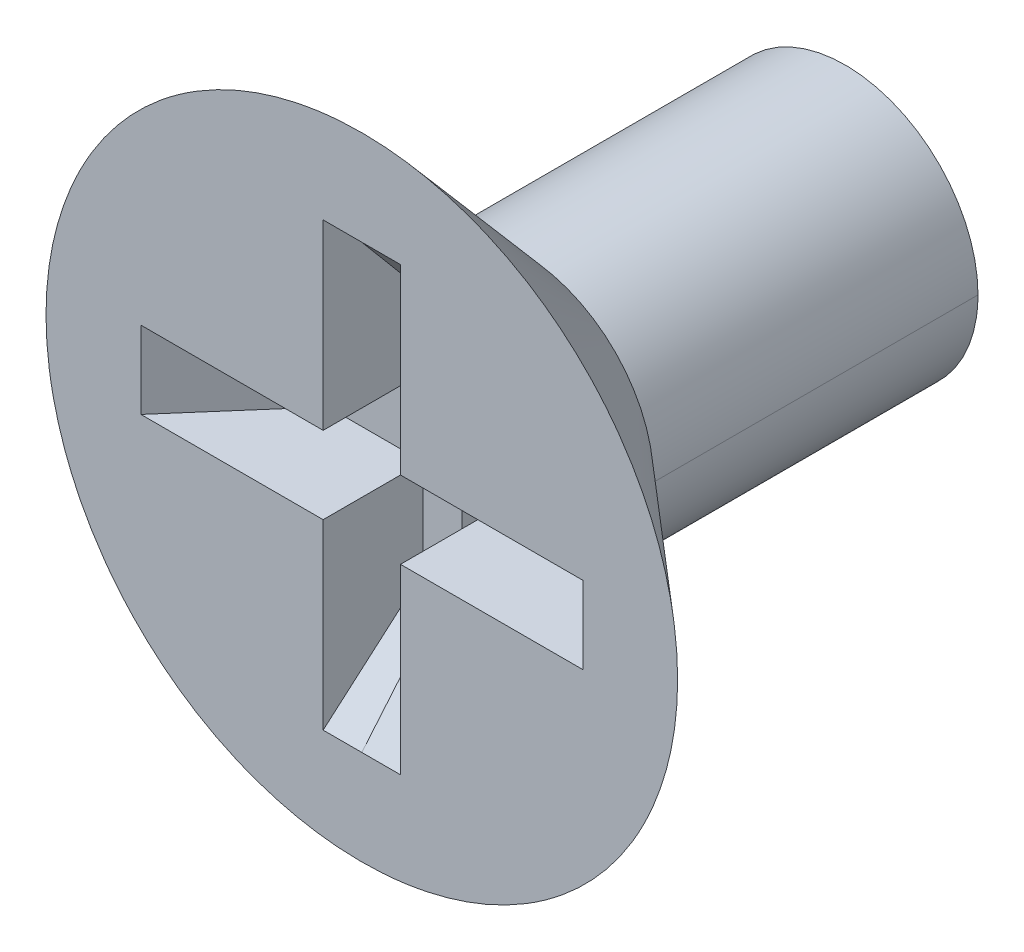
ISO-10303-21;
HEADER;
FILE_DESCRIPTION(('STEP AP214'),'2;1');
FILE_NAME('part.step','',(''),(''),'','','');
FILE_SCHEMA(('AUTOMOTIVE_DESIGN { 1 0 10303 214 1 1 1 1 }'));
ENDSEC;
DATA;
#1=APPLICATION_CONTEXT('core data for automotive mechanical design processes');
#2=APPLICATION_PROTOCOL_DEFINITION('international standard','automotive_design',2000,#1);
#3=PRODUCT_CONTEXT('',#1,'mechanical');
#4=PRODUCT('Part','Part','',(#3));
#5=PRODUCT_RELATED_PRODUCT_CATEGORY('part','',(#4));
#6=PRODUCT_DEFINITION_FORMATION('','',#4);
#7=PRODUCT_DEFINITION_CONTEXT('part definition',#1,'design');
#8=PRODUCT_DEFINITION('design','',#6,#7);
#9=PRODUCT_DEFINITION_SHAPE('','',#8);
#10=(LENGTH_UNIT() NAMED_UNIT(*) SI_UNIT(.MILLI.,.METRE.));
#11=(NAMED_UNIT(*) PLANE_ANGLE_UNIT() SI_UNIT($,.RADIAN.));
#12=(NAMED_UNIT(*) SI_UNIT($,.STERADIAN.) SOLID_ANGLE_UNIT());
#13=UNCERTAINTY_MEASURE_WITH_UNIT(LENGTH_MEASURE(1.E-05),#10,'distance_accuracy_value','');
#14=(GEOMETRIC_REPRESENTATION_CONTEXT(3) GLOBAL_UNCERTAINTY_ASSIGNED_CONTEXT((#13)) GLOBAL_UNIT_ASSIGNED_CONTEXT((#10,
#11,#12)) REPRESENTATION_CONTEXT('',''));
#15=CARTESIAN_POINT('',(0.,0.,0.));
#16=DIRECTION('',(0.,0.,1.));
#17=DIRECTION('',(1.,0.,0.));
#18=AXIS2_PLACEMENT_3D('',#15,#16,#17);
#19=CARTESIAN_POINT('',(0.,2.1766160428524,-0.984980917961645));
#20=DIRECTION('',(-1.,0.,0.));
#21=DIRECTION('',(0.,-1.,0.));
#22=AXIS2_PLACEMENT_3D('',#19,#20,#21);
#23=PLANE('',#22);
#24=CARTESIAN_POINT('',(0.,2.1766160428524,0.));
#25=CARTESIAN_POINT('',(0.,2.09835907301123,-0.0656653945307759));
#26=CARTESIAN_POINT('',(0.,2.02010210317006,-0.131330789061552));
#27=CARTESIAN_POINT('',(0.,1.86358816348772,-0.262661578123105));
#28=CARTESIAN_POINT('',(0.,1.78533119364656,-0.328326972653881));
#29=CARTESIAN_POINT('',(0.,1.62881725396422,-0.459657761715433));
#30=CARTESIAN_POINT('',(0.,1.55056028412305,-0.52532315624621));
#31=CARTESIAN_POINT('',(0.,1.39404634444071,-0.656653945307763));
#32=CARTESIAN_POINT('',(0.,1.31578937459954,-0.722319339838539));
#33=CARTESIAN_POINT('',(0.,1.15927543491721,-0.853650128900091));
#34=CARTESIAN_POINT('',(0.,1.08101846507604,-0.919315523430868));
#35=CARTESIAN_POINT('',(0.,1.00276149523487,-0.984980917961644));
#36=B_SPLINE_CURVE_WITH_KNOTS('',3,(#24,#25,#26,#27,#28,#29,#30,#31,#32,#33,#34,#35),
.UNSPECIFIED.,.F.,.F.,(4,2,2,2,2,4),(0.,0.2,0.4,0.6,0.8,1.),.UNSPECIFIED.);
#37=CARTESIAN_POINT('',(0.,2.1766160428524,0.));
#38=VERTEX_POINT('',#37);
#39=CARTESIAN_POINT('',(0.,1.00276149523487,-0.984980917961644));
#40=VERTEX_POINT('',#39);
#41=EDGE_CURVE('E29',#38,#40,#36,.T.);
#42=ORIENTED_EDGE('',*,*,#41,.F.);
#43=CARTESIAN_POINT('',(0.,2.1766160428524,0.));
#44=CARTESIAN_POINT('',(0.,2.11953398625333,-0.0656653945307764));
#45=CARTESIAN_POINT('',(0.,2.06245192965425,-0.131330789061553));
#46=CARTESIAN_POINT('',(0.,1.9482878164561,-0.262661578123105));
#47=CARTESIAN_POINT('',(0.,1.89120575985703,-0.328326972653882));
#48=CARTESIAN_POINT('',(0.,1.77704164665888,-0.459657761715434));
#49=CARTESIAN_POINT('',(0.,1.71995959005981,-0.525323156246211));
#50=CARTESIAN_POINT('',(0.,1.60579547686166,-0.656653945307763));
#51=CARTESIAN_POINT('',(0.,1.54871342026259,-0.72231933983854));
#52=CARTESIAN_POINT('',(0.,1.43454930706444,-0.853650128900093));
#53=CARTESIAN_POINT('',(0.,1.37746725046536,-0.919315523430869));
#54=CARTESIAN_POINT('',(0.,1.32038519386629,-0.984980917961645));
#55=B_SPLINE_CURVE_WITH_KNOTS('',3,(#43,#44,#45,#46,#47,#48,#49,#50,#51,#52,#53,#54),
.UNSPECIFIED.,.F.,.F.,(4,2,2,2,2,4),(0.,0.2,0.4,0.6,0.8,1.),.UNSPECIFIED.);
#56=CARTESIAN_POINT('',(0.,1.32038519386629,-0.984980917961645));
#57=VERTEX_POINT('',#56);
#58=EDGE_CURVE('E10',#38,#57,#55,.T.);
#59=ORIENTED_EDGE('',*,*,#58,.T.);
#60=CARTESIAN_POINT('',(0.,1.32038519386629,-0.984980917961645));
#61=CARTESIAN_POINT('',(0.,1.2992102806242,-0.984980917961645));
#62=CARTESIAN_POINT('',(0.,1.2780353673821,-0.984980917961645));
#63=CARTESIAN_POINT('',(0.,1.23568554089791,-0.984980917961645));
#64=CARTESIAN_POINT('',(0.,1.21451062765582,-0.984980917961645));
#65=CARTESIAN_POINT('',(0.,1.17216080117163,-0.984980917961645));
#66=CARTESIAN_POINT('',(0.,1.15098588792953,-0.984980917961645));
#67=CARTESIAN_POINT('',(0.,1.10863606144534,-0.984980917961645));
#68=CARTESIAN_POINT('',(0.,1.08746114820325,-0.984980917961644));
#69=CARTESIAN_POINT('',(0.,1.04511132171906,-0.984980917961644));
#70=CARTESIAN_POINT('',(0.,1.02393640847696,-0.984980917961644));
#71=CARTESIAN_POINT('',(0.,1.00276149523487,-0.984980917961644));
#72=B_SPLINE_CURVE_WITH_KNOTS('',3,(#60,#61,#62,#63,#64,#65,#66,#67,#68,#69,#70,#71),
.UNSPECIFIED.,.F.,.F.,(4,2,2,2,2,4),(0.,0.2,0.4,0.6,0.8,1.),.UNSPECIFIED.);
#73=EDGE_CURVE('E24',#57,#40,#72,.T.);
#74=ORIENTED_EDGE('',*,*,#73,.T.);
#75=EDGE_LOOP('',(#42,#59,#74));
#76=FACE_BOUND('',#75,.T.);
#77=ADVANCED_FACE('F15',(#76),#23,.T.);
#78=CARTESIAN_POINT('',(0.381,2.1766160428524,0.));
#79=DIRECTION('',(0.,-0.642787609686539,0.766044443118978));
#80=DIRECTION('',(-1.,0.,0.));
#81=AXIS2_PLACEMENT_3D('',#78,#79,#80);
#82=PLANE('',#81);
#83=CARTESIAN_POINT('',(0.381,2.1766160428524,0.));
#84=CARTESIAN_POINT('',(0.381,2.06414525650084,-0.0943741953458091));
#85=CARTESIAN_POINT('',(0.381,1.95167447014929,-0.188748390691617));
#86=CARTESIAN_POINT('',(0.381,1.72673289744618,-0.377496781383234));
#87=CARTESIAN_POINT('',(0.381,1.61426211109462,-0.471870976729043));
#88=CARTESIAN_POINT('',(0.381,1.38932053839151,-0.660619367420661));
#89=CARTESIAN_POINT('',(0.381,1.27684975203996,-0.754993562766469));
#90=CARTESIAN_POINT('',(0.381,1.05190817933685,-0.943741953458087));
#91=CARTESIAN_POINT('',(0.381,0.939437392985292,-1.0381161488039));
#92=CARTESIAN_POINT('',(0.381,0.714495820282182,-1.22686453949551));
#93=CARTESIAN_POINT('',(0.381,0.602025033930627,-1.32123873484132));
#94=CARTESIAN_POINT('',(0.381,0.489554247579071,-1.41561293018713));
#95=B_SPLINE_CURVE_WITH_KNOTS('',3,(#83,#84,#85,#86,#87,#88,#89,#90,#91,#92,#93,#94),
.UNSPECIFIED.,.F.,.F.,(4,2,2,2,2,4),(0.,0.2,0.4,0.6,0.8,1.),.UNSPECIFIED.);
#96=CARTESIAN_POINT('',(0.381,2.1766160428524,0.));
#97=VERTEX_POINT('',#96);
#98=CARTESIAN_POINT('',(0.381,0.489554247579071,-1.41561293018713));
#99=VERTEX_POINT('',#98);
#100=EDGE_CURVE('E506',#97,#99,#95,.T.);
#101=ORIENTED_EDGE('',*,*,#100,.F.);
#102=CARTESIAN_POINT('',(0.,2.1766160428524,0.));
#103=CARTESIAN_POINT('',(0.0254000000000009,2.1766160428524,0.));
#104=CARTESIAN_POINT('',(0.0507999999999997,2.1766160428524,0.));
#105=CARTESIAN_POINT('',(0.1016,2.1766160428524,0.));
#106=CARTESIAN_POINT('',(0.127,2.1766160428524,0.));
#107=CARTESIAN_POINT('',(0.1778,2.1766160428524,0.));
#108=CARTESIAN_POINT('',(0.2032,2.1766160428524,0.));
#109=CARTESIAN_POINT('',(0.254000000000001,2.1766160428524,0.));
#110=CARTESIAN_POINT('',(0.279399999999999,2.1766160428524,0.));
#111=CARTESIAN_POINT('',(0.3302,2.1766160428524,0.));
#112=CARTESIAN_POINT('',(0.3556,2.1766160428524,0.));
#113=CARTESIAN_POINT('',(0.381000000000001,2.1766160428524,0.));
#114=B_SPLINE_CURVE_WITH_KNOTS('',3,(#102,#103,#104,#105,#106,#107,#108,#109,#110,#111,#112,
#113),.UNSPECIFIED.,.F.,.F.,(4,2,2,2,2,4),(0.,0.2,0.4,0.6,0.8,1.),.UNSPECIFIED.);
#115=EDGE_CURVE('E474',#38,#97,#114,.T.);
#116=ORIENTED_EDGE('',*,*,#115,.F.);
#117=ORIENTED_EDGE('',*,*,#41,.T.);
#118=CARTESIAN_POINT('',(0.,1.00276149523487,-0.984980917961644));
#119=CARTESIAN_POINT('',(0.,0.968547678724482,-1.01368971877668));
#120=CARTESIAN_POINT('',(0.,0.934333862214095,-1.04239851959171));
#121=CARTESIAN_POINT('',(0.,0.865906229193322,-1.09981612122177));
#122=CARTESIAN_POINT('',(0.,0.831692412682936,-1.12852492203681));
#123=CARTESIAN_POINT('',(0.,0.763264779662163,-1.18594252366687));
#124=CARTESIAN_POINT('',(0.,0.729050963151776,-1.2146513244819));
#125=CARTESIAN_POINT('',(0.,0.660623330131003,-1.27206892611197));
#126=CARTESIAN_POINT('',(0.,0.626409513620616,-1.300777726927));
#127=CARTESIAN_POINT('',(0.,0.557981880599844,-1.35819532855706));
#128=CARTESIAN_POINT('',(0.,0.523768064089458,-1.3869041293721));
#129=CARTESIAN_POINT('',(0.,0.489554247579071,-1.41561293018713));
#130=B_SPLINE_CURVE_WITH_KNOTS('',3,(#118,#119,#120,#121,#122,#123,#124,#125,#126,#127,#128,
#129),.UNSPECIFIED.,.F.,.F.,(4,2,2,2,2,4),(0.,0.2,0.4,0.6,0.8,1.),.UNSPECIFIED.);
#131=CARTESIAN_POINT('',(0.,0.489554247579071,-1.41561293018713));
#132=VERTEX_POINT('',#131);
#133=EDGE_CURVE('E520',#40,#132,#130,.T.);
#134=ORIENTED_EDGE('',*,*,#133,.T.);
#135=CARTESIAN_POINT('',(0.,0.489554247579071,-1.41561293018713));
#136=CARTESIAN_POINT('',(0.0254,0.489554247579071,-1.41561293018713));
#137=CARTESIAN_POINT('',(0.0507999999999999,0.489554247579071,-1.41561293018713));
#138=CARTESIAN_POINT('',(0.1016,0.489554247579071,-1.41561293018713));
#139=CARTESIAN_POINT('',(0.127,0.489554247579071,-1.41561293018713));
#140=CARTESIAN_POINT('',(0.1778,0.489554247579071,-1.41561293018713));
#141=CARTESIAN_POINT('',(0.2032,0.489554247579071,-1.41561293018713));
#142=CARTESIAN_POINT('',(0.254,0.489554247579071,-1.41561293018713));
#143=CARTESIAN_POINT('',(0.2794,0.489554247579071,-1.41561293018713));
#144=CARTESIAN_POINT('',(0.3302,0.489554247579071,-1.41561293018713));
#145=CARTESIAN_POINT('',(0.3556,0.489554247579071,-1.41561293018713));
#146=CARTESIAN_POINT('',(0.381,0.489554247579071,-1.41561293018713));
#147=B_SPLINE_CURVE_WITH_KNOTS('',3,(#135,#136,#137,#138,#139,#140,#141,#142,#143,#144,#145,
#146),.UNSPECIFIED.,.F.,.F.,(4,2,2,2,2,4),(0.,0.2,0.4,0.6,0.8,1.),.UNSPECIFIED.);
#148=EDGE_CURVE('E518',#132,#99,#147,.T.);
#149=ORIENTED_EDGE('',*,*,#148,.T.);
#150=EDGE_LOOP('',(#101,#116,#117,#134,#149));
#151=FACE_BOUND('',#150,.T.);
#152=ADVANCED_FACE('F556',(#151),#82,.T.);
#153=CARTESIAN_POINT('',(-0.381,1.32038519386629,-0.984980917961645));
#154=DIRECTION('',(0.,-0.754709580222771,0.656059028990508));
#155=DIRECTION('',(1.,0.,0.));
#156=AXIS2_PLACEMENT_3D('',#153,#154,#155);
#157=PLANE('',#156);
#158=CARTESIAN_POINT('',(-0.381,1.32038519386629,-0.984980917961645));
#159=CARTESIAN_POINT('',(-0.381,1.37746725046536,-0.919315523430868));
#160=CARTESIAN_POINT('',(-0.381,1.43454930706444,-0.853650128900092));
#161=CARTESIAN_POINT('',(-0.381,1.54871342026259,-0.722319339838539));
#162=CARTESIAN_POINT('',(-0.381,1.60579547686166,-0.656653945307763));
#163=CARTESIAN_POINT('',(-0.381,1.71995959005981,-0.525323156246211));
#164=CARTESIAN_POINT('',(-0.381,1.77704164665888,-0.459657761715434));
#165=CARTESIAN_POINT('',(-0.381,1.89120575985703,-0.328326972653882));
#166=CARTESIAN_POINT('',(-0.381,1.9482878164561,-0.262661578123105));
#167=CARTESIAN_POINT('',(-0.381,2.06245192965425,-0.131330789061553));
#168=CARTESIAN_POINT('',(-0.381,2.11953398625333,-0.0656653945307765));
#169=CARTESIAN_POINT('',(-0.381,2.1766160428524,0.));
#170=B_SPLINE_CURVE_WITH_KNOTS('',3,(#158,#159,#160,#161,#162,#163,#164,#165,#166,#167,#168,
#169),.UNSPECIFIED.,.F.,.F.,(4,2,2,2,2,4),(0.,0.2,0.4,0.6,0.8,1.),.UNSPECIFIED.);
#171=CARTESIAN_POINT('',(-0.381,1.32038519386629,-0.984980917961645));
#172=VERTEX_POINT('',#171);
#173=CARTESIAN_POINT('',(-0.381,2.1766160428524,0.));
#174=VERTEX_POINT('',#173);
#175=EDGE_CURVE('E430',#172,#174,#170,.T.);
#176=ORIENTED_EDGE('',*,*,#175,.F.);
#177=CARTESIAN_POINT('',(0.,1.32038519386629,-0.984980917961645));
#178=CARTESIAN_POINT('',(-0.0254,1.32038519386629,-0.984980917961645));
#179=CARTESIAN_POINT('',(-0.0508,1.32038519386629,-0.984980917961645));
#180=CARTESIAN_POINT('',(-0.1016,1.32038519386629,-0.984980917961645));
#181=CARTESIAN_POINT('',(-0.127,1.32038519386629,-0.984980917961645));
#182=CARTESIAN_POINT('',(-0.1778,1.32038519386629,-0.984980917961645));
#183=CARTESIAN_POINT('',(-0.2032,1.32038519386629,-0.984980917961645));
#184=CARTESIAN_POINT('',(-0.254,1.32038519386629,-0.984980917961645));
#185=CARTESIAN_POINT('',(-0.2794,1.32038519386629,-0.984980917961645));
#186=CARTESIAN_POINT('',(-0.3302,1.32038519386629,-0.984980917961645));
#187=CARTESIAN_POINT('',(-0.3556,1.32038519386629,-0.984980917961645));
#188=CARTESIAN_POINT('',(-0.381,1.32038519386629,-0.984980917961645));
#189=B_SPLINE_CURVE_WITH_KNOTS('',3,(#177,#178,#179,#180,#181,#182,#183,#184,#185,#186,#187,
#188),.UNSPECIFIED.,.F.,.F.,(4,2,2,2,2,4),(0.,0.2,0.4,0.6,0.8,1.),.UNSPECIFIED.);
#190=EDGE_CURVE('E511',#57,#172,#189,.T.);
#191=ORIENTED_EDGE('',*,*,#190,.F.);
#192=ORIENTED_EDGE('',*,*,#58,.F.);
#193=CARTESIAN_POINT('',(-0.381,2.1766160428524,0.));
#194=CARTESIAN_POINT('',(-0.355599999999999,2.1766160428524,0.));
#195=CARTESIAN_POINT('',(-0.330199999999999,2.1766160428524,0.));
#196=CARTESIAN_POINT('',(-0.279399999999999,2.1766160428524,0.));
#197=CARTESIAN_POINT('',(-0.254,2.1766160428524,0.));
#198=CARTESIAN_POINT('',(-0.2032,2.1766160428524,0.));
#199=CARTESIAN_POINT('',(-0.1778,2.1766160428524,0.));
#200=CARTESIAN_POINT('',(-0.127,2.1766160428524,0.));
#201=CARTESIAN_POINT('',(-0.1016,2.1766160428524,0.));
#202=CARTESIAN_POINT('',(-0.0508000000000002,2.1766160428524,0.));
#203=CARTESIAN_POINT('',(-0.0254000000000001,2.1766160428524,0.));
#204=CARTESIAN_POINT('',(0.,2.1766160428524,0.));
#205=B_SPLINE_CURVE_WITH_KNOTS('',3,(#193,#194,#195,#196,#197,#198,#199,#200,#201,#202,#203,
#204),.UNSPECIFIED.,.F.,.F.,(4,2,2,2,2,4),(0.,0.2,0.4,0.6,0.8,1.),.UNSPECIFIED.);
#206=EDGE_CURVE('E478',#174,#38,#205,.T.);
#207=ORIENTED_EDGE('',*,*,#206,.F.);
#208=EDGE_LOOP('',(#176,#191,#192,#207));
#209=FACE_BOUND('',#208,.T.);
#210=ADVANCED_FACE('F565',(#209),#157,.T.);
#211=CARTESIAN_POINT('',(0.,-1.32038519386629,-0.984980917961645));
#212=DIRECTION('',(0.,0.,1.));
#213=DIRECTION('',(0.,1.,0.));
#214=AXIS2_PLACEMENT_3D('',#211,#212,#213);
#215=PLANE('',#214);
#216=CARTESIAN_POINT('',(-1.32038519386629,0.381,-0.984980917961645));
#217=CARTESIAN_POINT('',(-1.2577595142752,0.381,-0.984980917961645));
#218=CARTESIAN_POINT('',(-1.19513383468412,0.381,-0.984980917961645));
#219=CARTESIAN_POINT('',(-1.06988247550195,0.381,-0.984980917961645));
#220=CARTESIAN_POINT('',(-1.00725679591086,0.381,-0.984980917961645));
#221=CARTESIAN_POINT('',(-0.882005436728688,0.381,-0.984980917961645));
#222=CARTESIAN_POINT('',(-0.819379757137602,0.381,-0.984980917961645));
#223=CARTESIAN_POINT('',(-0.69412839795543,0.381,-0.984980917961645));
#224=CARTESIAN_POINT('',(-0.631502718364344,0.381,-0.984980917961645));
#225=CARTESIAN_POINT('',(-0.506251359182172,0.381,-0.984980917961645));
#226=CARTESIAN_POINT('',(-0.443625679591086,0.381,-0.984980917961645));
#227=CARTESIAN_POINT('',(-0.381,0.381,-0.984980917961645));
#228=B_SPLINE_CURVE_WITH_KNOTS('',3,(#216,#217,#218,#219,#220,#221,#222,#223,#224,#225,#226,
#227),.UNSPECIFIED.,.F.,.F.,(4,2,2,2,2,4),(0.,0.2,0.4,0.6,0.8,1.),.UNSPECIFIED.);
#229=CARTESIAN_POINT('',(-1.32038519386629,0.381,-0.984980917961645));
#230=VERTEX_POINT('',#229);
#231=CARTESIAN_POINT('',(-0.381,0.381,-0.984980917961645));
#232=VERTEX_POINT('',#231);
#233=EDGE_CURVE('E417',#230,#232,#228,.T.);
#234=ORIENTED_EDGE('',*,*,#233,.F.);
#235=CARTESIAN_POINT('',(-1.32038519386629,0.381,-0.984980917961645));
#236=CARTESIAN_POINT('',(-1.32038519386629,0.3302,-0.984980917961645));
#237=CARTESIAN_POINT('',(-1.32038519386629,0.279400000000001,-0.984980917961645));
#238=CARTESIAN_POINT('',(-1.32038519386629,0.177800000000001,-0.984980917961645));
#239=CARTESIAN_POINT('',(-1.32038519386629,0.127000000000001,-0.984980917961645));
#240=CARTESIAN_POINT('',(-1.32038519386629,0.0254000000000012,-0.984980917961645));
#241=CARTESIAN_POINT('',(-1.32038519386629,-0.0254000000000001,-0.984980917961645));
#242=CARTESIAN_POINT('',(-1.32038519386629,-0.127,-0.984980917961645));
#243=CARTESIAN_POINT('',(-1.32038519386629,-0.1778,-0.984980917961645));
#244=CARTESIAN_POINT('',(-1.32038519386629,-0.2794,-0.984980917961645));
#245=CARTESIAN_POINT('',(-1.32038519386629,-0.3302,-0.984980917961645));
#246=CARTESIAN_POINT('',(-1.32038519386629,-0.381,-0.984980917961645));
#247=B_SPLINE_CURVE_WITH_KNOTS('',3,(#235,#236,#237,#238,#239,#240,#241,#242,#243,#244,#245,
#246),.UNSPECIFIED.,.F.,.F.,(4,2,2,2,2,4),(0.,0.2,0.4,0.6,0.8,1.),.UNSPECIFIED.);
#248=CARTESIAN_POINT('',(-1.32038519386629,-0.381,-0.984980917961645));
#249=VERTEX_POINT('',#248);
#250=EDGE_CURVE('E514',#230,#249,#247,.T.);
#251=ORIENTED_EDGE('',*,*,#250,.T.);
#252=CARTESIAN_POINT('',(-0.381,-0.381,-0.984980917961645));
#253=CARTESIAN_POINT('',(-0.443625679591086,-0.381,-0.984980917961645));
#254=CARTESIAN_POINT('',(-0.506251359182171,-0.381,-0.984980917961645));
#255=CARTESIAN_POINT('',(-0.631502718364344,-0.381,-0.984980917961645));
#256=CARTESIAN_POINT('',(-0.69412839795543,-0.381,-0.984980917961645));
#257=CARTESIAN_POINT('',(-0.819379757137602,-0.381,-0.984980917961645));
#258=CARTESIAN_POINT('',(-0.882005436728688,-0.381,-0.984980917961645));
#259=CARTESIAN_POINT('',(-1.00725679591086,-0.381,-0.984980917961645));
#260=CARTESIAN_POINT('',(-1.06988247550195,-0.381,-0.984980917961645));
#261=CARTESIAN_POINT('',(-1.19513383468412,-0.381,-0.984980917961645));
#262=CARTESIAN_POINT('',(-1.2577595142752,-0.381,-0.984980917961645));
#263=CARTESIAN_POINT('',(-1.32038519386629,-0.381,-0.984980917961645));
#264=B_SPLINE_CURVE_WITH_KNOTS('',3,(#252,#253,#254,#255,#256,#257,#258,#259,#260,#261,#262,
#263),.UNSPECIFIED.,.F.,.F.,(4,2,2,2,2,4),(0.,0.2,0.4,0.6,0.8,1.),.UNSPECIFIED.);
#265=CARTESIAN_POINT('',(-0.381,-0.381,-0.984980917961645));
#266=VERTEX_POINT('',#265);
#267=EDGE_CURVE('E408',#266,#249,#264,.T.);
#268=ORIENTED_EDGE('',*,*,#267,.F.);
#269=CARTESIAN_POINT('',(-0.381,-1.32038519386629,-0.984980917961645));
#270=CARTESIAN_POINT('',(-0.381,-1.2577595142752,-0.984980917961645));
#271=CARTESIAN_POINT('',(-0.381,-1.19513383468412,-0.984980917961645));
#272=CARTESIAN_POINT('',(-0.381,-1.06988247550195,-0.984980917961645));
#273=CARTESIAN_POINT('',(-0.381,-1.00725679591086,-0.984980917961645));
#274=CARTESIAN_POINT('',(-0.381,-0.882005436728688,-0.984980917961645));
#275=CARTESIAN_POINT('',(-0.381,-0.819379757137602,-0.984980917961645));
#276=CARTESIAN_POINT('',(-0.381,-0.69412839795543,-0.984980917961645));
#277=CARTESIAN_POINT('',(-0.381,-0.631502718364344,-0.984980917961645));
#278=CARTESIAN_POINT('',(-0.381,-0.506251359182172,-0.984980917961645));
#279=CARTESIAN_POINT('',(-0.381,-0.443625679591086,-0.984980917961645));
#280=CARTESIAN_POINT('',(-0.381,-0.381,-0.984980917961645));
#281=B_SPLINE_CURVE_WITH_KNOTS('',3,(#269,#270,#271,#272,#273,#274,#275,#276,#277,#278,#279,
#280),.UNSPECIFIED.,.F.,.F.,(4,2,2,2,2,4),(0.,0.2,0.4,0.6,0.8,1.),.UNSPECIFIED.);
#282=CARTESIAN_POINT('',(-0.381,-1.32038519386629,-0.984980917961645));
#283=VERTEX_POINT('',#282);
#284=EDGE_CURVE('E394',#283,#266,#281,.T.);
#285=ORIENTED_EDGE('',*,*,#284,.F.);
#286=CARTESIAN_POINT('',(0.,-1.32038519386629,-0.984980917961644));
#287=CARTESIAN_POINT('',(-0.0254,-1.32038519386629,-0.984980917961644));
#288=CARTESIAN_POINT('',(-0.0508,-1.32038519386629,-0.984980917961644));
#289=CARTESIAN_POINT('',(-0.1016,-1.32038519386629,-0.984980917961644));
#290=CARTESIAN_POINT('',(-0.127,-1.32038519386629,-0.984980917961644));
#291=CARTESIAN_POINT('',(-0.1778,-1.32038519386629,-0.984980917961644));
#292=CARTESIAN_POINT('',(-0.2032,-1.32038519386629,-0.984980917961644));
#293=CARTESIAN_POINT('',(-0.254,-1.32038519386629,-0.984980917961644));
#294=CARTESIAN_POINT('',(-0.2794,-1.32038519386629,-0.984980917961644));
#295=CARTESIAN_POINT('',(-0.3302,-1.32038519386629,-0.984980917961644));
#296=CARTESIAN_POINT('',(-0.3556,-1.32038519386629,-0.984980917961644));
#297=CARTESIAN_POINT('',(-0.381,-1.32038519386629,-0.984980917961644));
#298=B_SPLINE_CURVE_WITH_KNOTS('',3,(#286,#287,#288,#289,#290,#291,#292,#293,#294,#295,#296,
#297),.UNSPECIFIED.,.F.,.F.,(4,2,2,2,2,4),(0.,0.2,0.4,0.6,0.8,1.),.UNSPECIFIED.);
#299=CARTESIAN_POINT('',(0.,-1.32038519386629,-0.984980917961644));
#300=VERTEX_POINT('',#299);
#301=EDGE_CURVE('E391',#300,#283,#298,.T.);
#302=ORIENTED_EDGE('',*,*,#301,.F.);
#303=CARTESIAN_POINT('',(0.,-1.00276149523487,-0.984980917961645));
#304=CARTESIAN_POINT('',(0.,-1.02393640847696,-0.984980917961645));
#305=CARTESIAN_POINT('',(0.,-1.04511132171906,-0.984980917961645));
#306=CARTESIAN_POINT('',(0.,-1.08746114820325,-0.984980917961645));
#307=CARTESIAN_POINT('',(0.,-1.10863606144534,-0.984980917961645));
#308=CARTESIAN_POINT('',(0.,-1.15098588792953,-0.984980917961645));
#309=CARTESIAN_POINT('',(0.,-1.17216080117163,-0.984980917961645));
#310=CARTESIAN_POINT('',(0.,-1.21451062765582,-0.984980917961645));
#311=CARTESIAN_POINT('',(0.,-1.23568554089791,-0.984980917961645));
#312=CARTESIAN_POINT('',(0.,-1.2780353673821,-0.984980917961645));
#313=CARTESIAN_POINT('',(0.,-1.2992102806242,-0.984980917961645));
#314=CARTESIAN_POINT('',(0.,-1.32038519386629,-0.984980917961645));
#315=B_SPLINE_CURVE_WITH_KNOTS('',3,(#303,#304,#305,#306,#307,#308,#309,#310,#311,#312,#313,
#314),.UNSPECIFIED.,.F.,.F.,(4,2,2,2,2,4),(0.,0.2,0.4,0.600000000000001,0.8,1.),.UNSPECIFIED.);
#316=CARTESIAN_POINT('',(0.,-1.00276149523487,-0.984980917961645));
#317=VERTEX_POINT('',#316);
#318=EDGE_CURVE('E386',#317,#300,#315,.T.);
#319=ORIENTED_EDGE('',*,*,#318,.F.);
#320=CARTESIAN_POINT('',(0.,1.00276149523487,-0.984980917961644));
#321=CARTESIAN_POINT('',(0.,0.869059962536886,-0.984980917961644));
#322=CARTESIAN_POINT('',(0.,0.735358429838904,-0.984980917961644));
#323=CARTESIAN_POINT('',(0.,0.467955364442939,-0.984980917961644));
#324=CARTESIAN_POINT('',(0.,0.334253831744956,-0.984980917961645));
#325=CARTESIAN_POINT('',(0.,0.066850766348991,-0.984980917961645));
#326=CARTESIAN_POINT('',(0.,-0.0668507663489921,-0.984980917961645));
#327=CARTESIAN_POINT('',(0.,-0.334253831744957,-0.984980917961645));
#328=CARTESIAN_POINT('',(0.,-0.46795536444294,-0.984980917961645));
#329=CARTESIAN_POINT('',(0.,-0.735358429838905,-0.984980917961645));
#330=CARTESIAN_POINT('',(0.,-0.869059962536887,-0.984980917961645));
#331=CARTESIAN_POINT('',(0.,-1.00276149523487,-0.984980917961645));
#332=B_SPLINE_CURVE_WITH_KNOTS('',3,(#320,#321,#322,#323,#324,#325,#326,#327,#328,#329,#330,
#331),.UNSPECIFIED.,.F.,.F.,(4,2,2,2,2,4),(0.,0.2,0.4,0.6,0.8,1.),.UNSPECIFIED.);
#333=EDGE_CURVE('E448',#40,#317,#332,.T.);
#334=ORIENTED_EDGE('',*,*,#333,.F.);
#335=ORIENTED_EDGE('',*,*,#73,.F.);
#336=ORIENTED_EDGE('',*,*,#190,.T.);
#337=CARTESIAN_POINT('',(-0.381,0.381,-0.984980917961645));
#338=CARTESIAN_POINT('',(-0.381,0.443625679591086,-0.984980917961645));
#339=CARTESIAN_POINT('',(-0.381,0.506251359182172,-0.984980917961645));
#340=CARTESIAN_POINT('',(-0.381,0.631502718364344,-0.984980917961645));
#341=CARTESIAN_POINT('',(-0.381,0.69412839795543,-0.984980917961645));
#342=CARTESIAN_POINT('',(-0.381,0.819379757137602,-0.984980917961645));
#343=CARTESIAN_POINT('',(-0.381,0.882005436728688,-0.984980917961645));
#344=CARTESIAN_POINT('',(-0.381,1.00725679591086,-0.984980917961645));
#345=CARTESIAN_POINT('',(-0.381,1.06988247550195,-0.984980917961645));
#346=CARTESIAN_POINT('',(-0.381,1.19513383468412,-0.984980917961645));
#347=CARTESIAN_POINT('',(-0.381,1.2577595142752,-0.984980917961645));
#348=CARTESIAN_POINT('',(-0.381,1.32038519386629,-0.984980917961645));
#349=B_SPLINE_CURVE_WITH_KNOTS('',3,(#337,#338,#339,#340,#341,#342,#343,#344,#345,#346,#347,
#348),.UNSPECIFIED.,.F.,.F.,(4,2,2,2,2,4),(0.,0.2,0.4,0.6,0.8,1.),.UNSPECIFIED.);
#350=EDGE_CURVE('E434',#232,#172,#349,.T.);
#351=ORIENTED_EDGE('',*,*,#350,.F.);
#352=EDGE_LOOP('',(#234,#251,#268,#285,#302,#319,#334,#335,#336,#351));
#353=FACE_BOUND('',#352,.T.);
#354=ADVANCED_FACE('F645',(#353),#215,.T.);
#355=CARTESIAN_POINT('',(0.381,2.1766160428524,-1.41561293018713));
#356=DIRECTION('',(-1.,0.,0.));
#357=DIRECTION('',(0.,-1.,0.));
#358=AXIS2_PLACEMENT_3D('',#355,#356,#357);
#359=PLANE('',#358);
#360=CARTESIAN_POINT('',(0.381,0.381,-0.984980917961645));
#361=CARTESIAN_POINT('',(0.381,0.381,-0.919315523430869));
#362=CARTESIAN_POINT('',(0.381,0.380999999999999,-0.853650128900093));
#363=CARTESIAN_POINT('',(0.381,0.380999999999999,-0.72231933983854));
#364=CARTESIAN_POINT('',(0.381,0.381,-0.656653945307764));
#365=CARTESIAN_POINT('',(0.381,0.381,-0.525323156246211));
#366=CARTESIAN_POINT('',(0.381,0.381,-0.459657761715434));
#367=CARTESIAN_POINT('',(0.381,0.381,-0.328326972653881));
#368=CARTESIAN_POINT('',(0.381,0.381,-0.262661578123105));
#369=CARTESIAN_POINT('',(0.381,0.381,-0.131330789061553));
#370=CARTESIAN_POINT('',(0.381,0.381,-0.065665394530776));
#371=CARTESIAN_POINT('',(0.381,0.381,0.));
#372=B_SPLINE_CURVE_WITH_KNOTS('',3,(#360,#361,#362,#363,#364,#365,#366,#367,#368,#369,#370,
#371),.UNSPECIFIED.,.F.,.F.,(4,2,2,2,2,4),(0.,0.2,0.4,0.6,0.8,1.),.UNSPECIFIED.);
#373=CARTESIAN_POINT('',(0.381,0.381,-0.984980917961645));
#374=VERTEX_POINT('',#373);
#375=CARTESIAN_POINT('',(0.381,0.381,0.));
#376=VERTEX_POINT('',#375);
#377=EDGE_CURVE('E509',#374,#376,#372,.T.);
#378=ORIENTED_EDGE('',*,*,#377,.T.);
#379=CARTESIAN_POINT('',(0.381000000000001,2.1766160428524,0.));
#380=CARTESIAN_POINT('',(0.381000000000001,2.05690830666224,0.));
#381=CARTESIAN_POINT('',(0.381000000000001,1.93720057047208,0.));
#382=CARTESIAN_POINT('',(0.381000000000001,1.69778509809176,0.));
#383=CARTESIAN_POINT('',(0.381000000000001,1.5780773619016,0.));
#384=CARTESIAN_POINT('',(0.381000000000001,1.33866188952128,0.));
#385=CARTESIAN_POINT('',(0.381000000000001,1.21895415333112,0.));
#386=CARTESIAN_POINT('',(0.381000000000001,0.9795386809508,0.));
#387=CARTESIAN_POINT('',(0.381000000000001,0.859830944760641,0.));
#388=CARTESIAN_POINT('',(0.381000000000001,0.62041547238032,0.));
#389=CARTESIAN_POINT('',(0.381000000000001,0.50070773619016,0.));
#390=CARTESIAN_POINT('',(0.381000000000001,0.381,0.));
#391=B_SPLINE_CURVE_WITH_KNOTS('',3,(#379,#380,#381,#382,#383,#384,#385,#386,#387,#388,#389,
#390),.UNSPECIFIED.,.F.,.F.,(4,2,2,2,2,4),(0.,0.2,0.4,0.6,0.8,1.),.UNSPECIFIED.);
#392=EDGE_CURVE('E471',#97,#376,#391,.T.);
#393=ORIENTED_EDGE('',*,*,#392,.F.);
#394=ORIENTED_EDGE('',*,*,#100,.T.);
#395=CARTESIAN_POINT('',(0.381,0.489554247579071,-1.41561293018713));
#396=CARTESIAN_POINT('',(0.381,0.424280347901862,-1.41561293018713));
#397=CARTESIAN_POINT('',(0.381,0.359006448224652,-1.41561293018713));
#398=CARTESIAN_POINT('',(0.381,0.228458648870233,-1.41561293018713));
#399=CARTESIAN_POINT('',(0.381,0.163184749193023,-1.41561293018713));
#400=CARTESIAN_POINT('',(0.381,0.0326369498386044,-1.41561293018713));
#401=CARTESIAN_POINT('',(0.381,-0.0326369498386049,-1.41561293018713));
#402=CARTESIAN_POINT('',(0.381,-0.163184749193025,-1.41561293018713));
#403=CARTESIAN_POINT('',(0.381,-0.228458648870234,-1.41561293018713));
#404=CARTESIAN_POINT('',(0.381,-0.359006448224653,-1.41561293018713));
#405=CARTESIAN_POINT('',(0.381,-0.424280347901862,-1.41561293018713));
#406=CARTESIAN_POINT('',(0.381,-0.489554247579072,-1.41561293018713));
#407=B_SPLINE_CURVE_WITH_KNOTS('',3,(#395,#396,#397,#398,#399,#400,#401,#402,#403,#404,#405,
#406),.UNSPECIFIED.,.F.,.F.,(4,2,2,2,2,4),(0.,0.2,0.4,0.6,0.8,1.),.UNSPECIFIED.);
#408=CARTESIAN_POINT('',(0.381,-0.489554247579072,-1.41561293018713));
#409=VERTEX_POINT('',#408);
#410=EDGE_CURVE('E504',#99,#409,#407,.T.);
#411=ORIENTED_EDGE('',*,*,#410,.T.);
#412=CARTESIAN_POINT('',(0.381,-0.489554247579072,-1.41561293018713));
#413=CARTESIAN_POINT('',(0.381,-0.602025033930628,-1.32123873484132));
#414=CARTESIAN_POINT('',(0.381,-0.714495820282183,-1.22686453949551));
#415=CARTESIAN_POINT('',(0.381,-0.939437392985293,-1.0381161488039));
#416=CARTESIAN_POINT('',(0.381,-1.05190817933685,-0.943741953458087));
#417=CARTESIAN_POINT('',(0.381,-1.27684975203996,-0.754993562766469));
#418=CARTESIAN_POINT('',(0.381,-1.38932053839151,-0.660619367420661));
#419=CARTESIAN_POINT('',(0.381,-1.61426211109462,-0.471870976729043));
#420=CARTESIAN_POINT('',(0.381,-1.72673289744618,-0.377496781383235));
#421=CARTESIAN_POINT('',(0.381,-1.95167447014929,-0.188748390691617));
#422=CARTESIAN_POINT('',(0.381,-2.06414525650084,-0.0943741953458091));
#423=CARTESIAN_POINT('',(0.381,-2.1766160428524,0.));
#424=B_SPLINE_CURVE_WITH_KNOTS('',3,(#412,#413,#414,#415,#416,#417,#418,#419,#420,#421,#422,
#423),.UNSPECIFIED.,.F.,.F.,(4,2,2,2,2,4),(0.,0.2,0.4,0.6,0.8,1.),.UNSPECIFIED.);
#425=CARTESIAN_POINT('',(0.381,-2.1766160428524,0.));
#426=VERTEX_POINT('',#425);
#427=EDGE_CURVE('E502',#409,#426,#424,.T.);
#428=ORIENTED_EDGE('',*,*,#427,.T.);
#429=CARTESIAN_POINT('',(0.381000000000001,-0.380999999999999,0.));
#430=CARTESIAN_POINT('',(0.381000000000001,-0.50070773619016,0.));
#431=CARTESIAN_POINT('',(0.381000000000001,-0.620415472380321,0.));
#432=CARTESIAN_POINT('',(0.381000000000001,-0.859830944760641,0.));
#433=CARTESIAN_POINT('',(0.381000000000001,-0.9795386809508,0.));
#434=CARTESIAN_POINT('',(0.381000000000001,-1.21895415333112,0.));
#435=CARTESIAN_POINT('',(0.381000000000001,-1.33866188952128,0.));
#436=CARTESIAN_POINT('',(0.381000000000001,-1.5780773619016,0.));
#437=CARTESIAN_POINT('',(0.381000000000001,-1.69778509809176,0.));
#438=CARTESIAN_POINT('',(0.381000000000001,-1.93720057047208,0.));
#439=CARTESIAN_POINT('',(0.381000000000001,-2.05690830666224,0.));
#440=CARTESIAN_POINT('',(0.381000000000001,-2.1766160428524,0.));
#441=B_SPLINE_CURVE_WITH_KNOTS('',3,(#429,#430,#431,#432,#433,#434,#435,#436,#437,#438,#439,
#440),.UNSPECIFIED.,.F.,.F.,(4,2,2,2,2,4),(0.,0.2,0.4,0.6,0.8,1.),.UNSPECIFIED.);
#442=CARTESIAN_POINT('',(0.381,-0.381,0.));
#443=VERTEX_POINT('',#442);
#444=EDGE_CURVE('E462',#443,#426,#441,.T.);
#445=ORIENTED_EDGE('',*,*,#444,.F.);
#446=CARTESIAN_POINT('',(0.381,-0.381,0.));
#447=CARTESIAN_POINT('',(0.381,-0.381,-0.065665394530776));
#448=CARTESIAN_POINT('',(0.381,-0.381,-0.131330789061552));
#449=CARTESIAN_POINT('',(0.381,-0.381,-0.262661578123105));
#450=CARTESIAN_POINT('',(0.381,-0.381,-0.328326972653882));
#451=CARTESIAN_POINT('',(0.381,-0.381,-0.459657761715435));
#452=CARTESIAN_POINT('',(0.381,-0.381,-0.525323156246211));
#453=CARTESIAN_POINT('',(0.381,-0.381,-0.656653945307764));
#454=CARTESIAN_POINT('',(0.381,-0.381,-0.72231933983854));
#455=CARTESIAN_POINT('',(0.381,-0.381,-0.853650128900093));
#456=CARTESIAN_POINT('',(0.381,-0.381,-0.919315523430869));
#457=CARTESIAN_POINT('',(0.381,-0.381,-0.984980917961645));
#458=B_SPLINE_CURVE_WITH_KNOTS('',3,(#446,#447,#448,#449,#450,#451,#452,#453,#454,#455,#456,
#457),.UNSPECIFIED.,.F.,.F.,(4,2,2,2,2,4),(0.,0.2,0.4,0.6,0.8,1.),.UNSPECIFIED.);
#459=CARTESIAN_POINT('',(0.381,-0.381,-0.984980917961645));
#460=VERTEX_POINT('',#459);
#461=EDGE_CURVE('E499',#443,#460,#458,.T.);
#462=ORIENTED_EDGE('',*,*,#461,.T.);
#463=CARTESIAN_POINT('',(0.381,-0.381,-0.984980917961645));
#464=CARTESIAN_POINT('',(0.381,-0.3302,-0.984980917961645));
#465=CARTESIAN_POINT('',(0.381,-0.279400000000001,-0.984980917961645));
#466=CARTESIAN_POINT('',(0.381,-0.1778,-0.984980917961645));
#467=CARTESIAN_POINT('',(0.381,-0.127,-0.984980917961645));
#468=CARTESIAN_POINT('',(0.381,-0.0254000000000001,-0.984980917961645));
#469=CARTESIAN_POINT('',(0.381,0.0254000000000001,-0.984980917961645));
#470=CARTESIAN_POINT('',(0.381,0.127,-0.984980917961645));
#471=CARTESIAN_POINT('',(0.381,0.177799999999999,-0.984980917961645));
#472=CARTESIAN_POINT('',(0.381,0.2794,-0.984980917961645));
#473=CARTESIAN_POINT('',(0.381,0.3302,-0.984980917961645));
#474=CARTESIAN_POINT('',(0.381,0.381,-0.984980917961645));
#475=B_SPLINE_CURVE_WITH_KNOTS('',3,(#463,#464,#465,#466,#467,#468,#469,#470,#471,#472,#473,
#474),.UNSPECIFIED.,.F.,.F.,(4,2,2,2,2,4),(0.,0.2,0.4,0.6,0.8,1.),.UNSPECIFIED.);
#476=EDGE_CURVE('E497',#460,#374,#475,.T.);
#477=ORIENTED_EDGE('',*,*,#476,.T.);
#478=EDGE_LOOP('',(#378,#393,#394,#411,#428,#445,#462,#477));
#479=FACE_BOUND('',#478,.T.);
#480=ADVANCED_FACE('F654',(#479),#359,.T.);
#481=CARTESIAN_POINT('',(-3.1115,-3.19933097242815,0.));
#482=DIRECTION('',(0.,0.,1.));
#483=DIRECTION('',(1.,0.,0.));
#484=AXIS2_PLACEMENT_3D('',#481,#482,#483);
#485=PLANE('',#484);
#486=CARTESIAN_POINT('',(3.1115,0.,0.));
#487=CARTESIAN_POINT('',(3.1113093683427,0.469205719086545,0.));
#488=CARTESIAN_POINT('',(3.00364993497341,0.93811114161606,0.));
#489=CARTESIAN_POINT('',(2.5523624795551,1.86648886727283,0.));
#490=CARTESIAN_POINT('',(2.16582242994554,2.30367772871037,0.));
#491=CARTESIAN_POINT('',(1.25622654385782,2.89404177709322,0.));
#492=CARTESIAN_POINT('',(0.746539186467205,3.06532305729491,0.));
#493=CARTESIAN_POINT('',(-0.272573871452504,3.13973198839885,0.));
#494=CARTESIAN_POINT('',(-0.78028580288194,3.05349778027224,0.));
#495=CARTESIAN_POINT('',(-1.68001828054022,2.6626654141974,0.));
#496=CARTESIAN_POINT('',(-2.07522357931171,2.36753339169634,0.));
#497=CARTESIAN_POINT('',(-2.75453638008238,1.55769413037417,0.));
#498=CARTESIAN_POINT('',(-2.99859922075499,1.01107904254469,0.));
#499=CARTESIAN_POINT('',(-3.10096776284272,0.294526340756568,0.));
#500=CARTESIAN_POINT('',(-3.11144016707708,0.14726803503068,0.));
#501=CARTESIAN_POINT('',(-3.1115,0.,0.));
#502=B_SPLINE_CURVE_WITH_KNOTS('',3,(#486,#487,#488,#489,#490,#491,#492,#493,#494,#495,#496,
#497,#498,#499,#500,#501),.UNSPECIFIED.,.F.,.F.,(4,2,2,2,2,2,2,4),(0.,0.144,0.3168,0.4768,
0.6304,0.777856,0.9548032,1.),.UNSPECIFIED.);
#503=CARTESIAN_POINT('',(3.1115,0.,0.));
#504=VERTEX_POINT('',#503);
#505=CARTESIAN_POINT('',(-3.1115,0.,0.));
#506=VERTEX_POINT('',#505);
#507=EDGE_CURVE('E494',#504,#506,#502,.T.);
#508=ORIENTED_EDGE('',*,*,#507,.T.);
#509=CARTESIAN_POINT('',(-3.1115,0.,0.));
#510=CARTESIAN_POINT('',(-3.1113093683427,-0.469205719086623,0.));
#511=CARTESIAN_POINT('',(-3.00364993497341,-0.938111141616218,0.));
#512=CARTESIAN_POINT('',(-2.5523624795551,-1.86648886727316,0.));
#513=CARTESIAN_POINT('',(-2.16582242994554,-2.3036777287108,0.));
#514=CARTESIAN_POINT('',(-1.25622654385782,-2.89404177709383,0.));
#515=CARTESIAN_POINT('',(-0.746539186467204,-3.06532305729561,0.));
#516=CARTESIAN_POINT('',(0.272573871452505,-3.13973198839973,0.));
#517=CARTESIAN_POINT('',(0.780285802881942,-3.05349778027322,0.));
#518=CARTESIAN_POINT('',(1.68001828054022,-2.66266541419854,0.));
#519=CARTESIAN_POINT('',(2.07522357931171,-2.36753339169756,0.));
#520=CARTESIAN_POINT('',(2.75453638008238,-1.55769413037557,0.));
#521=CARTESIAN_POINT('',(2.99859922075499,-1.01107904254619,0.));
#522=CARTESIAN_POINT('',(3.10096776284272,-0.294526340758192,0.));
#523=CARTESIAN_POINT('',(3.11144016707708,-0.147268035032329,0.));
#524=CARTESIAN_POINT('',(3.1115,-1.67400815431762E-12,0.));
#525=B_SPLINE_CURVE_WITH_KNOTS('',3,(#509,#510,#511,#512,#513,#514,#515,#516,#517,#518,#519,
#520,#521,#522,#523,#524),.UNSPECIFIED.,.F.,.F.,(4,2,2,2,2,2,2,4),(0.,0.144,0.3168,0.4768,
0.6304,0.777856,0.9548032,1.),.UNSPECIFIED.);
#526=EDGE_CURVE('E342',#506,#504,#525,.T.);
#527=ORIENTED_EDGE('',*,*,#526,.T.);
#528=EDGE_LOOP('',(#508,#527));
#529=FACE_BOUND('',#528,.T.);
#530=CARTESIAN_POINT('',(-0.381,-2.1766160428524,0.));
#531=CARTESIAN_POINT('',(-0.381,-2.05690830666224,0.));
#532=CARTESIAN_POINT('',(-0.381,-1.93720057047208,0.));
#533=CARTESIAN_POINT('',(-0.381,-1.69778509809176,0.));
#534=CARTESIAN_POINT('',(-0.381,-1.5780773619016,0.));
#535=CARTESIAN_POINT('',(-0.381,-1.33866188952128,0.));
#536=CARTESIAN_POINT('',(-0.381,-1.21895415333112,0.));
#537=CARTESIAN_POINT('',(-0.381,-0.979538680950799,0.));
#538=CARTESIAN_POINT('',(-0.381,-0.859830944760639,0.));
#539=CARTESIAN_POINT('',(-0.381,-0.620415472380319,0.));
#540=CARTESIAN_POINT('',(-0.381,-0.50070773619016,0.));
#541=CARTESIAN_POINT('',(-0.381,-0.380999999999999,0.));
#542=B_SPLINE_CURVE_WITH_KNOTS('',3,(#530,#531,#532,#533,#534,#535,#536,#537,#538,#539,#540,
#541),.UNSPECIFIED.,.F.,.F.,(4,2,2,2,2,4),(0.,0.2,0.4,0.6,0.8,1.),.UNSPECIFIED.);
#543=CARTESIAN_POINT('',(-0.381,-2.1766160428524,0.));
#544=VERTEX_POINT('',#543);
#545=CARTESIAN_POINT('',(-0.381,-0.381,0.));
#546=VERTEX_POINT('',#545);
#547=EDGE_CURVE('E491',#544,#546,#542,.T.);
#548=ORIENTED_EDGE('',*,*,#547,.T.);
#549=CARTESIAN_POINT('',(-0.381,-0.380999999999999,0.));
#550=CARTESIAN_POINT('',(-0.50070773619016,-0.380999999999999,0.));
#551=CARTESIAN_POINT('',(-0.62041547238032,-0.380999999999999,0.));
#552=CARTESIAN_POINT('',(-0.85983094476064,-0.380999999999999,0.));
#553=CARTESIAN_POINT('',(-0.9795386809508,-0.380999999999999,0.));
#554=CARTESIAN_POINT('',(-1.21895415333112,-0.380999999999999,0.));
#555=CARTESIAN_POINT('',(-1.33866188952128,-0.381,0.));
#556=CARTESIAN_POINT('',(-1.5780773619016,-0.381,0.));
#557=CARTESIAN_POINT('',(-1.69778509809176,-0.380999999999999,0.));
#558=CARTESIAN_POINT('',(-1.93720057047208,-0.380999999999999,0.));
#559=CARTESIAN_POINT('',(-2.05690830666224,-0.380999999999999,0.));
#560=CARTESIAN_POINT('',(-2.1766160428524,-0.380999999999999,0.));
#561=B_SPLINE_CURVE_WITH_KNOTS('',3,(#549,#550,#551,#552,#553,#554,#555,#556,#557,#558,#559,
#560),.UNSPECIFIED.,.F.,.F.,(4,2,2,2,2,4),(0.,0.2,0.4,0.6,0.8,1.),.UNSPECIFIED.);
#562=CARTESIAN_POINT('',(-2.1766160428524,-0.381,0.));
#563=VERTEX_POINT('',#562);
#564=EDGE_CURVE('E488',#546,#563,#561,.T.);
#565=ORIENTED_EDGE('',*,*,#564,.T.);
#566=CARTESIAN_POINT('',(-2.1766160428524,-0.380999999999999,0.));
#567=CARTESIAN_POINT('',(-2.1766160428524,-0.3302,0.));
#568=CARTESIAN_POINT('',(-2.1766160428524,-0.279399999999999,0.));
#569=CARTESIAN_POINT('',(-2.1766160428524,-0.177799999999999,0.));
#570=CARTESIAN_POINT('',(-2.1766160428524,-0.127,0.));
#571=CARTESIAN_POINT('',(-2.1766160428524,-0.0253999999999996,0.));
#572=CARTESIAN_POINT('',(-2.1766160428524,0.0254000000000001,0.));
#573=CARTESIAN_POINT('',(-2.1766160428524,0.127,0.));
#574=CARTESIAN_POINT('',(-2.1766160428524,0.1778,0.));
#575=CARTESIAN_POINT('',(-2.1766160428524,0.2794,0.));
#576=CARTESIAN_POINT('',(-2.1766160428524,0.3302,0.));
#577=CARTESIAN_POINT('',(-2.1766160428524,0.381,0.));
#578=B_SPLINE_CURVE_WITH_KNOTS('',3,(#566,#567,#568,#569,#570,#571,#572,#573,#574,#575,#576,
#577),.UNSPECIFIED.,.F.,.F.,(4,2,2,2,2,4),(0.,0.2,0.4,0.6,0.8,1.),.UNSPECIFIED.);
#579=CARTESIAN_POINT('',(-2.1766160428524,0.381000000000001,0.));
#580=VERTEX_POINT('',#579);
#581=EDGE_CURVE('E486',#563,#580,#578,.T.);
#582=ORIENTED_EDGE('',*,*,#581,.T.);
#583=CARTESIAN_POINT('',(-2.1766160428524,0.381,0.));
#584=CARTESIAN_POINT('',(-2.05690830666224,0.381,0.));
#585=CARTESIAN_POINT('',(-1.93720057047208,0.381,0.));
#586=CARTESIAN_POINT('',(-1.69778509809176,0.381,0.));
#587=CARTESIAN_POINT('',(-1.5780773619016,0.381,0.));
#588=CARTESIAN_POINT('',(-1.33866188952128,0.381,0.));
#589=CARTESIAN_POINT('',(-1.21895415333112,0.381,0.));
#590=CARTESIAN_POINT('',(-0.9795386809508,0.381,0.));
#591=CARTESIAN_POINT('',(-0.85983094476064,0.381,0.));
#592=CARTESIAN_POINT('',(-0.620415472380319,0.381,0.));
#593=CARTESIAN_POINT('',(-0.500707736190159,0.381,0.));
#594=CARTESIAN_POINT('',(-0.381,0.381,0.));
#595=B_SPLINE_CURVE_WITH_KNOTS('',3,(#583,#584,#585,#586,#587,#588,#589,#590,#591,#592,#593,
#594),.UNSPECIFIED.,.F.,.F.,(4,2,2,2,2,4),(0.,0.2,0.4,0.6,0.8,1.),.UNSPECIFIED.);
#596=CARTESIAN_POINT('',(-0.381000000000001,0.381000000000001,0.));
#597=VERTEX_POINT('',#596);
#598=EDGE_CURVE('E484',#580,#597,#595,.T.);
#599=ORIENTED_EDGE('',*,*,#598,.T.);
#600=CARTESIAN_POINT('',(-0.381,0.381,0.));
#601=CARTESIAN_POINT('',(-0.381,0.50070773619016,0.));
#602=CARTESIAN_POINT('',(-0.381,0.62041547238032,0.));
#603=CARTESIAN_POINT('',(-0.381,0.859830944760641,0.));
#604=CARTESIAN_POINT('',(-0.381,0.9795386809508,0.));
#605=CARTESIAN_POINT('',(-0.381,1.21895415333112,0.));
#606=CARTESIAN_POINT('',(-0.381,1.33866188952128,0.));
#607=CARTESIAN_POINT('',(-0.381,1.5780773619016,0.));
#608=CARTESIAN_POINT('',(-0.381,1.69778509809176,0.));
#609=CARTESIAN_POINT('',(-0.381,1.93720057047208,0.));
#610=CARTESIAN_POINT('',(-0.381,2.05690830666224,0.));
#611=CARTESIAN_POINT('',(-0.381,2.1766160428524,0.));
#612=B_SPLINE_CURVE_WITH_KNOTS('',3,(#600,#601,#602,#603,#604,#605,#606,#607,#608,#609,#610,
#611),.UNSPECIFIED.,.F.,.F.,(4,2,2,2,2,4),(0.,0.2,0.4,0.6,0.8,1.),.UNSPECIFIED.);
#613=EDGE_CURVE('E481',#597,#174,#612,.T.);
#614=ORIENTED_EDGE('',*,*,#613,.T.);
#615=ORIENTED_EDGE('',*,*,#206,.T.);
#616=ORIENTED_EDGE('',*,*,#115,.T.);
#617=ORIENTED_EDGE('',*,*,#392,.T.);
#618=CARTESIAN_POINT('',(0.381000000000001,0.381,0.));
#619=CARTESIAN_POINT('',(0.50070773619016,0.381,0.));
#620=CARTESIAN_POINT('',(0.620415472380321,0.381,0.));
#621=CARTESIAN_POINT('',(0.859830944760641,0.381,0.));
#622=CARTESIAN_POINT('',(0.979538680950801,0.381,0.));
#623=CARTESIAN_POINT('',(1.21895415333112,0.381,0.));
#624=CARTESIAN_POINT('',(1.33866188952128,0.381,0.));
#625=CARTESIAN_POINT('',(1.5780773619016,0.381,0.));
#626=CARTESIAN_POINT('',(1.69778509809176,0.381,0.));
#627=CARTESIAN_POINT('',(1.93720057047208,0.381,0.));
#628=CARTESIAN_POINT('',(2.05690830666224,0.381,0.));
#629=CARTESIAN_POINT('',(2.1766160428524,0.381,0.));
#630=B_SPLINE_CURVE_WITH_KNOTS('',3,(#618,#619,#620,#621,#622,#623,#624,#625,#626,#627,#628,
#629),.UNSPECIFIED.,.F.,.F.,(4,2,2,2,2,4),(0.,0.2,0.4,0.6,0.8,1.),.UNSPECIFIED.);
#631=CARTESIAN_POINT('',(2.1766160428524,0.381000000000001,0.));
#632=VERTEX_POINT('',#631);
#633=EDGE_CURVE('E469',#376,#632,#630,.T.);
#634=ORIENTED_EDGE('',*,*,#633,.T.);
#635=CARTESIAN_POINT('',(2.1766160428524,0.381,0.));
#636=CARTESIAN_POINT('',(2.1766160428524,0.3302,0.));
#637=CARTESIAN_POINT('',(2.1766160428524,0.2794,0.));
#638=CARTESIAN_POINT('',(2.1766160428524,0.1778,0.));
#639=CARTESIAN_POINT('',(2.1766160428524,0.127,0.));
#640=CARTESIAN_POINT('',(2.1766160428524,0.0254000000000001,0.));
#641=CARTESIAN_POINT('',(2.1766160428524,-0.0253999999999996,0.));
#642=CARTESIAN_POINT('',(2.1766160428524,-0.127,0.));
#643=CARTESIAN_POINT('',(2.1766160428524,-0.1778,0.));
#644=CARTESIAN_POINT('',(2.1766160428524,-0.2794,0.));
#645=CARTESIAN_POINT('',(2.1766160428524,-0.3302,0.));
#646=CARTESIAN_POINT('',(2.1766160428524,-0.380999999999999,0.));
#647=B_SPLINE_CURVE_WITH_KNOTS('',3,(#635,#636,#637,#638,#639,#640,#641,#642,#643,#644,#645,
#646),.UNSPECIFIED.,.F.,.F.,(4,2,2,2,2,4),(0.,0.2,0.4,0.6,0.8,1.),.UNSPECIFIED.);
#648=CARTESIAN_POINT('',(2.1766160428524,-0.381,0.));
#649=VERTEX_POINT('',#648);
#650=EDGE_CURVE('E294',#632,#649,#647,.T.);
#651=ORIENTED_EDGE('',*,*,#650,.T.);
#652=CARTESIAN_POINT('',(2.1766160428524,-0.380999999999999,0.));
#653=CARTESIAN_POINT('',(2.05690830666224,-0.380999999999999,0.));
#654=CARTESIAN_POINT('',(1.93720057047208,-0.380999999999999,0.));
#655=CARTESIAN_POINT('',(1.69778509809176,-0.380999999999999,0.));
#656=CARTESIAN_POINT('',(1.5780773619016,-0.380999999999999,0.));
#657=CARTESIAN_POINT('',(1.33866188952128,-0.380999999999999,0.));
#658=CARTESIAN_POINT('',(1.21895415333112,-0.380999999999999,0.));
#659=CARTESIAN_POINT('',(0.979538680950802,-0.380999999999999,0.));
#660=CARTESIAN_POINT('',(0.85983094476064,-0.380999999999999,0.));
#661=CARTESIAN_POINT('',(0.62041547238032,-0.380999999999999,0.));
#662=CARTESIAN_POINT('',(0.50070773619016,-0.380999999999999,0.));
#663=CARTESIAN_POINT('',(0.381000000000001,-0.380999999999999,0.));
#664=B_SPLINE_CURVE_WITH_KNOTS('',3,(#652,#653,#654,#655,#656,#657,#658,#659,#660,#661,#662,
#663),.UNSPECIFIED.,.F.,.F.,(4,2,2,2,2,4),(0.,0.2,0.4,0.6,0.8,1.),.UNSPECIFIED.);
#665=EDGE_CURVE('E465',#649,#443,#664,.T.);
#666=ORIENTED_EDGE('',*,*,#665,.T.);
#667=ORIENTED_EDGE('',*,*,#444,.T.);
#668=CARTESIAN_POINT('',(0.381000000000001,-2.1766160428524,0.));
#669=CARTESIAN_POINT('',(0.3556,-2.1766160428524,0.));
#670=CARTESIAN_POINT('',(0.3302,-2.1766160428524,0.));
#671=CARTESIAN_POINT('',(0.279399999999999,-2.1766160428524,0.));
#672=CARTESIAN_POINT('',(0.254000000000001,-2.1766160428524,0.));
#673=CARTESIAN_POINT('',(0.2032,-2.1766160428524,0.));
#674=CARTESIAN_POINT('',(0.177800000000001,-2.1766160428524,0.));
#675=CARTESIAN_POINT('',(0.127,-2.1766160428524,0.));
#676=CARTESIAN_POINT('',(0.101600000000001,-2.1766160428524,0.));
#677=CARTESIAN_POINT('',(0.0508000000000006,-2.1766160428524,0.));
#678=CARTESIAN_POINT('',(0.0254000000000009,-2.1766160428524,0.));
#679=CARTESIAN_POINT('',(0.,-2.1766160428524,0.));
#680=B_SPLINE_CURVE_WITH_KNOTS('',3,(#668,#669,#670,#671,#672,#673,#674,#675,#676,#677,#678,
#679),.UNSPECIFIED.,.F.,.F.,(4,2,2,2,2,4),(0.,0.2,0.4,0.6,0.8,1.),.UNSPECIFIED.);
#681=CARTESIAN_POINT('',(0.,-2.1766160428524,0.));
#682=VERTEX_POINT('',#681);
#683=EDGE_CURVE('E458',#426,#682,#680,.T.);
#684=ORIENTED_EDGE('',*,*,#683,.T.);
#685=CARTESIAN_POINT('',(0.,-2.1766160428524,0.));
#686=CARTESIAN_POINT('',(-0.0254000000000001,-2.1766160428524,0.));
#687=CARTESIAN_POINT('',(-0.0507999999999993,-2.1766160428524,0.));
#688=CARTESIAN_POINT('',(-0.101599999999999,-2.1766160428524,0.));
#689=CARTESIAN_POINT('',(-0.127,-2.1766160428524,0.));
#690=CARTESIAN_POINT('',(-0.1778,-2.1766160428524,0.));
#691=CARTESIAN_POINT('',(-0.2032,-2.1766160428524,0.));
#692=CARTESIAN_POINT('',(-0.254,-2.1766160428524,0.));
#693=CARTESIAN_POINT('',(-0.2794,-2.1766160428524,0.));
#694=CARTESIAN_POINT('',(-0.3302,-2.1766160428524,0.));
#695=CARTESIAN_POINT('',(-0.355599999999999,-2.1766160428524,0.));
#696=CARTESIAN_POINT('',(-0.381,-2.1766160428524,0.));
#697=B_SPLINE_CURVE_WITH_KNOTS('',3,(#685,#686,#687,#688,#689,#690,#691,#692,#693,#694,#695,
#696),.UNSPECIFIED.,.F.,.F.,(4,2,2,2,2,4),(0.,0.2,0.4,0.6,0.8,1.),.UNSPECIFIED.);
#698=EDGE_CURVE('E453',#682,#544,#697,.T.);
#699=ORIENTED_EDGE('',*,*,#698,.T.);
#700=EDGE_LOOP('',(#548,#565,#582,#599,#614,#615,#616,#617,#634,#651,#666,#667,#684,#699));
#701=FACE_BOUND('',#700,.T.);
#702=ADVANCED_FACE('F986',(#529,#701),#485,.T.);
#703=CARTESIAN_POINT('',(0.,1.00276149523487,-1.41561293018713));
#704=DIRECTION('',(1.,0.,0.));
#705=DIRECTION('',(0.,0.,1.));
#706=AXIS2_PLACEMENT_3D('',#703,#704,#705);
#707=PLANE('',#706);
#708=ORIENTED_EDGE('',*,*,#333,.T.);
#709=CARTESIAN_POINT('',(0.,-0.489554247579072,-1.41561293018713));
#710=CARTESIAN_POINT('',(0.,-0.523768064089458,-1.3869041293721));
#711=CARTESIAN_POINT('',(0.,-0.557981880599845,-1.35819532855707));
#712=CARTESIAN_POINT('',(0.,-0.626409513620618,-1.300777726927));
#713=CARTESIAN_POINT('',(0.,-0.660623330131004,-1.27206892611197));
#714=CARTESIAN_POINT('',(0.,-0.729050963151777,-1.2146513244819));
#715=CARTESIAN_POINT('',(0.,-0.763264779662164,-1.18594252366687));
#716=CARTESIAN_POINT('',(0.,-0.831692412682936,-1.12852492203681));
#717=CARTESIAN_POINT('',(0.,-0.865906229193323,-1.09981612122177));
#718=CARTESIAN_POINT('',(0.,-0.934333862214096,-1.04239851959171));
#719=CARTESIAN_POINT('',(0.,-0.968547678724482,-1.01368971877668));
#720=CARTESIAN_POINT('',(0.,-1.00276149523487,-0.984980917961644));
#721=B_SPLINE_CURVE_WITH_KNOTS('',3,(#709,#710,#711,#712,#713,#714,#715,#716,#717,#718,#719,
#720),.UNSPECIFIED.,.F.,.F.,(4,2,2,2,2,4),(0.,0.2,0.4,0.6,0.8,1.),.UNSPECIFIED.);
#722=CARTESIAN_POINT('',(0.,-0.489554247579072,-1.41561293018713));
#723=VERTEX_POINT('',#722);
#724=EDGE_CURVE('E369',#723,#317,#721,.T.);
#725=ORIENTED_EDGE('',*,*,#724,.F.);
#726=CARTESIAN_POINT('',(0.,0.489554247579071,-1.41561293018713));
#727=CARTESIAN_POINT('',(0.,0.424280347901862,-1.41561293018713));
#728=CARTESIAN_POINT('',(0.,0.359006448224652,-1.41561293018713));
#729=CARTESIAN_POINT('',(0.,0.228458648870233,-1.41561293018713));
#730=CARTESIAN_POINT('',(0.,0.163184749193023,-1.41561293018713));
#731=CARTESIAN_POINT('',(0.,0.0326369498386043,-1.41561293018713));
#732=CARTESIAN_POINT('',(0.,-0.0326369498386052,-1.41561293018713));
#733=CARTESIAN_POINT('',(0.,-0.163184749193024,-1.41561293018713));
#734=CARTESIAN_POINT('',(0.,-0.228458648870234,-1.41561293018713));
#735=CARTESIAN_POINT('',(0.,-0.359006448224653,-1.41561293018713));
#736=CARTESIAN_POINT('',(0.,-0.424280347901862,-1.41561293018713));
#737=CARTESIAN_POINT('',(0.,-0.489554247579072,-1.41561293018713));
#738=B_SPLINE_CURVE_WITH_KNOTS('',3,(#726,#727,#728,#729,#730,#731,#732,#733,#734,#735,#736,
#737),.UNSPECIFIED.,.F.,.F.,(4,2,2,2,2,4),(0.,0.2,0.4,0.6,0.8,1.),.UNSPECIFIED.);
#739=EDGE_CURVE('E442',#132,#723,#738,.T.);
#740=ORIENTED_EDGE('',*,*,#739,.F.);
#741=ORIENTED_EDGE('',*,*,#133,.F.);
#742=EDGE_LOOP('',(#708,#725,#740,#741));
#743=FACE_BOUND('',#742,.T.);
#744=ADVANCED_FACE('F989',(#743),#707,.T.);
#745=CARTESIAN_POINT('',(0.381,-0.489554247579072,-1.41561293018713));
#746=DIRECTION('',(0.,0.,1.));
#747=DIRECTION('',(0.,1.,0.));
#748=AXIS2_PLACEMENT_3D('',#745,#746,#747);
#749=PLANE('',#748);
#750=ORIENTED_EDGE('',*,*,#410,.F.);
#751=ORIENTED_EDGE('',*,*,#148,.F.);
#752=ORIENTED_EDGE('',*,*,#739,.T.);
#753=CARTESIAN_POINT('',(0.,-0.489554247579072,-1.41561293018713));
#754=CARTESIAN_POINT('',(0.0254,-0.489554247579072,-1.41561293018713));
#755=CARTESIAN_POINT('',(0.0507999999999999,-0.489554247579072,-1.41561293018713));
#756=CARTESIAN_POINT('',(0.1016,-0.489554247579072,-1.41561293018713));
#757=CARTESIAN_POINT('',(0.127,-0.489554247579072,-1.41561293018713));
#758=CARTESIAN_POINT('',(0.1778,-0.489554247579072,-1.41561293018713));
#759=CARTESIAN_POINT('',(0.2032,-0.489554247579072,-1.41561293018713));
#760=CARTESIAN_POINT('',(0.254,-0.489554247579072,-1.41561293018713));
#761=CARTESIAN_POINT('',(0.2794,-0.489554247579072,-1.41561293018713));
#762=CARTESIAN_POINT('',(0.3302,-0.489554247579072,-1.41561293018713));
#763=CARTESIAN_POINT('',(0.3556,-0.489554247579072,-1.41561293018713));
#764=CARTESIAN_POINT('',(0.381,-0.489554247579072,-1.41561293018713));
#765=B_SPLINE_CURVE_WITH_KNOTS('',3,(#753,#754,#755,#756,#757,#758,#759,#760,#761,#762,#763,
#764),.UNSPECIFIED.,.F.,.F.,(4,2,2,2,2,4),(0.,0.2,0.4,0.6,0.8,1.),.UNSPECIFIED.);
#766=EDGE_CURVE('E439',#723,#409,#765,.T.);
#767=ORIENTED_EDGE('',*,*,#766,.T.);
#768=EDGE_LOOP('',(#750,#751,#752,#767));
#769=FACE_BOUND('',#768,.T.);
#770=ADVANCED_FACE('F992',(#769),#749,.T.);
#771=CARTESIAN_POINT('',(-0.381,2.1766160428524,-0.984980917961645));
#772=DIRECTION('',(1.,0.,0.));
#773=DIRECTION('',(0.,0.,1.));
#774=AXIS2_PLACEMENT_3D('',#771,#772,#773);
#775=PLANE('',#774);
#776=CARTESIAN_POINT('',(-0.381,0.381,-0.984980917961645));
#777=CARTESIAN_POINT('',(-0.381,0.381,-0.919315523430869));
#778=CARTESIAN_POINT('',(-0.380999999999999,0.381,-0.853650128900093));
#779=CARTESIAN_POINT('',(-0.380999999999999,0.381,-0.72231933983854));
#780=CARTESIAN_POINT('',(-0.381,0.381,-0.656653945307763));
#781=CARTESIAN_POINT('',(-0.381,0.381,-0.525323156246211));
#782=CARTESIAN_POINT('',(-0.381,0.381,-0.459657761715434));
#783=CARTESIAN_POINT('',(-0.381,0.381,-0.328326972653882));
#784=CARTESIAN_POINT('',(-0.381,0.381,-0.262661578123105));
#785=CARTESIAN_POINT('',(-0.381,0.381,-0.131330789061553));
#786=CARTESIAN_POINT('',(-0.381,0.381,-0.0656653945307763));
#787=CARTESIAN_POINT('',(-0.381,0.381,0.));
#788=B_SPLINE_CURVE_WITH_KNOTS('',3,(#776,#777,#778,#779,#780,#781,#782,#783,#784,#785,#786,
#787),.UNSPECIFIED.,.F.,.F.,(4,2,2,2,2,4),(0.,0.2,0.4,0.6,0.8,1.),.UNSPECIFIED.);
#789=EDGE_CURVE('E425',#232,#597,#788,.T.);
#790=ORIENTED_EDGE('',*,*,#789,.F.);
#791=ORIENTED_EDGE('',*,*,#350,.T.);
#792=ORIENTED_EDGE('',*,*,#175,.T.);
#793=ORIENTED_EDGE('',*,*,#613,.F.);
#794=EDGE_LOOP('',(#790,#791,#792,#793));
#795=FACE_BOUND('',#794,.T.);
#796=ADVANCED_FACE('F996',(#795),#775,.T.);
#797=CARTESIAN_POINT('',(-2.1766160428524,0.381,-0.984980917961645));
#798=DIRECTION('',(0.,-1.,0.));
#799=DIRECTION('',(1.,0.,0.));
#800=AXIS2_PLACEMENT_3D('',#797,#798,#799);
#801=PLANE('',#800);
#802=ORIENTED_EDGE('',*,*,#789,.T.);
#803=ORIENTED_EDGE('',*,*,#598,.F.);
#804=CARTESIAN_POINT('',(-2.1766160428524,0.381,0.));
#805=CARTESIAN_POINT('',(-2.11953398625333,0.381,-0.0656653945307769));
#806=CARTESIAN_POINT('',(-2.06245192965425,0.381,-0.131330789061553));
#807=CARTESIAN_POINT('',(-1.9482878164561,0.381,-0.262661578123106));
#808=CARTESIAN_POINT('',(-1.89120575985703,0.381,-0.328326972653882));
#809=CARTESIAN_POINT('',(-1.77704164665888,0.381,-0.459657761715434));
#810=CARTESIAN_POINT('',(-1.71995959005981,0.381,-0.525323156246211));
#811=CARTESIAN_POINT('',(-1.60579547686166,0.381,-0.656653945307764));
#812=CARTESIAN_POINT('',(-1.54871342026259,0.381,-0.72231933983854));
#813=CARTESIAN_POINT('',(-1.43454930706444,0.381,-0.853650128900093));
#814=CARTESIAN_POINT('',(-1.37746725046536,0.381,-0.919315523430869));
#815=CARTESIAN_POINT('',(-1.32038519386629,0.381,-0.984980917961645));
#816=B_SPLINE_CURVE_WITH_KNOTS('',3,(#804,#805,#806,#807,#808,#809,#810,#811,#812,#813,#814,
#815),.UNSPECIFIED.,.F.,.F.,(4,2,2,2,2,4),(0.,0.2,0.4,0.6,0.8,1.),.UNSPECIFIED.);
#817=EDGE_CURVE('E420',#580,#230,#816,.T.);
#818=ORIENTED_EDGE('',*,*,#817,.T.);
#819=ORIENTED_EDGE('',*,*,#233,.T.);
#820=EDGE_LOOP('',(#802,#803,#818,#819));
#821=FACE_BOUND('',#820,.T.);
#822=ADVANCED_FACE('F1000',(#821),#801,.T.);
#823=CARTESIAN_POINT('',(-2.1766160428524,0.381000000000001,0.));
#824=DIRECTION('',(0.754709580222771,0.,0.656059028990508));
#825=DIRECTION('',(0.,-1.,0.));
#826=AXIS2_PLACEMENT_3D('',#823,#824,#825);
#827=PLANE('',#826);
#828=CARTESIAN_POINT('',(-1.32038519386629,-0.381,-0.984980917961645));
#829=CARTESIAN_POINT('',(-1.37746725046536,-0.381,-0.919315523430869));
#830=CARTESIAN_POINT('',(-1.43454930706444,-0.381,-0.853650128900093));
#831=CARTESIAN_POINT('',(-1.54871342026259,-0.381,-0.72231933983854));
#832=CARTESIAN_POINT('',(-1.60579547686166,-0.381,-0.656653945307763));
#833=CARTESIAN_POINT('',(-1.71995959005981,-0.381,-0.525323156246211));
#834=CARTESIAN_POINT('',(-1.77704164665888,-0.381,-0.459657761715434));
#835=CARTESIAN_POINT('',(-1.89120575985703,-0.381,-0.328326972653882));
#836=CARTESIAN_POINT('',(-1.9482878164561,-0.381,-0.262661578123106));
#837=CARTESIAN_POINT('',(-2.06245192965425,-0.381,-0.131330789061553));
#838=CARTESIAN_POINT('',(-2.11953398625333,-0.381,-0.0656653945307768));
#839=CARTESIAN_POINT('',(-2.1766160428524,-0.381,0.));
#840=B_SPLINE_CURVE_WITH_KNOTS('',3,(#828,#829,#830,#831,#832,#833,#834,#835,#836,#837,#838,
#839),.UNSPECIFIED.,.F.,.F.,(4,2,2,2,2,4),(0.,0.2,0.4,0.6,0.8,1.),.UNSPECIFIED.);
#841=EDGE_CURVE('E404',#249,#563,#840,.T.);
#842=ORIENTED_EDGE('',*,*,#841,.F.);
#843=ORIENTED_EDGE('',*,*,#250,.F.);
#844=ORIENTED_EDGE('',*,*,#817,.F.);
#845=ORIENTED_EDGE('',*,*,#581,.F.);
#846=EDGE_LOOP('',(#842,#843,#844,#845));
#847=FACE_BOUND('',#846,.T.);
#848=ADVANCED_FACE('F1004',(#847),#827,.T.);
#849=CARTESIAN_POINT('',(-2.1766160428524,-0.381,-0.984980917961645));
#850=DIRECTION('',(0.,1.,0.));
#851=DIRECTION('',(0.,0.,1.));
#852=AXIS2_PLACEMENT_3D('',#849,#850,#851);
#853=PLANE('',#852);
#854=CARTESIAN_POINT('',(-0.381,-0.381,0.));
#855=CARTESIAN_POINT('',(-0.381,-0.381,-0.0656653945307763));
#856=CARTESIAN_POINT('',(-0.381,-0.381,-0.131330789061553));
#857=CARTESIAN_POINT('',(-0.381,-0.381,-0.262661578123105));
#858=CARTESIAN_POINT('',(-0.381,-0.381,-0.328326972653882));
#859=CARTESIAN_POINT('',(-0.381,-0.381,-0.459657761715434));
#860=CARTESIAN_POINT('',(-0.381,-0.381,-0.525323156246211));
#861=CARTESIAN_POINT('',(-0.381,-0.381,-0.656653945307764));
#862=CARTESIAN_POINT('',(-0.381,-0.381,-0.72231933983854));
#863=CARTESIAN_POINT('',(-0.381,-0.381,-0.853650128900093));
#864=CARTESIAN_POINT('',(-0.381,-0.381,-0.919315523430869));
#865=CARTESIAN_POINT('',(-0.381,-0.381,-0.984980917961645));
#866=B_SPLINE_CURVE_WITH_KNOTS('',3,(#854,#855,#856,#857,#858,#859,#860,#861,#862,#863,#864,
#865),.UNSPECIFIED.,.F.,.F.,(4,2,2,2,2,4),(0.,0.2,0.4,0.6,0.8,1.),.UNSPECIFIED.);
#867=EDGE_CURVE('E414',#546,#266,#866,.T.);
#868=ORIENTED_EDGE('',*,*,#867,.T.);
#869=ORIENTED_EDGE('',*,*,#267,.T.);
#870=ORIENTED_EDGE('',*,*,#841,.T.);
#871=ORIENTED_EDGE('',*,*,#564,.F.);
#872=EDGE_LOOP('',(#868,#869,#870,#871));
#873=FACE_BOUND('',#872,.T.);
#874=ADVANCED_FACE('F1008',(#873),#853,.T.);
#875=CARTESIAN_POINT('',(-0.381,-0.381,-0.984980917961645));
#876=DIRECTION('',(1.,0.,0.));
#877=DIRECTION('',(0.,0.,1.));
#878=AXIS2_PLACEMENT_3D('',#875,#876,#877);
#879=PLANE('',#878);
#880=ORIENTED_EDGE('',*,*,#867,.F.);
#881=ORIENTED_EDGE('',*,*,#547,.F.);
#882=CARTESIAN_POINT('',(-0.381,-2.1766160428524,0.));
#883=CARTESIAN_POINT('',(-0.381,-2.11953398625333,-0.0656653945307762));
#884=CARTESIAN_POINT('',(-0.381,-2.06245192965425,-0.131330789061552));
#885=CARTESIAN_POINT('',(-0.381,-1.9482878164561,-0.262661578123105));
#886=CARTESIAN_POINT('',(-0.381,-1.89120575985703,-0.328326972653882));
#887=CARTESIAN_POINT('',(-0.381,-1.77704164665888,-0.459657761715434));
#888=CARTESIAN_POINT('',(-0.381,-1.71995959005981,-0.525323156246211));
#889=CARTESIAN_POINT('',(-0.381,-1.60579547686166,-0.656653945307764));
#890=CARTESIAN_POINT('',(-0.381,-1.54871342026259,-0.72231933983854));
#891=CARTESIAN_POINT('',(-0.381,-1.43454930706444,-0.853650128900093));
#892=CARTESIAN_POINT('',(-0.381,-1.37746725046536,-0.919315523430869));
#893=CARTESIAN_POINT('',(-0.381,-1.32038519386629,-0.984980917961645));
#894=B_SPLINE_CURVE_WITH_KNOTS('',3,(#882,#883,#884,#885,#886,#887,#888,#889,#890,#891,#892,
#893),.UNSPECIFIED.,.F.,.F.,(4,2,2,2,2,4),(0.,0.2,0.4,0.6,0.8,1.),.UNSPECIFIED.);
#895=EDGE_CURVE('E399',#544,#283,#894,.T.);
#896=ORIENTED_EDGE('',*,*,#895,.T.);
#897=ORIENTED_EDGE('',*,*,#284,.T.);
#898=EDGE_LOOP('',(#880,#881,#896,#897));
#899=FACE_BOUND('',#898,.T.);
#900=ADVANCED_FACE('F729',(#899),#879,.T.);
#901=CARTESIAN_POINT('',(-0.381,-2.1766160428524,0.));
#902=DIRECTION('',(0.,0.754709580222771,0.656059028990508));
#903=DIRECTION('',(1.,0.,0.));
#904=AXIS2_PLACEMENT_3D('',#901,#902,#903);
#905=PLANE('',#904);
#906=ORIENTED_EDGE('',*,*,#895,.F.);
#907=ORIENTED_EDGE('',*,*,#698,.F.);
#908=CARTESIAN_POINT('',(0.,-1.32038519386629,-0.984980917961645));
#909=CARTESIAN_POINT('',(0.,-1.37746725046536,-0.919315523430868));
#910=CARTESIAN_POINT('',(0.,-1.43454930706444,-0.853650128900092));
#911=CARTESIAN_POINT('',(0.,-1.54871342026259,-0.722319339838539));
#912=CARTESIAN_POINT('',(0.,-1.60579547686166,-0.656653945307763));
#913=CARTESIAN_POINT('',(0.,-1.71995959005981,-0.525323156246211));
#914=CARTESIAN_POINT('',(0.,-1.77704164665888,-0.459657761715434));
#915=CARTESIAN_POINT('',(0.,-1.89120575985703,-0.328326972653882));
#916=CARTESIAN_POINT('',(0.,-1.94828781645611,-0.262661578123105));
#917=CARTESIAN_POINT('',(0.,-2.06245192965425,-0.131330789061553));
#918=CARTESIAN_POINT('',(0.,-2.11953398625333,-0.0656653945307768));
#919=CARTESIAN_POINT('',(0.,-2.1766160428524,0.));
#920=B_SPLINE_CURVE_WITH_KNOTS('',3,(#908,#909,#910,#911,#912,#913,#914,#915,#916,#917,#918,
#919),.UNSPECIFIED.,.F.,.F.,(4,2,2,2,2,4),(0.,0.2,0.4,0.6,0.8,1.),.UNSPECIFIED.);
#921=EDGE_CURVE('E381',#300,#682,#920,.T.);
#922=ORIENTED_EDGE('',*,*,#921,.F.);
#923=ORIENTED_EDGE('',*,*,#301,.T.);
#924=EDGE_LOOP('',(#906,#907,#922,#923));
#925=FACE_BOUND('',#924,.T.);
#926=ADVANCED_FACE('F709',(#925),#905,.T.);
#927=CARTESIAN_POINT('',(0.,-1.00276149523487,-0.984980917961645));
#928=DIRECTION('',(-1.,0.,0.));
#929=DIRECTION('',(0.,-1.,0.));
#930=AXIS2_PLACEMENT_3D('',#927,#928,#929);
#931=PLANE('',#930);
#932=CARTESIAN_POINT('',(0.,-1.00276149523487,-0.984980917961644));
#933=CARTESIAN_POINT('',(0.,-1.08101846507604,-0.919315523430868));
#934=CARTESIAN_POINT('',(0.,-1.15927543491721,-0.853650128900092));
#935=CARTESIAN_POINT('',(0.,-1.31578937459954,-0.722319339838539));
#936=CARTESIAN_POINT('',(0.,-1.39404634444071,-0.656653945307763));
#937=CARTESIAN_POINT('',(0.,-1.55056028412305,-0.525323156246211));
#938=CARTESIAN_POINT('',(0.,-1.62881725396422,-0.459657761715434));
#939=CARTESIAN_POINT('',(0.,-1.78533119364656,-0.328326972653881));
#940=CARTESIAN_POINT('',(0.,-1.86358816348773,-0.262661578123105));
#941=CARTESIAN_POINT('',(0.,-2.02010210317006,-0.131330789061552));
#942=CARTESIAN_POINT('',(0.,-2.09835907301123,-0.0656653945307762));
#943=CARTESIAN_POINT('',(0.,-2.1766160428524,0.));
#944=B_SPLINE_CURVE_WITH_KNOTS('',3,(#932,#933,#934,#935,#936,#937,#938,#939,#940,#941,#942,
#943),.UNSPECIFIED.,.F.,.F.,(4,2,2,2,2,4),(0.,0.2,0.4,0.6,0.8,1.),.UNSPECIFIED.);
#945=EDGE_CURVE('E365',#317,#682,#944,.T.);
#946=ORIENTED_EDGE('',*,*,#945,.F.);
#947=ORIENTED_EDGE('',*,*,#318,.T.);
#948=ORIENTED_EDGE('',*,*,#921,.T.);
#949=EDGE_LOOP('',(#946,#947,#948));
#950=FACE_BOUND('',#949,.T.);
#951=ADVANCED_FACE('F728',(#950),#931,.T.);
#952=CARTESIAN_POINT('',(0.381,0.381,-0.984980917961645));
#953=DIRECTION('',(0.,-1.,0.));
#954=DIRECTION('',(1.,0.,0.));
#955=AXIS2_PLACEMENT_3D('',#952,#953,#954);
#956=PLANE('',#955);
#957=ORIENTED_EDGE('',*,*,#377,.F.);
#958=CARTESIAN_POINT('',(0.381,0.381,-0.984980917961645));
#959=CARTESIAN_POINT('',(0.443625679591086,0.381,-0.984980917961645));
#960=CARTESIAN_POINT('',(0.506251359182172,0.381,-0.984980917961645));
#961=CARTESIAN_POINT('',(0.631502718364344,0.381,-0.984980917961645));
#962=CARTESIAN_POINT('',(0.69412839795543,0.381,-0.984980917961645));
#963=CARTESIAN_POINT('',(0.819379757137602,0.381,-0.984980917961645));
#964=CARTESIAN_POINT('',(0.882005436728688,0.381,-0.984980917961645));
#965=CARTESIAN_POINT('',(1.00725679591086,0.381,-0.984980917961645));
#966=CARTESIAN_POINT('',(1.06988247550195,0.381,-0.984980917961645));
#967=CARTESIAN_POINT('',(1.19513383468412,0.381,-0.984980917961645));
#968=CARTESIAN_POINT('',(1.2577595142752,0.381,-0.984980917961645));
#969=CARTESIAN_POINT('',(1.32038519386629,0.381,-0.984980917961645));
#970=B_SPLINE_CURVE_WITH_KNOTS('',3,(#958,#959,#960,#961,#962,#963,#964,#965,#966,#967,#968,
#969),.UNSPECIFIED.,.F.,.F.,(4,2,2,2,2,4),(0.,0.2,0.4,0.6,0.8,1.),.UNSPECIFIED.);
#971=CARTESIAN_POINT('',(1.32038519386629,0.381,-0.984980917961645));
#972=VERTEX_POINT('',#971);
#973=EDGE_CURVE('E377',#374,#972,#970,.T.);
#974=ORIENTED_EDGE('',*,*,#973,.T.);
#975=CARTESIAN_POINT('',(1.32038519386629,0.381,-0.984980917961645));
#976=CARTESIAN_POINT('',(1.37746725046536,0.381,-0.919315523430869));
#977=CARTESIAN_POINT('',(1.43454930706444,0.381,-0.853650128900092));
#978=CARTESIAN_POINT('',(1.54871342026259,0.381,-0.72231933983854));
#979=CARTESIAN_POINT('',(1.60579547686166,0.381,-0.656653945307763));
#980=CARTESIAN_POINT('',(1.71995959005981,0.381,-0.525323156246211));
#981=CARTESIAN_POINT('',(1.77704164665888,0.381,-0.459657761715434));
#982=CARTESIAN_POINT('',(1.89120575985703,0.381,-0.328326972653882));
#983=CARTESIAN_POINT('',(1.9482878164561,0.381,-0.262661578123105));
#984=CARTESIAN_POINT('',(2.06245192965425,0.381,-0.131330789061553));
#985=CARTESIAN_POINT('',(2.11953398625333,0.381,-0.0656653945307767));
#986=CARTESIAN_POINT('',(2.1766160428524,0.381,0.));
#987=B_SPLINE_CURVE_WITH_KNOTS('',3,(#975,#976,#977,#978,#979,#980,#981,#982,#983,#984,#985,
#986),.UNSPECIFIED.,.F.,.F.,(4,2,2,2,2,4),(0.,0.2,0.4,0.6,0.8,1.),.UNSPECIFIED.);
#988=EDGE_CURVE('E284',#972,#632,#987,.T.);
#989=ORIENTED_EDGE('',*,*,#988,.T.);
#990=ORIENTED_EDGE('',*,*,#633,.F.);
#991=EDGE_LOOP('',(#957,#974,#989,#990));
#992=FACE_BOUND('',#991,.T.);
#993=ADVANCED_FACE('F778',(#992),#956,.T.);
#994=CARTESIAN_POINT('',(0.381,-0.489554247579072,-1.41561293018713));
#995=DIRECTION('',(0.,0.642787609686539,0.766044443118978));
#996=DIRECTION('',(-1.,0.,0.));
#997=AXIS2_PLACEMENT_3D('',#994,#995,#996);
#998=PLANE('',#997);
#999=ORIENTED_EDGE('',*,*,#427,.F.);
#1000=ORIENTED_EDGE('',*,*,#766,.F.);
#1001=ORIENTED_EDGE('',*,*,#724,.T.);
#1002=ORIENTED_EDGE('',*,*,#945,.T.);
#1003=ORIENTED_EDGE('',*,*,#683,.F.);
#1004=EDGE_LOOP('',(#999,#1000,#1001,#1002,#1003));
#1005=FACE_BOUND('',#1004,.T.);
#1006=ADVANCED_FACE('F787',(#1005),#998,.T.);
#1007=CARTESIAN_POINT('',(0.381,-0.381,-0.984980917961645));
#1008=DIRECTION('',(0.,1.,0.));
#1009=DIRECTION('',(0.,0.,1.));
#1010=AXIS2_PLACEMENT_3D('',#1007,#1008,#1009);
#1011=PLANE('',#1010);
#1012=ORIENTED_EDGE('',*,*,#461,.F.);
#1013=ORIENTED_EDGE('',*,*,#665,.F.);
#1014=CARTESIAN_POINT('',(2.1766160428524,-0.381,0.));
#1015=CARTESIAN_POINT('',(2.11953398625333,-0.381,-0.0656653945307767));
#1016=CARTESIAN_POINT('',(2.06245192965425,-0.381,-0.131330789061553));
#1017=CARTESIAN_POINT('',(1.9482878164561,-0.381,-0.262661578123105));
#1018=CARTESIAN_POINT('',(1.89120575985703,-0.381,-0.328326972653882));
#1019=CARTESIAN_POINT('',(1.77704164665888,-0.381,-0.459657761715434));
#1020=CARTESIAN_POINT('',(1.71995959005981,-0.381,-0.525323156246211));
#1021=CARTESIAN_POINT('',(1.60579547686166,-0.381,-0.656653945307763));
#1022=CARTESIAN_POINT('',(1.54871342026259,-0.381,-0.722319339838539));
#1023=CARTESIAN_POINT('',(1.43454930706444,-0.381,-0.853650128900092));
#1024=CARTESIAN_POINT('',(1.37746725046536,-0.381,-0.919315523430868));
#1025=CARTESIAN_POINT('',(1.32038519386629,-0.381,-0.984980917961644));
#1026=B_SPLINE_CURVE_WITH_KNOTS('',3,(#1014,#1015,#1016,#1017,#1018,#1019,#1020,#1021,#1022,
#1023,#1024,#1025),.UNSPECIFIED.,.F.,.F.,(4,2,2,2,2,4),(0.,0.2,0.4,0.6,0.8,1.),.UNSPECIFIED.);
#1027=CARTESIAN_POINT('',(1.32038519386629,-0.381,-0.984980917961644));
#1028=VERTEX_POINT('',#1027);
#1029=EDGE_CURVE('E304',#649,#1028,#1026,.T.);
#1030=ORIENTED_EDGE('',*,*,#1029,.T.);
#1031=CARTESIAN_POINT('',(1.32038519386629,-0.381,-0.984980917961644));
#1032=CARTESIAN_POINT('',(1.2577595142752,-0.381,-0.984980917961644));
#1033=CARTESIAN_POINT('',(1.19513383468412,-0.381,-0.984980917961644));
#1034=CARTESIAN_POINT('',(1.06988247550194,-0.381,-0.984980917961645));
#1035=CARTESIAN_POINT('',(1.00725679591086,-0.381,-0.984980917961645));
#1036=CARTESIAN_POINT('',(0.882005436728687,-0.381,-0.984980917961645));
#1037=CARTESIAN_POINT('',(0.819379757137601,-0.381,-0.984980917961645));
#1038=CARTESIAN_POINT('',(0.694128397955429,-0.381,-0.984980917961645));
#1039=CARTESIAN_POINT('',(0.631502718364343,-0.381,-0.984980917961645));
#1040=CARTESIAN_POINT('',(0.506251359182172,-0.381,-0.984980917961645));
#1041=CARTESIAN_POINT('',(0.443625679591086,-0.381,-0.984980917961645));
#1042=CARTESIAN_POINT('',(0.381,-0.381,-0.984980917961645));
#1043=B_SPLINE_CURVE_WITH_KNOTS('',3,(#1031,#1032,#1033,#1034,#1035,#1036,#1037,#1038,#1039,
#1040,#1041,#1042),.UNSPECIFIED.,.F.,.F.,(4,2,2,2,2,4),(0.,0.2,0.4,0.6,0.8,1.),.UNSPECIFIED.);
#1044=EDGE_CURVE('E357',#1028,#460,#1043,.T.);
#1045=ORIENTED_EDGE('',*,*,#1044,.T.);
#1046=EDGE_LOOP('',(#1012,#1013,#1030,#1045));
#1047=FACE_BOUND('',#1046,.T.);
#1048=ADVANCED_FACE('F866',(#1047),#1011,.T.);
#1049=CARTESIAN_POINT('',(1.32038519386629,-0.381,-0.984980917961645));
#1050=DIRECTION('',(0.,0.,1.));
#1051=DIRECTION('',(0.,1.,0.));
#1052=AXIS2_PLACEMENT_3D('',#1049,#1050,#1051);
#1053=PLANE('',#1052);
#1054=ORIENTED_EDGE('',*,*,#476,.F.);
#1055=ORIENTED_EDGE('',*,*,#1044,.F.);
#1056=CARTESIAN_POINT('',(1.32038519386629,0.381,-0.984980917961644));
#1057=CARTESIAN_POINT('',(1.32038519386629,0.3302,-0.984980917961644));
#1058=CARTESIAN_POINT('',(1.32038519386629,0.2794,-0.984980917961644));
#1059=CARTESIAN_POINT('',(1.32038519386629,0.1778,-0.984980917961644));
#1060=CARTESIAN_POINT('',(1.32038519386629,0.127,-0.984980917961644));
#1061=CARTESIAN_POINT('',(1.32038519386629,0.0254,-0.984980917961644));
#1062=CARTESIAN_POINT('',(1.32038519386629,-0.0254,-0.984980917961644));
#1063=CARTESIAN_POINT('',(1.32038519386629,-0.127,-0.984980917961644));
#1064=CARTESIAN_POINT('',(1.32038519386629,-0.1778,-0.984980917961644));
#1065=CARTESIAN_POINT('',(1.32038519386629,-0.2794,-0.984980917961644));
#1066=CARTESIAN_POINT('',(1.32038519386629,-0.3302,-0.984980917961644));
#1067=CARTESIAN_POINT('',(1.32038519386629,-0.381,-0.984980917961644));
#1068=B_SPLINE_CURVE_WITH_KNOTS('',3,(#1056,#1057,#1058,#1059,#1060,#1061,#1062,#1063,#1064,
#1065,#1066,#1067),.UNSPECIFIED.,.F.,.F.,(4,2,2,2,2,4),(0.,0.2,0.4,0.6,0.8,1.),.UNSPECIFIED.);
#1069=EDGE_CURVE('E159',#972,#1028,#1068,.T.);
#1070=ORIENTED_EDGE('',*,*,#1069,.F.);
#1071=ORIENTED_EDGE('',*,*,#973,.F.);
#1072=EDGE_LOOP('',(#1054,#1055,#1070,#1071));
#1073=FACE_BOUND('',#1072,.T.);
#1074=ADVANCED_FACE('F874',(#1073),#1053,.T.);
#1075=CARTESIAN_POINT('',(0.,0.,0.));
#1076=DIRECTION('',(0.,0.,1.));
#1077=DIRECTION('',(1.,0.,0.));
#1078=AXIS2_PLACEMENT_3D('',#1075,#1076,#1077);
#1079=CONICAL_SURFACE('',#1078,3.1115,0.855211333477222);
#1080=ORIENTED_EDGE('',*,*,#507,.F.);
#1081=CARTESIAN_POINT('',(1.3081,0.,-1.56767170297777));
#1082=CARTESIAN_POINT('',(1.32312833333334,0.,-1.55460777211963));
#1083=CARTESIAN_POINT('',(1.33815666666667,0.,-1.54154384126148));
#1084=CARTESIAN_POINT('',(1.36821333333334,0.,-1.51541597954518));
#1085=CARTESIAN_POINT('',(1.38324166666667,0.,-1.50235204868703));
#1086=CARTESIAN_POINT('',(1.41329833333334,0.,-1.47622418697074));
#1087=CARTESIAN_POINT('',(1.42832666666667,0.,-1.46316025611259));
#1088=CARTESIAN_POINT('',(1.45838333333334,0.,-1.43703239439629));
#1089=CARTESIAN_POINT('',(1.47341166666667,0.,-1.42396846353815));
#1090=CARTESIAN_POINT('',(1.50346833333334,0.,-1.39784060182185));
#1091=CARTESIAN_POINT('',(1.51849666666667,0.,-1.3847766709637));
#1092=CARTESIAN_POINT('',(1.54855333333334,0.,-1.3586488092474));
#1093=CARTESIAN_POINT('',(1.56358166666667,0.,-1.34558487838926));
#1094=CARTESIAN_POINT('',(1.59363833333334,0.,-1.31945701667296));
#1095=CARTESIAN_POINT('',(1.60866666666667,0.,-1.30639308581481));
#1096=CARTESIAN_POINT('',(1.63872333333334,0.,-1.28026522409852));
#1097=CARTESIAN_POINT('',(1.65375166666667,0.,-1.26720129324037));
#1098=CARTESIAN_POINT('',(1.68380833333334,0.,-1.24107343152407));
#1099=CARTESIAN_POINT('',(1.69883666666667,0.,-1.22800950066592));
#1100=CARTESIAN_POINT('',(1.72889333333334,0.,-1.20188163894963));
#1101=CARTESIAN_POINT('',(1.74392166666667,0.,-1.18881770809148));
#1102=CARTESIAN_POINT('',(1.77397833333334,0.,-1.16268984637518));
#1103=CARTESIAN_POINT('',(1.78900666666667,0.,-1.14962591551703));
#1104=CARTESIAN_POINT('',(1.81906333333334,0.,-1.12349805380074));
#1105=CARTESIAN_POINT('',(1.83409166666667,0.,-1.11043412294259));
#1106=CARTESIAN_POINT('',(1.86414833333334,0.,-1.08430626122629));
#1107=CARTESIAN_POINT('',(1.87917666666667,0.,-1.07124233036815));
#1108=CARTESIAN_POINT('',(1.90923333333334,0.,-1.04511446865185));
#1109=CARTESIAN_POINT('',(1.92426166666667,0.,-1.0320505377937));
#1110=CARTESIAN_POINT('',(1.95431833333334,0.,-1.0059226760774));
#1111=CARTESIAN_POINT('',(1.96934666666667,0.,-0.992858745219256));
#1112=CARTESIAN_POINT('',(1.99940333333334,0.,-0.96673088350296));
#1113=CARTESIAN_POINT('',(2.01443166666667,0.,-0.953666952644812));
#1114=CARTESIAN_POINT('',(2.04448833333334,0.,-0.927539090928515));
#1115=CARTESIAN_POINT('',(2.05951666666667,0.,-0.914475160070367));
#1116=CARTESIAN_POINT('',(2.08957333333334,0.,-0.888347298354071));
#1117=CARTESIAN_POINT('',(2.10460166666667,0.,-0.875283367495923));
#1118=CARTESIAN_POINT('',(2.13465833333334,0.,-0.849155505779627));
#1119=CARTESIAN_POINT('',(2.14968666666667,0.,-0.836091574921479));
#1120=CARTESIAN_POINT('',(2.17974333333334,0.,-0.809963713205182));
#1121=CARTESIAN_POINT('',(2.19477166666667,0.,-0.796899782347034));
#1122=CARTESIAN_POINT('',(2.22482833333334,0.,-0.770771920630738));
#1123=CARTESIAN_POINT('',(2.23985666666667,0.,-0.75770798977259));
#1124=CARTESIAN_POINT('',(2.26991333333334,0.,-0.731580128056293));
#1125=CARTESIAN_POINT('',(2.28494166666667,0.,-0.718516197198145));
#1126=CARTESIAN_POINT('',(2.31499833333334,0.,-0.692388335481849));
#1127=CARTESIAN_POINT('',(2.33002666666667,0.,-0.679324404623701));
#1128=CARTESIAN_POINT('',(2.36008333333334,0.,-0.653196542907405));
#1129=CARTESIAN_POINT('',(2.37511166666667,0.,-0.640132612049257));
#1130=CARTESIAN_POINT('',(2.40516833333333,0.,-0.614004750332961));
#1131=CARTESIAN_POINT('',(2.42019666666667,0.,-0.600940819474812));
#1132=CARTESIAN_POINT('',(2.45025333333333,0.,-0.574812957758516));
#1133=CARTESIAN_POINT('',(2.46528166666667,0.,-0.561749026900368));
#1134=CARTESIAN_POINT('',(2.49533833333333,0.,-0.535621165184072));
#1135=CARTESIAN_POINT('',(2.51036666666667,0.,-0.522557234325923));
#1136=CARTESIAN_POINT('',(2.54042333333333,0.,-0.496429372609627));
#1137=CARTESIAN_POINT('',(2.55545166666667,0.,-0.483365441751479));
#1138=CARTESIAN_POINT('',(2.58550833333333,0.,-0.457237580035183));
#1139=CARTESIAN_POINT('',(2.60053666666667,0.,-0.444173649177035));
#1140=CARTESIAN_POINT('',(2.63059333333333,0.,-0.418045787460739));
#1141=CARTESIAN_POINT('',(2.64562166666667,0.,-0.40498185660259));
#1142=CARTESIAN_POINT('',(2.67567833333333,0.,-0.378853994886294));
#1143=CARTESIAN_POINT('',(2.69070666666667,0.,-0.365790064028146));
#1144=CARTESIAN_POINT('',(2.72076333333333,0.,-0.33966220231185));
#1145=CARTESIAN_POINT('',(2.73579166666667,0.,-0.326598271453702));
#1146=CARTESIAN_POINT('',(2.76584833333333,0.,-0.300470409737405));
#1147=CARTESIAN_POINT('',(2.78087666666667,0.,-0.287406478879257));
#1148=CARTESIAN_POINT('',(2.81093333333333,0.,-0.261278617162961));
#1149=CARTESIAN_POINT('',(2.82596166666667,0.,-0.248214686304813));
#1150=CARTESIAN_POINT('',(2.85601833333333,0.,-0.222086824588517));
#1151=CARTESIAN_POINT('',(2.87104666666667,0.,-0.209022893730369));
#1152=CARTESIAN_POINT('',(2.90110333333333,0.,-0.182895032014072));
#1153=CARTESIAN_POINT('',(2.91613166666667,0.,-0.169831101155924));
#1154=CARTESIAN_POINT('',(2.94618833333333,0.,-0.143703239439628));
#1155=CARTESIAN_POINT('',(2.96121666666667,0.,-0.13063930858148));
#1156=CARTESIAN_POINT('',(2.99127333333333,0.,-0.104511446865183));
#1157=CARTESIAN_POINT('',(3.00630166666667,0.,-0.0914475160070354));
#1158=CARTESIAN_POINT('',(3.03635833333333,0.,-0.0653196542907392));
#1159=CARTESIAN_POINT('',(3.05138666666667,0.,-0.0522557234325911));
#1160=CARTESIAN_POINT('',(3.08144333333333,0.,-0.0261278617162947));
#1161=CARTESIAN_POINT('',(3.09647166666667,0.,-0.0130639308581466));
#1162=CARTESIAN_POINT('',(3.1115,0.,0.));
#1163=B_SPLINE_CURVE_WITH_KNOTS('',3,(#1081,#1082,#1083,#1084,#1085,#1086,#1087,#1088,#1089,
#1090,#1091,#1092,#1093,#1094,#1095,#1096,#1097,#1098,#1099,#1100,#1101,#1102,#1103,#1104,#1105,
#1106,#1107,#1108,#1109,#1110,#1111,#1112,#1113,#1114,#1115,#1116,#1117,#1118,#1119,#1120,#1121,
#1122,#1123,#1124,#1125,#1126,#1127,#1128,#1129,#1130,#1131,#1132,#1133,#1134,#1135,#1136,#1137,
#1138,#1139,#1140,#1141,#1142,#1143,#1144,#1145,#1146,#1147,#1148,#1149,#1150,#1151,#1152,#1153,
#1154,#1155,#1156,#1157,#1158,#1159,#1160,#1161,#1162),.UNSPECIFIED.,.F.,.F.,(4,2,2,2,2,2,2,2,2,
2,2,2,2,2,2,2,2,2,2,2,2,2,2,2,2,2,2,2,2,2,2,2,2,2,2,2,2,2,2,2,4),(0.,0.0597382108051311,
0.119476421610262,0.179214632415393,0.238952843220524,0.298691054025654,0.358429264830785,
0.418167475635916,0.477905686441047,0.537643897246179,0.597382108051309,0.65712031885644,
0.716858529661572,0.776596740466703,0.836334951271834,0.896073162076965,0.955811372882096,
1.01554958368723,1.07528779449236,1.13502600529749,1.19476421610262,1.25450242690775,
1.31424063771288,1.37397884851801,1.43371705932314,1.49345527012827,1.5531934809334,
1.61293169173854,1.67266990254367,1.7324081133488,1.79214632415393,1.85188453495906,
1.91162274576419,1.97136095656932,2.03109916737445,2.09083737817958,2.15057558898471,
2.21031379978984,2.27005201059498,2.32979022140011,2.38952843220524),.UNSPECIFIED.);
#1164=CARTESIAN_POINT('',(1.3081,0.,-1.56767170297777));
#1165=VERTEX_POINT('',#1164);
#1166=EDGE_CURVE('E350',#1165,#504,#1163,.T.);
#1167=ORIENTED_EDGE('',*,*,#1166,.F.);
#1168=CARTESIAN_POINT('',(1.3081,0.,-1.56767170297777));
#1169=CARTESIAN_POINT('',(1.30810018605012,0.0171229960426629,-1.56767170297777));
#1170=CARTESIAN_POINT('',(1.30776379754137,0.0342459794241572,-1.56767170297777));
#1171=CARTESIAN_POINT('',(1.30641920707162,0.0684655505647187,-1.56767170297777));
#1172=CARTESIAN_POINT('',(1.30541100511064,0.0855621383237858,-1.56767170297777));
#1173=CARTESIAN_POINT('',(1.30272412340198,0.119702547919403,-1.56767170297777));
#1174=CARTESIAN_POINT('',(1.3010454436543,0.136746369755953,-1.56767170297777));
#1175=CARTESIAN_POINT('',(1.29702025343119,0.170754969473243,-1.56767170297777));
#1176=CARTESIAN_POINT('',(1.29467374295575,0.187719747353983,-1.56767170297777));
#1177=CARTESIAN_POINT('',(1.28931649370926,0.221544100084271,-1.56767170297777));
#1178=CARTESIAN_POINT('',(1.28630575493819,0.23840367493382,-1.56767170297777));
#1179=CARTESIAN_POINT('',(1.27962469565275,0.271991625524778,-1.56767170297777));
#1180=CARTESIAN_POINT('',(1.27595437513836,0.288720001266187,-1.56767170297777));
#1181=CARTESIAN_POINT('',(1.26795981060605,0.322019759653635,-1.56767170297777));
#1182=CARTESIAN_POINT('',(1.26363556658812,0.338591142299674,-1.56767170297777));
#1183=CARTESIAN_POINT('',(1.25433982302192,0.371551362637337,-1.56767170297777));
#1184=CARTESIAN_POINT('',(1.24936832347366,0.387940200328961,-1.56767170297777));
#1185=CARTESIAN_POINT('',(1.23878573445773,0.42051006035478,-1.56767170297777));
#1186=CARTESIAN_POINT('',(1.23317464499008,0.436691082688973,-1.56767170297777));
#1187=CARTESIAN_POINT('',(1.22132152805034,0.468820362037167,-1.56767170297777));
#1188=CARTESIAN_POINT('',(1.21507950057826,0.484768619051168,-1.56767170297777));
#1189=CARTESIAN_POINT('',(1.20197413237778,0.516407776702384,-1.56767170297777));
#1190=CARTESIAN_POINT('',(1.19511079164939,0.5320986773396,-1.56767170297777));
#1191=CARTESIAN_POINT('',(1.1807733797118,0.563198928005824,-1.56767170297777));
#1192=CARTESIAN_POINT('',(1.17329930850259,0.578608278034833,-1.56767170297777));
#1193=CARTESIAN_POINT('',(1.15775196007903,0.609121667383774,-1.56767170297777));
#1194=CARTESIAN_POINT('',(1.14967868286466,0.624225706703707,-1.56767170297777));
#1195=CARTESIAN_POINT('',(1.1329453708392,0.654105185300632,-1.56767170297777));
#1196=CARTESIAN_POINT('',(1.12428533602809,0.668880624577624,-1.56767170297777));
#1197=CARTESIAN_POINT('',(1.10639186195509,0.698080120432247,-1.56767170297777));
#1198=CARTESIAN_POINT('',(1.0971584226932,0.712504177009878,-1.56767170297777));
#1199=CARTESIAN_POINT('',(1.07813237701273,0.740978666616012,-1.56767170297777));
#1200=CARTESIAN_POINT('',(1.06833977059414,0.755029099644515,-1.56767170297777));
#1201=CARTESIAN_POINT('',(1.0482104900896,0.78273467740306,-1.56767170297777));
#1202=CARTESIAN_POINT('',(1.03787381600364,0.796389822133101,-1.56767170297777));
#1203=CARTESIAN_POINT('',(1.01667233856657,0.823283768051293,-1.56767170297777));
#1204=CARTESIAN_POINT('',(1.00580753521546,0.836522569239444,-1.56767170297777));
#1205=CARTESIAN_POINT('',(0.98356655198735,0.86256341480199,-1.56767170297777));
#1206=CARTESIAN_POINT('',(0.972190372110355,0.875365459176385,-1.56767170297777));
#1207=CARTESIAN_POINT('',(0.948944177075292,0.900513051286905,-1.56767170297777));
#1208=CARTESIAN_POINT('',(0.937074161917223,0.91285859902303,-1.56767170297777));
#1209=CARTESIAN_POINT('',(0.912858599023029,0.937074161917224,-1.56767170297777));
#1210=CARTESIAN_POINT('',(0.900513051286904,0.948944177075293,-1.56767170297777));
#1211=CARTESIAN_POINT('',(0.875365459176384,0.972190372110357,-1.56767170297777));
#1212=CARTESIAN_POINT('',(0.862563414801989,0.983566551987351,-1.56767170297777));
#1213=CARTESIAN_POINT('',(0.836522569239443,1.00580753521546,-1.56767170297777));
#1214=CARTESIAN_POINT('',(0.823283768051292,1.01667233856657,-1.56767170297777));
#1215=CARTESIAN_POINT('',(0.7963898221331,1.03787381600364,-1.56767170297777));
#1216=CARTESIAN_POINT('',(0.782734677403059,1.0482104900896,-1.56767170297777));
#1217=CARTESIAN_POINT('',(0.755029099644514,1.06833977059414,-1.56767170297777));
#1218=CARTESIAN_POINT('',(0.740978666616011,1.07813237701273,-1.56767170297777));
#1219=CARTESIAN_POINT('',(0.712504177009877,1.0971584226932,-1.56767170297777));
#1220=CARTESIAN_POINT('',(0.698080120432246,1.10639186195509,-1.56767170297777));
#1221=CARTESIAN_POINT('',(0.668880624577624,1.12428533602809,-1.56767170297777));
#1222=CARTESIAN_POINT('',(0.654105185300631,1.1329453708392,-1.56767170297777));
#1223=CARTESIAN_POINT('',(0.624225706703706,1.14967868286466,-1.56767170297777));
#1224=CARTESIAN_POINT('',(0.609121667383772,1.157751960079,-1.56767170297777));
#1225=CARTESIAN_POINT('',(0.578608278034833,1.17329930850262,-1.56767170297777));
#1226=CARTESIAN_POINT('',(0.563198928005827,1.18077337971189,-1.56767170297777));
#1227=CARTESIAN_POINT('',(0.532098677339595,1.1951107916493,-1.56767170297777));
#1228=CARTESIAN_POINT('',(0.516407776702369,1.20197413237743,-1.56767170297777));
#1229=CARTESIAN_POINT('',(0.484768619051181,1.21507950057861,-1.56767170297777));
#1230=CARTESIAN_POINT('',(0.468820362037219,1.22132152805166,-1.56767170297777));
#1231=CARTESIAN_POINT('',(0.43669108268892,1.23317464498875,-1.56767170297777));
#1232=CARTESIAN_POINT('',(0.420510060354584,1.23878573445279,-1.56767170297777));
#1233=CARTESIAN_POINT('',(0.387940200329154,1.2493683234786,-1.56767170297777));
#1234=CARTESIAN_POINT('',(0.37155136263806,1.25433982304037,-1.56767170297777));
#1235=CARTESIAN_POINT('',(0.338591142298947,1.26363556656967,-1.56767170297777));
#1236=CARTESIAN_POINT('',(0.322019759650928,1.26795981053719,-1.56767170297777));
#1237=CARTESIAN_POINT('',(0.288720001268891,1.27595437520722,-1.56767170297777));
#1238=CARTESIAN_POINT('',(0.271991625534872,1.27962469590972,-1.56767170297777));
#1239=CARTESIAN_POINT('',(0.238403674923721,1.28630575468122,-1.56767170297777));
#1240=CARTESIAN_POINT('',(0.221544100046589,1.28931649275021,-1.56767170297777));
#1241=CARTESIAN_POINT('',(0.187719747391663,1.2946737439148,-1.56767170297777));
#1242=CARTESIAN_POINT('',(0.170754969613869,1.2970202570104,-1.56767170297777));
#1243=CARTESIAN_POINT('',(0.136746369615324,1.30104544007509,-1.56767170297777));
#1244=CARTESIAN_POINT('',(0.119702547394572,1.30272411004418,-1.56767170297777));
#1245=CARTESIAN_POINT('',(0.0855621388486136,1.30541101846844,-1.56767170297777));
#1246=CARTESIAN_POINT('',(0.0684655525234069,1.3064192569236,-1.56767170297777));
#1247=CARTESIAN_POINT('',(0.0342459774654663,1.30776374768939,-1.56767170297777));
#1248=CARTESIAN_POINT('',(0.0171229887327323,1.30810000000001,-1.56767170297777));
#1249=CARTESIAN_POINT('',(-0.0171229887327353,1.30810000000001,-1.56767170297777));
#1250=CARTESIAN_POINT('',(-0.034245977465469,1.30776374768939,-1.56767170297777));
#1251=CARTESIAN_POINT('',(-0.0684655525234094,1.3064192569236,-1.56767170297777));
#1252=CARTESIAN_POINT('',(-0.0855621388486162,1.30541101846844,-1.56767170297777));
#1253=CARTESIAN_POINT('',(-0.119702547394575,1.30272411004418,-1.56767170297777));
#1254=CARTESIAN_POINT('',(-0.136746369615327,1.30104544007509,-1.56767170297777));
#1255=CARTESIAN_POINT('',(-0.170754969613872,1.2970202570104,-1.56767170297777));
#1256=CARTESIAN_POINT('',(-0.187719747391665,1.2946737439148,-1.56767170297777));
#1257=CARTESIAN_POINT('',(-0.221544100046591,1.28931649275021,-1.56767170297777));
#1258=CARTESIAN_POINT('',(-0.238403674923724,1.28630575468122,-1.56767170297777));
#1259=CARTESIAN_POINT('',(-0.271991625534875,1.27962469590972,-1.56767170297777));
#1260=CARTESIAN_POINT('',(-0.288720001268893,1.27595437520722,-1.56767170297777));
#1261=CARTESIAN_POINT('',(-0.322019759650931,1.26795981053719,-1.56767170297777));
#1262=CARTESIAN_POINT('',(-0.338591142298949,1.26363556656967,-1.56767170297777));
#1263=CARTESIAN_POINT('',(-0.371551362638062,1.25433982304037,-1.56767170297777));
#1264=CARTESIAN_POINT('',(-0.387940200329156,1.2493683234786,-1.56767170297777));
#1265=CARTESIAN_POINT('',(-0.420510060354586,1.23878573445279,-1.56767170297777));
#1266=CARTESIAN_POINT('',(-0.436691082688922,1.23317464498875,-1.56767170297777));
#1267=CARTESIAN_POINT('',(-0.46882036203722,1.22132152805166,-1.56767170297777));
#1268=CARTESIAN_POINT('',(-0.484768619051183,1.21507950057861,-1.56767170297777));
#1269=CARTESIAN_POINT('',(-0.516407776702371,1.20197413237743,-1.56767170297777));
#1270=CARTESIAN_POINT('',(-0.532098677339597,1.1951107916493,-1.56767170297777));
#1271=CARTESIAN_POINT('',(-0.563198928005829,1.18077337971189,-1.56767170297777));
#1272=CARTESIAN_POINT('',(-0.578608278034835,1.17329930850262,-1.56767170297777));
#1273=CARTESIAN_POINT('',(-0.609121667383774,1.157751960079,-1.56767170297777));
#1274=CARTESIAN_POINT('',(-0.624225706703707,1.14967868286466,-1.56767170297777));
#1275=CARTESIAN_POINT('',(-0.654105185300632,1.1329453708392,-1.56767170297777));
#1276=CARTESIAN_POINT('',(-0.668880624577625,1.12428533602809,-1.56767170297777));
#1277=CARTESIAN_POINT('',(-0.698080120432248,1.10639186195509,-1.56767170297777));
#1278=CARTESIAN_POINT('',(-0.712504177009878,1.0971584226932,-1.56767170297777));
#1279=CARTESIAN_POINT('',(-0.740978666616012,1.07813237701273,-1.56767170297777));
#1280=CARTESIAN_POINT('',(-0.755029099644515,1.06833977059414,-1.56767170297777));
#1281=CARTESIAN_POINT('',(-0.78273467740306,1.0482104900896,-1.56767170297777));
#1282=CARTESIAN_POINT('',(-0.796389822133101,1.03787381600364,-1.56767170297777));
#1283=CARTESIAN_POINT('',(-0.823283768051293,1.01667233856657,-1.56767170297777));
#1284=CARTESIAN_POINT('',(-0.836522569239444,1.00580753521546,-1.56767170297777));
#1285=CARTESIAN_POINT('',(-0.862563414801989,0.983566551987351,-1.56767170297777));
#1286=CARTESIAN_POINT('',(-0.875365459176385,0.972190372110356,-1.56767170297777));
#1287=CARTESIAN_POINT('',(-0.900513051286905,0.948944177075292,-1.56767170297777));
#1288=CARTESIAN_POINT('',(-0.91285859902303,0.937074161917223,-1.56767170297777));
#1289=CARTESIAN_POINT('',(-0.937074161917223,0.912858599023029,-1.56767170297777));
#1290=CARTESIAN_POINT('',(-0.948944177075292,0.900513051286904,-1.56767170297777));
#1291=CARTESIAN_POINT('',(-0.972190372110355,0.875365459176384,-1.56767170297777));
#1292=CARTESIAN_POINT('',(-0.98356655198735,0.86256341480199,-1.56767170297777));
#1293=CARTESIAN_POINT('',(-1.00580753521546,0.836522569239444,-1.56767170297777));
#1294=CARTESIAN_POINT('',(-1.01667233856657,0.823283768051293,-1.56767170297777));
#1295=CARTESIAN_POINT('',(-1.03787381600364,0.796389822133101,-1.56767170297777));
#1296=CARTESIAN_POINT('',(-1.0482104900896,0.782734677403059,-1.56767170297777));
#1297=CARTESIAN_POINT('',(-1.06833977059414,0.755029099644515,-1.56767170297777));
#1298=CARTESIAN_POINT('',(-1.07813237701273,0.740978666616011,-1.56767170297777));
#1299=CARTESIAN_POINT('',(-1.0971584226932,0.712504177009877,-1.56767170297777));
#1300=CARTESIAN_POINT('',(-1.10639186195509,0.698080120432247,-1.56767170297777));
#1301=CARTESIAN_POINT('',(-1.12428533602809,0.668880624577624,-1.56767170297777));
#1302=CARTESIAN_POINT('',(-1.1329453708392,0.654105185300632,-1.56767170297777));
#1303=CARTESIAN_POINT('',(-1.14967868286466,0.624225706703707,-1.56767170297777));
#1304=CARTESIAN_POINT('',(-1.15775196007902,0.609121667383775,-1.56767170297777));
#1305=CARTESIAN_POINT('',(-1.17329930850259,0.578608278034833,-1.56767170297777));
#1306=CARTESIAN_POINT('',(-1.1807733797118,0.563198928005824,-1.56767170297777));
#1307=CARTESIAN_POINT('',(-1.19511079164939,0.532098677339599,-1.56767170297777));
#1308=CARTESIAN_POINT('',(-1.20197413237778,0.516407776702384,-1.56767170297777));
#1309=CARTESIAN_POINT('',(-1.21507950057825,0.484768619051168,-1.56767170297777));
#1310=CARTESIAN_POINT('',(-1.22132152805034,0.468820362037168,-1.56767170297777));
#1311=CARTESIAN_POINT('',(-1.23317464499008,0.436691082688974,-1.56767170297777));
#1312=CARTESIAN_POINT('',(-1.23878573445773,0.42051006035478,-1.56767170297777));
#1313=CARTESIAN_POINT('',(-1.24936832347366,0.387940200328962,-1.56767170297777));
#1314=CARTESIAN_POINT('',(-1.25433982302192,0.371551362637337,-1.56767170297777));
#1315=CARTESIAN_POINT('',(-1.26363556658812,0.338591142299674,-1.56767170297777));
#1316=CARTESIAN_POINT('',(-1.26795981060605,0.322019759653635,-1.56767170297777));
#1317=CARTESIAN_POINT('',(-1.27595437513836,0.288720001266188,-1.56767170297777));
#1318=CARTESIAN_POINT('',(-1.27962469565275,0.271991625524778,-1.56767170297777));
#1319=CARTESIAN_POINT('',(-1.28630575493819,0.23840367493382,-1.56767170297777));
#1320=CARTESIAN_POINT('',(-1.28931649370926,0.221544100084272,-1.56767170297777));
#1321=CARTESIAN_POINT('',(-1.29467374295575,0.187719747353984,-1.56767170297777));
#1322=CARTESIAN_POINT('',(-1.29702025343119,0.170754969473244,-1.56767170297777));
#1323=CARTESIAN_POINT('',(-1.3010454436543,0.136746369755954,-1.56767170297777));
#1324=CARTESIAN_POINT('',(-1.30272412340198,0.119702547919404,-1.56767170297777));
#1325=CARTESIAN_POINT('',(-1.30541100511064,0.0855621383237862,-1.56767170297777));
#1326=CARTESIAN_POINT('',(-1.30641920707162,0.0684655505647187,-1.56767170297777));
#1327=CARTESIAN_POINT('',(-1.30776379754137,0.0342459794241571,-1.56767170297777));
#1328=CARTESIAN_POINT('',(-1.30810018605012,0.0171229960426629,-1.56767170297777));
#1329=CARTESIAN_POINT('',(-1.3081,0.,-1.56767170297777));
#1330=B_SPLINE_CURVE_WITH_KNOTS('',3,(#1168,#1169,#1170,#1171,#1172,#1173,#1174,#1175,#1176,
#1177,#1178,#1179,#1180,#1181,#1182,#1183,#1184,#1185,#1186,#1187,#1188,#1189,#1190,#1191,#1192,
#1193,#1194,#1195,#1196,#1197,#1198,#1199,#1200,#1201,#1202,#1203,#1204,#1205,#1206,#1207,#1208,
#1209,#1210,#1211,#1212,#1213,#1214,#1215,#1216,#1217,#1218,#1219,#1220,#1221,#1222,#1223,#1224,
#1225,#1226,#1227,#1228,#1229,#1230,#1231,#1232,#1233,#1234,#1235,#1236,#1237,#1238,#1239,#1240,
#1241,#1242,#1243,#1244,#1245,#1246,#1247,#1248,#1249,#1250,#1251,#1252,#1253,#1254,#1255,#1256,
#1257,#1258,#1259,#1260,#1261,#1262,#1263,#1264,#1265,#1266,#1267,#1268,#1269,#1270,#1271,#1272,
#1273,#1274,#1275,#1276,#1277,#1278,#1279,#1280,#1281,#1282,#1283,#1284,#1285,#1286,#1287,#1288,
#1289,#1290,#1291,#1292,#1293,#1294,#1295,#1296,#1297,#1298,#1299,#1300,#1301,#1302,#1303,#1304,
#1305,#1306,#1307,#1308,#1309,#1310,#1311,#1312,#1313,#1314,#1315,#1316,#1317,#1318,#1319,#1320,
#1321,#1322,#1323,#1324,#1325,#1326,#1327,#1328,#1329),.UNSPECIFIED.,.F.,.F.,(4,2,2,2,2,2,2,2,2,
2,2,2,2,2,2,2,2,2,2,2,2,2,2,2,2,2,2,2,2,2,2,2,2,2,2,2,2,2,2,2,2,2,2,2,2,2,2,2,2,2,2,2,2,2,2,2,2,
2,2,2,2,2,2,2,2,2,2,2,2,2,2,2,2,2,2,2,2,2,2,2,4),(0.,0.0513656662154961,0.102731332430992,
0.154096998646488,0.205462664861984,0.25682833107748,0.308193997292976,0.359559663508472,
0.410925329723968,0.462290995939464,0.51365666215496,0.565022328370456,0.616387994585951,
0.667753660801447,0.719119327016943,0.77048499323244,0.821850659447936,0.873216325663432,
0.924581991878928,0.975947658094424,1.02731332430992,1.07867899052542,1.13004465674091,
1.18141032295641,1.2327759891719,1.2841416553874,1.3355073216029,1.38687298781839,
1.43823865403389,1.48960432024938,1.54096998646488,1.59233565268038,1.64370131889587,
1.69506698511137,1.74643265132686,1.79779831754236,1.84916398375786,1.90052964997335,
1.95189531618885,2.00326098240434,2.05462664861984,2.10599231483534,2.15735798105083,
2.20872364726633,2.26008931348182,2.31145497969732,2.36282064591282,2.41418631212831,
2.46555197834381,2.5169176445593,2.5682833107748,2.6196489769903,2.67101464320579,
2.72238030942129,2.77374597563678,2.82511164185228,2.87647730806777,2.92784297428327,
2.97920864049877,3.03057430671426,3.08193997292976,3.13330563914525,3.18467130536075,
3.23603697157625,3.28740263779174,3.33876830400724,3.39013397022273,3.44149963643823,
3.49286530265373,3.54423096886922,3.59559663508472,3.64696230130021,3.69832796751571,
3.74969363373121,3.8010592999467,3.8524249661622,3.90379063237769,3.95515629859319,
4.00652196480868,4.05788763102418,4.10925329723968),.UNSPECIFIED.);
#1331=CARTESIAN_POINT('',(-1.30810000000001,0.,-1.56767170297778));
#1332=VERTEX_POINT('',#1331);
#1333=EDGE_CURVE('E258',#1165,#1332,#1330,.T.);
#1334=ORIENTED_EDGE('',*,*,#1333,.T.);
#1335=CARTESIAN_POINT('',(-1.3081,0.,-1.56767170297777));
#1336=CARTESIAN_POINT('',(-1.32312833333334,0.,-1.55460777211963));
#1337=CARTESIAN_POINT('',(-1.33815666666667,0.,-1.54154384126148));
#1338=CARTESIAN_POINT('',(-1.36821333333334,0.,-1.51541597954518));
#1339=CARTESIAN_POINT('',(-1.38324166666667,0.,-1.50235204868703));
#1340=CARTESIAN_POINT('',(-1.41329833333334,0.,-1.47622418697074));
#1341=CARTESIAN_POINT('',(-1.42832666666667,0.,-1.46316025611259));
#1342=CARTESIAN_POINT('',(-1.45838333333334,0.,-1.43703239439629));
#1343=CARTESIAN_POINT('',(-1.47341166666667,0.,-1.42396846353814));
#1344=CARTESIAN_POINT('',(-1.50346833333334,0.,-1.39784060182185));
#1345=CARTESIAN_POINT('',(-1.51849666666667,0.,-1.3847766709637));
#1346=CARTESIAN_POINT('',(-1.54855333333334,0.,-1.3586488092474));
#1347=CARTESIAN_POINT('',(-1.56358166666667,0.,-1.34558487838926));
#1348=CARTESIAN_POINT('',(-1.59363833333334,0.,-1.31945701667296));
#1349=CARTESIAN_POINT('',(-1.60866666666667,0.,-1.30639308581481));
#1350=CARTESIAN_POINT('',(-1.63872333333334,0.,-1.28026522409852));
#1351=CARTESIAN_POINT('',(-1.65375166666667,0.,-1.26720129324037));
#1352=CARTESIAN_POINT('',(-1.68380833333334,0.,-1.24107343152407));
#1353=CARTESIAN_POINT('',(-1.69883666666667,0.,-1.22800950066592));
#1354=CARTESIAN_POINT('',(-1.72889333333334,0.,-1.20188163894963));
#1355=CARTESIAN_POINT('',(-1.74392166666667,0.,-1.18881770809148));
#1356=CARTESIAN_POINT('',(-1.77397833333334,0.,-1.16268984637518));
#1357=CARTESIAN_POINT('',(-1.78900666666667,0.,-1.14962591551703));
#1358=CARTESIAN_POINT('',(-1.81906333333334,0.,-1.12349805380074));
#1359=CARTESIAN_POINT('',(-1.83409166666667,0.,-1.11043412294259));
#1360=CARTESIAN_POINT('',(-1.86414833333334,0.,-1.08430626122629));
#1361=CARTESIAN_POINT('',(-1.87917666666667,0.,-1.07124233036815));
#1362=CARTESIAN_POINT('',(-1.90923333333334,0.,-1.04511446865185));
#1363=CARTESIAN_POINT('',(-1.92426166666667,0.,-1.0320505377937));
#1364=CARTESIAN_POINT('',(-1.95431833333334,0.,-1.0059226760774));
#1365=CARTESIAN_POINT('',(-1.96934666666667,0.,-0.992858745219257));
#1366=CARTESIAN_POINT('',(-1.99940333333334,0.,-0.966730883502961));
#1367=CARTESIAN_POINT('',(-2.01443166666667,0.,-0.953666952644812));
#1368=CARTESIAN_POINT('',(-2.04448833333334,0.,-0.927539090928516));
#1369=CARTESIAN_POINT('',(-2.05951666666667,0.,-0.914475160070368));
#1370=CARTESIAN_POINT('',(-2.08957333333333,0.,-0.888347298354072));
#1371=CARTESIAN_POINT('',(-2.10460166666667,0.,-0.875283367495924));
#1372=CARTESIAN_POINT('',(-2.13465833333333,0.,-0.849155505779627));
#1373=CARTESIAN_POINT('',(-2.14968666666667,0.,-0.836091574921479));
#1374=CARTESIAN_POINT('',(-2.17974333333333,0.,-0.809963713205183));
#1375=CARTESIAN_POINT('',(-2.19477166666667,0.,-0.796899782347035));
#1376=CARTESIAN_POINT('',(-2.22482833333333,0.,-0.770771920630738));
#1377=CARTESIAN_POINT('',(-2.23985666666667,0.,-0.75770798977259));
#1378=CARTESIAN_POINT('',(-2.26991333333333,0.,-0.731580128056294));
#1379=CARTESIAN_POINT('',(-2.28494166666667,0.,-0.718516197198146));
#1380=CARTESIAN_POINT('',(-2.31499833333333,0.,-0.692388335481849));
#1381=CARTESIAN_POINT('',(-2.33002666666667,0.,-0.679324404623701));
#1382=CARTESIAN_POINT('',(-2.36008333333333,0.,-0.653196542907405));
#1383=CARTESIAN_POINT('',(-2.37511166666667,0.,-0.640132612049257));
#1384=CARTESIAN_POINT('',(-2.40516833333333,0.,-0.614004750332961));
#1385=CARTESIAN_POINT('',(-2.42019666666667,0.,-0.600940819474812));
#1386=CARTESIAN_POINT('',(-2.45025333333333,0.,-0.574812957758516));
#1387=CARTESIAN_POINT('',(-2.46528166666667,0.,-0.561749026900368));
#1388=CARTESIAN_POINT('',(-2.49533833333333,0.,-0.535621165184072));
#1389=CARTESIAN_POINT('',(-2.51036666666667,0.,-0.522557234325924));
#1390=CARTESIAN_POINT('',(-2.54042333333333,0.,-0.496429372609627));
#1391=CARTESIAN_POINT('',(-2.55545166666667,0.,-0.483365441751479));
#1392=CARTESIAN_POINT('',(-2.58550833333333,0.,-0.457237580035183));
#1393=CARTESIAN_POINT('',(-2.60053666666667,0.,-0.444173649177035));
#1394=CARTESIAN_POINT('',(-2.63059333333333,0.,-0.418045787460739));
#1395=CARTESIAN_POINT('',(-2.64562166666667,0.,-0.404981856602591));
#1396=CARTESIAN_POINT('',(-2.67567833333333,0.,-0.378853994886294));
#1397=CARTESIAN_POINT('',(-2.69070666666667,0.,-0.365790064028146));
#1398=CARTESIAN_POINT('',(-2.72076333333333,0.,-0.33966220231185));
#1399=CARTESIAN_POINT('',(-2.73579166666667,0.,-0.326598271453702));
#1400=CARTESIAN_POINT('',(-2.76584833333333,0.,-0.300470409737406));
#1401=CARTESIAN_POINT('',(-2.78087666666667,0.,-0.287406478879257));
#1402=CARTESIAN_POINT('',(-2.81093333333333,0.,-0.261278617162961));
#1403=CARTESIAN_POINT('',(-2.82596166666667,0.,-0.248214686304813));
#1404=CARTESIAN_POINT('',(-2.85601833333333,0.,-0.222086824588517));
#1405=CARTESIAN_POINT('',(-2.87104666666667,0.,-0.209022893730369));
#1406=CARTESIAN_POINT('',(-2.90110333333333,0.,-0.182895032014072));
#1407=CARTESIAN_POINT('',(-2.91613166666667,0.,-0.169831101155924));
#1408=CARTESIAN_POINT('',(-2.94618833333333,0.,-0.143703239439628));
#1409=CARTESIAN_POINT('',(-2.96121666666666,0.,-0.13063930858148));
#1410=CARTESIAN_POINT('',(-2.99127333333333,0.,-0.104511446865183));
#1411=CARTESIAN_POINT('',(-3.00630166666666,0.,-0.0914475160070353));
#1412=CARTESIAN_POINT('',(-3.03635833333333,0.,-0.0653196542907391));
#1413=CARTESIAN_POINT('',(-3.05138666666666,0.,-0.0522557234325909));
#1414=CARTESIAN_POINT('',(-3.08144333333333,0.,-0.0261278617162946));
#1415=CARTESIAN_POINT('',(-3.09647166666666,0.,-0.0130639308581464));
#1416=CARTESIAN_POINT('',(-3.1115,0.,0.));
#1417=B_SPLINE_CURVE_WITH_KNOTS('',3,(#1335,#1336,#1337,#1338,#1339,#1340,#1341,#1342,#1343,
#1344,#1345,#1346,#1347,#1348,#1349,#1350,#1351,#1352,#1353,#1354,#1355,#1356,#1357,#1358,#1359,
#1360,#1361,#1362,#1363,#1364,#1365,#1366,#1367,#1368,#1369,#1370,#1371,#1372,#1373,#1374,#1375,
#1376,#1377,#1378,#1379,#1380,#1381,#1382,#1383,#1384,#1385,#1386,#1387,#1388,#1389,#1390,#1391,
#1392,#1393,#1394,#1395,#1396,#1397,#1398,#1399,#1400,#1401,#1402,#1403,#1404,#1405,#1406,#1407,
#1408,#1409,#1410,#1411,#1412,#1413,#1414,#1415,#1416),.UNSPECIFIED.,.F.,.F.,(4,2,2,2,2,2,2,2,2,
2,2,2,2,2,2,2,2,2,2,2,2,2,2,2,2,2,2,2,2,2,2,2,2,2,2,2,2,2,2,2,4),(0.,0.059738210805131,
0.119476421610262,0.179214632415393,0.238952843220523,0.298691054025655,0.358429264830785,
0.418167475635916,0.477905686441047,0.537643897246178,0.597382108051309,0.657120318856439,
0.71685852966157,0.776596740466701,0.836334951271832,0.896073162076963,0.955811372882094,
1.01554958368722,1.07528779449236,1.13502600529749,1.19476421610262,1.25450242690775,
1.31424063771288,1.37397884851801,1.43371705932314,1.49345527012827,1.5531934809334,
1.61293169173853,1.67266990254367,1.7324081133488,1.79214632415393,1.85188453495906,
1.91162274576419,1.97136095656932,2.03109916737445,2.09083737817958,2.15057558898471,
2.21031379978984,2.27005201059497,2.3297902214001,2.38952843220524),.UNSPECIFIED.);
#1418=EDGE_CURVE('E354',#1332,#506,#1417,.T.);
#1419=ORIENTED_EDGE('',*,*,#1418,.T.);
#1420=EDGE_LOOP('',(#1080,#1167,#1334,#1419));
#1421=FACE_BOUND('',#1420,.T.);
#1422=ADVANCED_FACE('F319',(#1421),#1079,.T.);
#1423=CARTESIAN_POINT('',(0.,0.,0.));
#1424=DIRECTION('',(0.,0.,1.));
#1425=DIRECTION('',(1.,0.,0.));
#1426=AXIS2_PLACEMENT_3D('',#1423,#1424,#1425);
#1427=CONICAL_SURFACE('',#1426,3.1115,0.855211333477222);
#1428=CARTESIAN_POINT('',(-1.3081,0.,-1.56767170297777));
#1429=CARTESIAN_POINT('',(-1.30810018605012,-0.0171229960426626,-1.56767170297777));
#1430=CARTESIAN_POINT('',(-1.30776379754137,-0.0342459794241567,-1.56767170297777));
#1431=CARTESIAN_POINT('',(-1.30641920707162,-0.0684655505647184,-1.56767170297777));
#1432=CARTESIAN_POINT('',(-1.30541100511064,-0.0855621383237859,-1.56767170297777));
#1433=CARTESIAN_POINT('',(-1.30272412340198,-0.119702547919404,-1.56767170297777));
#1434=CARTESIAN_POINT('',(-1.3010454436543,-0.136746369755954,-1.56767170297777));
#1435=CARTESIAN_POINT('',(-1.29702025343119,-0.170754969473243,-1.56767170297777));
#1436=CARTESIAN_POINT('',(-1.29467374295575,-0.187719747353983,-1.56767170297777));
#1437=CARTESIAN_POINT('',(-1.28931649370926,-0.221544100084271,-1.56767170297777));
#1438=CARTESIAN_POINT('',(-1.2863057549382,-0.23840367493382,-1.56767170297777));
#1439=CARTESIAN_POINT('',(-1.27962469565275,-0.271991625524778,-1.56767170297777));
#1440=CARTESIAN_POINT('',(-1.27595437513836,-0.288720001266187,-1.56767170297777));
#1441=CARTESIAN_POINT('',(-1.26795981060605,-0.322019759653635,-1.56767170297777));
#1442=CARTESIAN_POINT('',(-1.26363556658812,-0.338591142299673,-1.56767170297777));
#1443=CARTESIAN_POINT('',(-1.25433982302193,-0.371551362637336,-1.56767170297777));
#1444=CARTESIAN_POINT('',(-1.24936832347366,-0.387940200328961,-1.56767170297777));
#1445=CARTESIAN_POINT('',(-1.23878573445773,-0.42051006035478,-1.56767170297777));
#1446=CARTESIAN_POINT('',(-1.23317464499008,-0.436691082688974,-1.56767170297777));
#1447=CARTESIAN_POINT('',(-1.22132152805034,-0.468820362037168,-1.56767170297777));
#1448=CARTESIAN_POINT('',(-1.21507950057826,-0.484768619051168,-1.56767170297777));
#1449=CARTESIAN_POINT('',(-1.20197413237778,-0.516407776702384,-1.56767170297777));
#1450=CARTESIAN_POINT('',(-1.19511079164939,-0.5320986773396,-1.56767170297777));
#1451=CARTESIAN_POINT('',(-1.1807733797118,-0.563198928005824,-1.56767170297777));
#1452=CARTESIAN_POINT('',(-1.17329930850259,-0.578608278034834,-1.56767170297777));
#1453=CARTESIAN_POINT('',(-1.15775196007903,-0.609121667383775,-1.56767170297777));
#1454=CARTESIAN_POINT('',(-1.14967868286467,-0.624225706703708,-1.56767170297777));
#1455=CARTESIAN_POINT('',(-1.1329453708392,-0.654105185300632,-1.56767170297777));
#1456=CARTESIAN_POINT('',(-1.12428533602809,-0.668880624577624,-1.56767170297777));
#1457=CARTESIAN_POINT('',(-1.1063918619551,-0.698080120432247,-1.56767170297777));
#1458=CARTESIAN_POINT('',(-1.0971584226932,-0.712504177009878,-1.56767170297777));
#1459=CARTESIAN_POINT('',(-1.07813237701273,-0.740978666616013,-1.56767170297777));
#1460=CARTESIAN_POINT('',(-1.06833977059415,-0.755029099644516,-1.56767170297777));
#1461=CARTESIAN_POINT('',(-1.0482104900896,-0.782734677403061,-1.56767170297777));
#1462=CARTESIAN_POINT('',(-1.03787381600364,-0.796389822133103,-1.56767170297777));
#1463=CARTESIAN_POINT('',(-1.01667233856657,-0.823283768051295,-1.56767170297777));
#1464=CARTESIAN_POINT('',(-1.00580753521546,-0.836522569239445,-1.56767170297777));
#1465=CARTESIAN_POINT('',(-0.983566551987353,-0.86256341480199,-1.56767170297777));
#1466=CARTESIAN_POINT('',(-0.972190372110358,-0.875365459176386,-1.56767170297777));
#1467=CARTESIAN_POINT('',(-0.948944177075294,-0.900513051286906,-1.56767170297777));
#1468=CARTESIAN_POINT('',(-0.937074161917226,-0.912858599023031,-1.56767170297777));
#1469=CARTESIAN_POINT('',(-0.912858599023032,-0.937074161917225,-1.56767170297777));
#1470=CARTESIAN_POINT('',(-0.900513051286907,-0.948944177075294,-1.56767170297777));
#1471=CARTESIAN_POINT('',(-0.875365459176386,-0.972190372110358,-1.56767170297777));
#1472=CARTESIAN_POINT('',(-0.862563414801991,-0.983566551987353,-1.56767170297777));
#1473=CARTESIAN_POINT('',(-0.836522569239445,-1.00580753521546,-1.56767170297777));
#1474=CARTESIAN_POINT('',(-0.823283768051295,-1.01667233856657,-1.56767170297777));
#1475=CARTESIAN_POINT('',(-0.796389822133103,-1.03787381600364,-1.56767170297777));
#1476=CARTESIAN_POINT('',(-0.782734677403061,-1.0482104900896,-1.56767170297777));
#1477=CARTESIAN_POINT('',(-0.755029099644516,-1.06833977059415,-1.56767170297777));
#1478=CARTESIAN_POINT('',(-0.740978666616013,-1.07813237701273,-1.56767170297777));
#1479=CARTESIAN_POINT('',(-0.712504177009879,-1.0971584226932,-1.56767170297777));
#1480=CARTESIAN_POINT('',(-0.698080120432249,-1.10639186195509,-1.56767170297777));
#1481=CARTESIAN_POINT('',(-0.668880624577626,-1.12428533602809,-1.56767170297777));
#1482=CARTESIAN_POINT('',(-0.654105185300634,-1.13294537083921,-1.56767170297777));
#1483=CARTESIAN_POINT('',(-0.624225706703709,-1.14967868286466,-1.56767170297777));
#1484=CARTESIAN_POINT('',(-0.609121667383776,-1.157751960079,-1.56767170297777));
#1485=CARTESIAN_POINT('',(-0.578608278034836,-1.17329930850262,-1.56767170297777));
#1486=CARTESIAN_POINT('',(-0.56319892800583,-1.18077337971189,-1.56767170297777));
#1487=CARTESIAN_POINT('',(-0.532098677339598,-1.1951107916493,-1.56767170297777));
#1488=CARTESIAN_POINT('',(-0.516407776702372,-1.20197413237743,-1.56767170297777));
#1489=CARTESIAN_POINT('',(-0.484768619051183,-1.21507950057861,-1.56767170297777));
#1490=CARTESIAN_POINT('',(-0.468820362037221,-1.22132152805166,-1.56767170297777));
#1491=CARTESIAN_POINT('',(-0.436691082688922,-1.23317464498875,-1.56767170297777));
#1492=CARTESIAN_POINT('',(-0.420510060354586,-1.23878573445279,-1.56767170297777));
#1493=CARTESIAN_POINT('',(-0.387940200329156,-1.2493683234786,-1.56767170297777));
#1494=CARTESIAN_POINT('',(-0.371551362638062,-1.25433982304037,-1.56767170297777));
#1495=CARTESIAN_POINT('',(-0.338591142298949,-1.26363556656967,-1.56767170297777));
#1496=CARTESIAN_POINT('',(-0.322019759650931,-1.26795981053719,-1.56767170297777));
#1497=CARTESIAN_POINT('',(-0.288720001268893,-1.27595437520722,-1.56767170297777));
#1498=CARTESIAN_POINT('',(-0.271991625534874,-1.27962469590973,-1.56767170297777));
#1499=CARTESIAN_POINT('',(-0.238403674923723,-1.28630575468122,-1.56767170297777));
#1500=CARTESIAN_POINT('',(-0.221544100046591,-1.28931649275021,-1.56767170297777));
#1501=CARTESIAN_POINT('',(-0.187719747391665,-1.2946737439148,-1.56767170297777));
#1502=CARTESIAN_POINT('',(-0.170754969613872,-1.2970202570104,-1.56767170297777));
#1503=CARTESIAN_POINT('',(-0.136746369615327,-1.30104544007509,-1.56767170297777));
#1504=CARTESIAN_POINT('',(-0.119702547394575,-1.30272411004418,-1.56767170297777));
#1505=CARTESIAN_POINT('',(-0.0855621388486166,-1.30541101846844,-1.56767170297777));
#1506=CARTESIAN_POINT('',(-0.0684655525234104,-1.30641925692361,-1.56767170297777));
#1507=CARTESIAN_POINT('',(-0.0342459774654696,-1.30776374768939,-1.56767170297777));
#1508=CARTESIAN_POINT('',(-0.0171229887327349,-1.30810000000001,-1.56767170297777));
#1509=CARTESIAN_POINT('',(0.0171229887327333,-1.30810000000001,-1.56767170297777));
#1510=CARTESIAN_POINT('',(0.0342459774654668,-1.30776374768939,-1.56767170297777));
#1511=CARTESIAN_POINT('',(0.0684655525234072,-1.30641925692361,-1.56767170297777));
#1512=CARTESIAN_POINT('',(0.0855621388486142,-1.30541101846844,-1.56767170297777));
#1513=CARTESIAN_POINT('',(0.119702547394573,-1.30272411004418,-1.56767170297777));
#1514=CARTESIAN_POINT('',(0.136746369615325,-1.30104544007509,-1.56767170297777));
#1515=CARTESIAN_POINT('',(0.17075496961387,-1.2970202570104,-1.56767170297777));
#1516=CARTESIAN_POINT('',(0.187719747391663,-1.2946737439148,-1.56767170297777));
#1517=CARTESIAN_POINT('',(0.221544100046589,-1.28931649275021,-1.56767170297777));
#1518=CARTESIAN_POINT('',(0.238403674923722,-1.28630575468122,-1.56767170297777));
#1519=CARTESIAN_POINT('',(0.271991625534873,-1.27962469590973,-1.56767170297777));
#1520=CARTESIAN_POINT('',(0.288720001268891,-1.27595437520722,-1.56767170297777));
#1521=CARTESIAN_POINT('',(0.322019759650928,-1.26795981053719,-1.56767170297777));
#1522=CARTESIAN_POINT('',(0.338591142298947,-1.26363556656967,-1.56767170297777));
#1523=CARTESIAN_POINT('',(0.371551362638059,-1.25433982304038,-1.56767170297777));
#1524=CARTESIAN_POINT('',(0.387940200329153,-1.2493683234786,-1.56767170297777));
#1525=CARTESIAN_POINT('',(0.420510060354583,-1.23878573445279,-1.56767170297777));
#1526=CARTESIAN_POINT('',(0.43669108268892,-1.23317464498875,-1.56767170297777));
#1527=CARTESIAN_POINT('',(0.468820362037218,-1.22132152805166,-1.56767170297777));
#1528=CARTESIAN_POINT('',(0.484768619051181,-1.21507950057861,-1.56767170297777));
#1529=CARTESIAN_POINT('',(0.516407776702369,-1.20197413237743,-1.56767170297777));
#1530=CARTESIAN_POINT('',(0.532098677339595,-1.1951107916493,-1.56767170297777));
#1531=CARTESIAN_POINT('',(0.563198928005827,-1.18077337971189,-1.56767170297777));
#1532=CARTESIAN_POINT('',(0.578608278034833,-1.17329930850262,-1.56767170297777));
#1533=CARTESIAN_POINT('',(0.609121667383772,-1.157751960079,-1.56767170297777));
#1534=CARTESIAN_POINT('',(0.624225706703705,-1.14967868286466,-1.56767170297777));
#1535=CARTESIAN_POINT('',(0.65410518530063,-1.13294537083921,-1.56767170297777));
#1536=CARTESIAN_POINT('',(0.668880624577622,-1.1242853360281,-1.56767170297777));
#1537=CARTESIAN_POINT('',(0.698080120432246,-1.10639186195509,-1.56767170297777));
#1538=CARTESIAN_POINT('',(0.712504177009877,-1.0971584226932,-1.56767170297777));
#1539=CARTESIAN_POINT('',(0.740978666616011,-1.07813237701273,-1.56767170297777));
#1540=CARTESIAN_POINT('',(0.755029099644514,-1.06833977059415,-1.56767170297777));
#1541=CARTESIAN_POINT('',(0.782734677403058,-1.0482104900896,-1.56767170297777));
#1542=CARTESIAN_POINT('',(0.7963898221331,-1.03787381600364,-1.56767170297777));
#1543=CARTESIAN_POINT('',(0.823283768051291,-1.01667233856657,-1.56767170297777));
#1544=CARTESIAN_POINT('',(0.836522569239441,-1.00580753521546,-1.56767170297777));
#1545=CARTESIAN_POINT('',(0.862563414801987,-0.983566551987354,-1.56767170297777));
#1546=CARTESIAN_POINT('',(0.875365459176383,-0.972190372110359,-1.56767170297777));
#1547=CARTESIAN_POINT('',(0.900513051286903,-0.948944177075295,-1.56767170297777));
#1548=CARTESIAN_POINT('',(0.912858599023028,-0.937074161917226,-1.56767170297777));
#1549=CARTESIAN_POINT('',(0.937074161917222,-0.912858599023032,-1.56767170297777));
#1550=CARTESIAN_POINT('',(0.94894417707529,-0.900513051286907,-1.56767170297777));
#1551=CARTESIAN_POINT('',(0.972190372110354,-0.875365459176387,-1.56767170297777));
#1552=CARTESIAN_POINT('',(0.983566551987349,-0.862563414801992,-1.56767170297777));
#1553=CARTESIAN_POINT('',(1.00580753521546,-0.836522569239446,-1.56767170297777));
#1554=CARTESIAN_POINT('',(1.01667233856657,-0.823283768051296,-1.56767170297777));
#1555=CARTESIAN_POINT('',(1.03787381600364,-0.796389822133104,-1.56767170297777));
#1556=CARTESIAN_POINT('',(1.0482104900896,-0.782734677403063,-1.56767170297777));
#1557=CARTESIAN_POINT('',(1.06833977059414,-0.755029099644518,-1.56767170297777));
#1558=CARTESIAN_POINT('',(1.07813237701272,-0.740978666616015,-1.56767170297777));
#1559=CARTESIAN_POINT('',(1.0971584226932,-0.712504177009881,-1.56767170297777));
#1560=CARTESIAN_POINT('',(1.10639186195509,-0.69808012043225,-1.56767170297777));
#1561=CARTESIAN_POINT('',(1.12428533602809,-0.668880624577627,-1.56767170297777));
#1562=CARTESIAN_POINT('',(1.1329453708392,-0.654105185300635,-1.56767170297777));
#1563=CARTESIAN_POINT('',(1.14967868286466,-0.624225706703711,-1.56767170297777));
#1564=CARTESIAN_POINT('',(1.15775196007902,-0.609121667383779,-1.56767170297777));
#1565=CARTESIAN_POINT('',(1.17329930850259,-0.578608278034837,-1.56767170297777));
#1566=CARTESIAN_POINT('',(1.18077337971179,-0.563198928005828,-1.56767170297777));
#1567=CARTESIAN_POINT('',(1.19511079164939,-0.532098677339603,-1.56767170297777));
#1568=CARTESIAN_POINT('',(1.20197413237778,-0.516407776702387,-1.56767170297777));
#1569=CARTESIAN_POINT('',(1.21507950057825,-0.484768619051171,-1.56767170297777));
#1570=CARTESIAN_POINT('',(1.22132152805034,-0.46882036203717,-1.56767170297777));
#1571=CARTESIAN_POINT('',(1.23317464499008,-0.436691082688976,-1.56767170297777));
#1572=CARTESIAN_POINT('',(1.23878573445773,-0.420510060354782,-1.56767170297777));
#1573=CARTESIAN_POINT('',(1.24936832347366,-0.387940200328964,-1.56767170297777));
#1574=CARTESIAN_POINT('',(1.25433982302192,-0.371551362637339,-1.56767170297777));
#1575=CARTESIAN_POINT('',(1.26363556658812,-0.338591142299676,-1.56767170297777));
#1576=CARTESIAN_POINT('',(1.26795981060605,-0.322019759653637,-1.56767170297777));
#1577=CARTESIAN_POINT('',(1.27595437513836,-0.28872000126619,-1.56767170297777));
#1578=CARTESIAN_POINT('',(1.27962469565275,-0.271991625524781,-1.56767170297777));
#1579=CARTESIAN_POINT('',(1.28630575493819,-0.238403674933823,-1.56767170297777));
#1580=CARTESIAN_POINT('',(1.28931649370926,-0.221544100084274,-1.56767170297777));
#1581=CARTESIAN_POINT('',(1.29467374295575,-0.187719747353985,-1.56767170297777));
#1582=CARTESIAN_POINT('',(1.29702025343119,-0.170754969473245,-1.56767170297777));
#1583=CARTESIAN_POINT('',(1.3010454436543,-0.136746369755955,-1.56767170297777));
#1584=CARTESIAN_POINT('',(1.30272412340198,-0.119702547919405,-1.56767170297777));
#1585=CARTESIAN_POINT('',(1.30541100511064,-0.0855621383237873,-1.56767170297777));
#1586=CARTESIAN_POINT('',(1.30641920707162,-0.0684655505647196,-1.56767170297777));
#1587=CARTESIAN_POINT('',(1.30776379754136,-0.034245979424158,-1.56767170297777));
#1588=CARTESIAN_POINT('',(1.30810018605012,-0.017122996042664,-1.56767170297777));
#1589=CARTESIAN_POINT('',(1.3081,0.,-1.56767170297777));
#1590=B_SPLINE_CURVE_WITH_KNOTS('',3,(#1428,#1429,#1430,#1431,#1432,#1433,#1434,#1435,#1436,
#1437,#1438,#1439,#1440,#1441,#1442,#1443,#1444,#1445,#1446,#1447,#1448,#1449,#1450,#1451,#1452,
#1453,#1454,#1455,#1456,#1457,#1458,#1459,#1460,#1461,#1462,#1463,#1464,#1465,#1466,#1467,#1468,
#1469,#1470,#1471,#1472,#1473,#1474,#1475,#1476,#1477,#1478,#1479,#1480,#1481,#1482,#1483,#1484,
#1485,#1486,#1487,#1488,#1489,#1490,#1491,#1492,#1493,#1494,#1495,#1496,#1497,#1498,#1499,#1500,
#1501,#1502,#1503,#1504,#1505,#1506,#1507,#1508,#1509,#1510,#1511,#1512,#1513,#1514,#1515,#1516,
#1517,#1518,#1519,#1520,#1521,#1522,#1523,#1524,#1525,#1526,#1527,#1528,#1529,#1530,#1531,#1532,
#1533,#1534,#1535,#1536,#1537,#1538,#1539,#1540,#1541,#1542,#1543,#1544,#1545,#1546,#1547,#1548,
#1549,#1550,#1551,#1552,#1553,#1554,#1555,#1556,#1557,#1558,#1559,#1560,#1561,#1562,#1563,#1564,
#1565,#1566,#1567,#1568,#1569,#1570,#1571,#1572,#1573,#1574,#1575,#1576,#1577,#1578,#1579,#1580,
#1581,#1582,#1583,#1584,#1585,#1586,#1587,#1588,#1589),.UNSPECIFIED.,.F.,.F.,(4,2,2,2,2,2,2,2,2,
2,2,2,2,2,2,2,2,2,2,2,2,2,2,2,2,2,2,2,2,2,2,2,2,2,2,2,2,2,2,2,2,2,2,2,2,2,2,2,2,2,2,2,2,2,2,2,2,
2,2,2,2,2,2,2,2,2,2,2,2,2,2,2,2,2,2,2,2,2,2,2,4),(0.,0.0513656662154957,0.102731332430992,
0.154096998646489,0.205462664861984,0.25682833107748,0.308193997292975,0.359559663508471,
0.410925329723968,0.462290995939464,0.51365666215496,0.565022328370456,0.616387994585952,
0.667753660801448,0.719119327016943,0.77048499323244,0.821850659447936,0.873216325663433,
0.924581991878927,0.975947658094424,1.02731332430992,1.07867899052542,1.13004465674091,
1.18141032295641,1.23277598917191,1.2841416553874,1.3355073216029,1.38687298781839,
1.43823865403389,1.48960432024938,1.54096998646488,1.59233565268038,1.64370131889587,
1.69506698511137,1.74643265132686,1.79779831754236,1.84916398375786,1.90052964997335,
1.95189531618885,2.00326098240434,2.05462664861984,2.10599231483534,2.15735798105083,
2.20872364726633,2.26008931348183,2.31145497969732,2.36282064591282,2.41418631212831,
2.46555197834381,2.5169176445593,2.5682833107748,2.6196489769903,2.67101464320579,
2.72238030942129,2.77374597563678,2.82511164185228,2.87647730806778,2.92784297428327,
2.97920864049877,3.03057430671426,3.08193997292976,3.13330563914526,3.18467130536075,
3.23603697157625,3.28740263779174,3.33876830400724,3.39013397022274,3.44149963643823,
3.49286530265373,3.54423096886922,3.59559663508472,3.64696230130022,3.69832796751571,
3.74969363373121,3.8010592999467,3.8524249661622,3.9037906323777,3.95515629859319,
4.00652196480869,4.05788763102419,4.10925329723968),.UNSPECIFIED.);
#1591=EDGE_CURVE('E168',#1332,#1165,#1590,.T.);
#1592=ORIENTED_EDGE('',*,*,#1591,.T.);
#1593=ORIENTED_EDGE('',*,*,#1166,.T.);
#1594=ORIENTED_EDGE('',*,*,#526,.F.);
#1595=ORIENTED_EDGE('',*,*,#1418,.F.);
#1596=EDGE_LOOP('',(#1592,#1593,#1594,#1595));
#1597=FACE_BOUND('',#1596,.T.);
#1598=ADVANCED_FACE('F310',(#1597),#1427,.T.);
#1599=CARTESIAN_POINT('',(1.32038519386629,0.381000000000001,-0.984980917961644));
#1600=DIRECTION('',(-0.754709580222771,0.,0.656059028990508));
#1601=DIRECTION('',(0.,-1.,0.));
#1602=AXIS2_PLACEMENT_3D('',#1599,#1600,#1601);
#1603=PLANE('',#1602);
#1604=ORIENTED_EDGE('',*,*,#1029,.F.);
#1605=ORIENTED_EDGE('',*,*,#650,.F.);
#1606=ORIENTED_EDGE('',*,*,#988,.F.);
#1607=ORIENTED_EDGE('',*,*,#1069,.T.);
#1608=EDGE_LOOP('',(#1604,#1605,#1606,#1607));
#1609=FACE_BOUND('',#1608,.T.);
#1610=ADVANCED_FACE('F235',(#1609),#1603,.T.);
#1611=CARTESIAN_POINT('',(0.,0.,-4.7625));
#1612=DIRECTION('',(0.,0.,1.));
#1613=DIRECTION('',(1.,0.,0.));
#1614=AXIS2_PLACEMENT_3D('',#1611,#1612,#1613);
#1615=CYLINDRICAL_SURFACE('',#1614,1.30810000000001);
#1616=ORIENTED_EDGE('',*,*,#1333,.F.);
#1617=CARTESIAN_POINT('',(1.30810000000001,0.,-4.7625));
#1618=CARTESIAN_POINT('',(1.30810000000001,0.,-4.73587643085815));
#1619=CARTESIAN_POINT('',(1.30810000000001,0.,-4.7092528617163));
#1620=CARTESIAN_POINT('',(1.30810000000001,0.,-4.65600572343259));
#1621=CARTESIAN_POINT('',(1.30810000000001,0.,-4.62938215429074));
#1622=CARTESIAN_POINT('',(1.30810000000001,0.,-4.57613501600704));
#1623=CARTESIAN_POINT('',(1.30810000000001,0.,-4.54951144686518));
#1624=CARTESIAN_POINT('',(1.30810000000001,0.,-4.49626430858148));
#1625=CARTESIAN_POINT('',(1.30810000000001,0.,-4.46964073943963));
#1626=CARTESIAN_POINT('',(1.30810000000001,0.,-4.41639360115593));
#1627=CARTESIAN_POINT('',(1.30810000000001,0.,-4.38977003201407));
#1628=CARTESIAN_POINT('',(1.30810000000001,0.,-4.33652289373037));
#1629=CARTESIAN_POINT('',(1.30810000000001,0.,-4.30989932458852));
#1630=CARTESIAN_POINT('',(1.30810000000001,0.,-4.25665218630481));
#1631=CARTESIAN_POINT('',(1.30810000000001,0.,-4.23002861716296));
#1632=CARTESIAN_POINT('',(1.30810000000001,0.,-4.17678147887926));
#1633=CARTESIAN_POINT('',(1.30810000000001,0.,-4.15015790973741));
#1634=CARTESIAN_POINT('',(1.30810000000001,0.,-4.0969107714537));
#1635=CARTESIAN_POINT('',(1.30810000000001,0.,-4.07028720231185));
#1636=CARTESIAN_POINT('',(1.30810000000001,0.,-4.01704006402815));
#1637=CARTESIAN_POINT('',(1.30810000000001,0.,-3.9904164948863));
#1638=CARTESIAN_POINT('',(1.30810000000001,0.,-3.93716935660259));
#1639=CARTESIAN_POINT('',(1.30810000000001,0.,-3.91054578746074));
#1640=CARTESIAN_POINT('',(1.30810000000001,0.,-3.85729864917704));
#1641=CARTESIAN_POINT('',(1.30810000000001,0.,-3.83067508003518));
#1642=CARTESIAN_POINT('',(1.30810000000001,0.,-3.77742794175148));
#1643=CARTESIAN_POINT('',(1.30810000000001,0.,-3.75080437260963));
#1644=CARTESIAN_POINT('',(1.30810000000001,0.,-3.69755723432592));
#1645=CARTESIAN_POINT('',(1.30810000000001,0.,-3.67093366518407));
#1646=CARTESIAN_POINT('',(1.30810000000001,0.,-3.61768652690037));
#1647=CARTESIAN_POINT('',(1.30810000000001,0.,-3.59106295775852));
#1648=CARTESIAN_POINT('',(1.30810000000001,0.,-3.53781581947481));
#1649=CARTESIAN_POINT('',(1.30810000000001,0.,-3.51119225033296));
#1650=CARTESIAN_POINT('',(1.30810000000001,0.,-3.45794511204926));
#1651=CARTESIAN_POINT('',(1.30810000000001,0.,-3.43132154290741));
#1652=CARTESIAN_POINT('',(1.30810000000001,0.,-3.3780744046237));
#1653=CARTESIAN_POINT('',(1.30810000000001,0.,-3.35145083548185));
#1654=CARTESIAN_POINT('',(1.30810000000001,0.,-3.29820369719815));
#1655=CARTESIAN_POINT('',(1.30810000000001,0.,-3.27158012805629));
#1656=CARTESIAN_POINT('',(1.30810000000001,0.,-3.21833298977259));
#1657=CARTESIAN_POINT('',(1.30810000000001,0.,-3.19170942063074));
#1658=CARTESIAN_POINT('',(1.30810000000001,0.,-3.13846228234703));
#1659=CARTESIAN_POINT('',(1.30810000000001,0.,-3.11183871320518));
#1660=CARTESIAN_POINT('',(1.30810000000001,0.,-3.05859157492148));
#1661=CARTESIAN_POINT('',(1.30810000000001,0.,-3.03196800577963));
#1662=CARTESIAN_POINT('',(1.30810000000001,0.,-2.97872086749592));
#1663=CARTESIAN_POINT('',(1.30810000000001,0.,-2.95209729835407));
#1664=CARTESIAN_POINT('',(1.30810000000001,0.,-2.89885016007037));
#1665=CARTESIAN_POINT('',(1.30810000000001,0.,-2.87222659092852));
#1666=CARTESIAN_POINT('',(1.30810000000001,0.,-2.81897945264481));
#1667=CARTESIAN_POINT('',(1.30810000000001,0.,-2.79235588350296));
#1668=CARTESIAN_POINT('',(1.30810000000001,0.,-2.73910874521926));
#1669=CARTESIAN_POINT('',(1.30810000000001,0.,-2.7124851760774));
#1670=CARTESIAN_POINT('',(1.30810000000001,0.,-2.6592380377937));
#1671=CARTESIAN_POINT('',(1.30810000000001,0.,-2.63261446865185));
#1672=CARTESIAN_POINT('',(1.30810000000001,0.,-2.57936733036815));
#1673=CARTESIAN_POINT('',(1.30810000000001,0.,-2.55274376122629));
#1674=CARTESIAN_POINT('',(1.30810000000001,0.,-2.49949662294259));
#1675=CARTESIAN_POINT('',(1.30810000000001,0.,-2.47287305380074));
#1676=CARTESIAN_POINT('',(1.30810000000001,0.,-2.41962591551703));
#1677=CARTESIAN_POINT('',(1.30810000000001,0.,-2.39300234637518));
#1678=CARTESIAN_POINT('',(1.30810000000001,0.,-2.33975520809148));
#1679=CARTESIAN_POINT('',(1.30810000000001,0.,-2.31313163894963));
#1680=CARTESIAN_POINT('',(1.30810000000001,0.,-2.25988450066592));
#1681=CARTESIAN_POINT('',(1.30810000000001,0.,-2.23326093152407));
#1682=CARTESIAN_POINT('',(1.30810000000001,0.,-2.18001379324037));
#1683=CARTESIAN_POINT('',(1.30810000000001,0.,-2.15339022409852));
#1684=CARTESIAN_POINT('',(1.30810000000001,0.,-2.10014308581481));
#1685=CARTESIAN_POINT('',(1.30810000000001,0.,-2.07351951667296));
#1686=CARTESIAN_POINT('',(1.30810000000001,0.,-2.02027237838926));
#1687=CARTESIAN_POINT('',(1.30810000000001,0.,-1.9936488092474));
#1688=CARTESIAN_POINT('',(1.30810000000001,0.,-1.9404016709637));
#1689=CARTESIAN_POINT('',(1.30810000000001,0.,-1.91377810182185));
#1690=CARTESIAN_POINT('',(1.30810000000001,0.,-1.86053096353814));
#1691=CARTESIAN_POINT('',(1.30810000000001,0.,-1.83390739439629));
#1692=CARTESIAN_POINT('',(1.30810000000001,0.,-1.78066025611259));
#1693=CARTESIAN_POINT('',(1.30810000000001,0.,-1.75403668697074));
#1694=CARTESIAN_POINT('',(1.30810000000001,0.,-1.70078954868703));
#1695=CARTESIAN_POINT('',(1.30810000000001,0.,-1.67416597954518));
#1696=CARTESIAN_POINT('',(1.30810000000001,0.,-1.62091884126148));
#1697=CARTESIAN_POINT('',(1.30810000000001,0.,-1.59429527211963));
#1698=CARTESIAN_POINT('',(1.30810000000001,0.,-1.56767170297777));
#1699=B_SPLINE_CURVE_WITH_KNOTS('',3,(#1617,#1618,#1619,#1620,#1621,#1622,#1623,#1624,#1625,
#1626,#1627,#1628,#1629,#1630,#1631,#1632,#1633,#1634,#1635,#1636,#1637,#1638,#1639,#1640,#1641,
#1642,#1643,#1644,#1645,#1646,#1647,#1648,#1649,#1650,#1651,#1652,#1653,#1654,#1655,#1656,#1657,
#1658,#1659,#1660,#1661,#1662,#1663,#1664,#1665,#1666,#1667,#1668,#1669,#1670,#1671,#1672,#1673,
#1674,#1675,#1676,#1677,#1678,#1679,#1680,#1681,#1682,#1683,#1684,#1685,#1686,#1687,#1688,#1689,
#1690,#1691,#1692,#1693,#1694,#1695,#1696,#1697,#1698),.UNSPECIFIED.,.F.,.F.,(4,2,2,2,2,2,2,2,2,
2,2,2,2,2,2,2,2,2,2,2,2,2,2,2,2,2,2,2,2,2,2,2,2,2,2,2,2,2,2,2,4),(0.,0.0798707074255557,
0.159741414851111,0.239612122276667,0.319482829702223,0.399353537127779,0.479224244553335,
0.55909495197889,0.638965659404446,0.718836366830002,0.798707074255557,0.878577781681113,
0.958448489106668,1.03831919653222,1.11818990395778,1.19806061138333,1.27793131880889,
1.35780202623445,1.43767273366,1.51754344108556,1.59741414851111,1.67728485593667,
1.75715556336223,1.83702627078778,1.91689697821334,1.99676768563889,2.07663839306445,
2.15650910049,2.23637980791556,2.31625051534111,2.39612122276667,2.47599193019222,
2.55586263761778,2.63573334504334,2.71560405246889,2.79547475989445,2.87534546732,
2.95521617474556,3.03508688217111,3.11495758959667,3.19482829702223),.UNSPECIFIED.);
#1700=CARTESIAN_POINT('',(1.30810000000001,0.,-4.7625));
#1701=VERTEX_POINT('',#1700);
#1702=EDGE_CURVE('E153',#1701,#1165,#1699,.T.);
#1703=ORIENTED_EDGE('',*,*,#1702,.F.);
#1704=CARTESIAN_POINT('',(1.30810000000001,0.,-4.7625));
#1705=CARTESIAN_POINT('',(1.3081000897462,0.0142692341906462,-4.7625));
#1706=CARTESIAN_POINT('',(1.30786652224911,0.0285384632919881,-4.7625));
#1707=CARTESIAN_POINT('',(1.3069327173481,0.0570616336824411,-4.7625));
#1708=CARTESIAN_POINT('',(1.30623248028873,0.071315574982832,-4.7625));
#1709=CARTESIAN_POINT('',(1.30436598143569,0.0997929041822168,-4.7625));
#1710=CARTESIAN_POINT('',(1.30319971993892,0.114016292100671,-4.7625));
#1711=CARTESIAN_POINT('',(1.30040245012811,0.142417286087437,-4.7625));
#1712=CARTESIAN_POINT('',(1.29877144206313,0.15659489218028,-4.7625));
#1713=CARTESIAN_POINT('',(1.29504641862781,0.184889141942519,-4.7625));
#1714=CARTESIAN_POINT('',(1.29295240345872,0.199005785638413,-4.7625));
#1715=CARTESIAN_POINT('',(1.28830361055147,0.227162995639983,-4.7625));
#1716=CARTESIAN_POINT('',(1.28574883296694,0.241203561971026,-4.7625));
#1717=CARTESIAN_POINT('',(1.28018125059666,0.269193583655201,-4.7625));
#1718=CARTESIAN_POINT('',(1.27716844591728,0.283143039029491,-4.7625));
#1719=CARTESIAN_POINT('',(1.27068803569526,0.310935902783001,-4.7625));
#1720=CARTESIAN_POINT('',(1.26722043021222,0.324779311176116,-4.7625));
#1721=CARTESIAN_POINT('',(1.25983413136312,0.352345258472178,-4.7625));
#1722=CARTESIAN_POINT('',(1.25591543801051,0.366067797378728,-4.7625));
#1723=CARTESIAN_POINT('',(1.24763115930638,0.393377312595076,-4.7625));
#1724=CARTESIAN_POINT('',(1.24326557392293,0.406964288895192,-4.7625));
#1725=CARTESIAN_POINT('',(1.23409218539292,0.433988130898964,-4.7625));
#1726=CARTESIAN_POINT('',(1.22928438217,0.447424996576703,-4.7625));
#1727=CARTESIAN_POINT('',(1.21923170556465,0.474134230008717,-4.7625));
#1728=CARTESIAN_POINT('',(1.21398683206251,0.487406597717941,-4.7625));
#1729=CARTESIAN_POINT('',(1.20306563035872,0.513772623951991,-4.7625));
#1730=CARTESIAN_POINT('',(1.19738930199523,0.526866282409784,-4.7625));
#1731=CARTESIAN_POINT('',(1.18561126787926,0.552860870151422,-4.7625));
#1732=CARTESIAN_POINT('',(1.17950956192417,0.565761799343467,-4.7625));
#1733=CARTESIAN_POINT('',(1.16688730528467,0.59135711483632,-4.7625));
#1734=CARTESIAN_POINT('',(1.16036675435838,0.604051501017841,-4.7625));
#1735=CARTESIAN_POINT('',(1.14691378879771,0.629220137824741,-4.7625));
#1736=CARTESIAN_POINT('',(1.13998137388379,0.641694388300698,-4.7625));
#1737=CARTESIAN_POINT('',(1.12571210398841,0.666409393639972,-4.7625));
#1738=CARTESIAN_POINT('',(1.11837524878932,0.678650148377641,-4.7625));
#1739=CARTESIAN_POINT('',(1.10330496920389,0.702885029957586,-4.7625));
#1740=CARTESIAN_POINT('',(1.09557154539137,0.714879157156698,-4.7625));
#1741=CARTESIAN_POINT('',(1.07971641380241,0.738607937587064,-4.7625));
#1742=CARTESIAN_POINT('',(1.07159470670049,0.750342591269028,-4.7625));
#1743=CARTESIAN_POINT('',(1.05497170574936,0.773539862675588,-4.7625));
#1744=CARTESIAN_POINT('',(1.04647041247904,0.785002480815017,-4.7625));
#1745=CARTESIAN_POINT('',(1.0290973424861,0.807643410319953,-4.7625));
#1746=CARTESIAN_POINT('',(1.0202255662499,0.818821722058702,-4.7625));
#1747=CARTESIAN_POINT('',(1.00212102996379,0.840882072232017,-4.7625));
#1748=CARTESIAN_POINT('',(0.992888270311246,0.851764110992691,-4.7625));
#1749=CARTESIAN_POINT('',(0.974071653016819,0.873220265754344,-4.7625));
#1750=CARTESIAN_POINT('',(0.964487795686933,0.883794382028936,-4.7625));
#1751=CARTESIAN_POINT('',(0.944979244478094,0.904623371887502,-4.7625));
#1752=CARTESIAN_POINT('',(0.935054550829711,0.914878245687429,-4.7625));
#1753=CARTESIAN_POINT('',(0.914874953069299,0.935057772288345,-4.7625));
#1754=CARTESIAN_POINT('',(0.9046200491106,0.944982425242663,-4.7625));
#1755=CARTESIAN_POINT('',(0.883791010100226,0.964490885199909,-4.7625));
#1756=CARTESIAN_POINT('',(0.87321687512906,0.974074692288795,-4.7625));
#1757=CARTESIAN_POINT('',(0.851760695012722,0.992891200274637,-4.7625));
#1758=CARTESIAN_POINT('',(0.840878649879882,1.00212390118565,-4.7625));
#1759=CARTESIAN_POINT('',(0.818818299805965,1.02022831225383,-4.7625));
#1760=CARTESIAN_POINT('',(0.807639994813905,1.02910002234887,-4.7625));
#1761=CARTESIAN_POINT('',(0.784999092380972,1.04647295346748,-4.7625));
#1762=CARTESIAN_POINT('',(0.773536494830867,1.0549741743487,-4.7625));
#1763=CARTESIAN_POINT('',(0.750339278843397,1.07159702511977,-4.7625));
#1764=CARTESIAN_POINT('',(0.738604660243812,1.07971865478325,-4.7625));
#1765=CARTESIAN_POINT('',(0.714875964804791,1.095573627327,-4.7625));
#1766=CARTESIAN_POINT('',(0.702881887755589,1.10330696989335,-4.7625));
#1767=CARTESIAN_POINT('',(0.678647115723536,1.11837708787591,-4.7625));
#1768=CARTESIAN_POINT('',(0.666406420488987,1.12571386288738,-4.7625));
#1769=CARTESIAN_POINT('',(0.641691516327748,1.13998298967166,-4.7625));
#1770=CARTESIAN_POINT('',(0.629217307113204,1.1469153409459,-4.7625));
#1771=CARTESIAN_POINT('',(0.604048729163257,1.16036819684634,-4.7625));
#1772=CARTESIAN_POINT('',(0.591354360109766,1.16688870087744,-4.7625));
#1773=CARTESIAN_POINT('',(0.565759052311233,1.17951087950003,-4.7625));
#1774=CARTESIAN_POINT('',(0.552858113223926,1.18561255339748,-4.7625));
#1775=CARTESIAN_POINT('',(0.526863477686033,1.19739053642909,-4.7625));
#1776=CARTESIAN_POINT('',(0.51376978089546,1.20306684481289,-4.7625));
#1777=CARTESIAN_POINT('',(0.4874036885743,1.21398800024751,-4.7625));
#1778=CARTESIAN_POINT('',(0.474131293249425,1.21923284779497,-4.7625));
#1779=CARTESIAN_POINT('',(0.447422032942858,1.22928546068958,-4.7625));
#1780=CARTESIAN_POINT('',(0.433985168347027,1.23409322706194,-4.7625));
#1781=CARTESIAN_POINT('',(0.406961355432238,1.24326653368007,-4.7625));
#1782=CARTESIAN_POINT('',(0.393374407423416,1.24763207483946,-4.7625));
#1783=CARTESIAN_POINT('',(0.366064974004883,1.25591626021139,-4.7625));
#1784=CARTESIAN_POINT('',(0.352342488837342,1.25983490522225,-4.7625));
#1785=CARTESIAN_POINT('',(0.32477667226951,1.26722110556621,-4.7625));
#1786=CARTESIAN_POINT('',(0.310933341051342,1.27068866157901,-4.7625));
#1787=CARTESIAN_POINT('',(0.283140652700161,1.27716897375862,-4.7625));
#1788=CARTESIAN_POINT('',(0.269191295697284,1.28018173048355,-4.7625));
#1789=CARTESIAN_POINT('',(0.241201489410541,1.2857492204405,-4.7625));
#1790=CARTESIAN_POINT('',(0.227161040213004,1.28830395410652,-4.7625));
#1791=CARTESIAN_POINT('',(0.199004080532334,1.29295266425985,-4.7625));
#1792=CARTESIAN_POINT('',(0.184887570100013,1.29504664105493,-4.7625));
#1793=CARTESIAN_POINT('',(0.156593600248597,1.29877159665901,-4.7625));
#1794=CARTESIAN_POINT('',(0.142416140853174,1.30040257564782,-4.7625));
#1795=CARTESIAN_POINT('',(0.114015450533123,1.30319979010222,-4.7625));
#1796=CARTESIAN_POINT('',(0.0997922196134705,1.30436602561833,-4.7625));
#1797=CARTESIAN_POINT('',(0.0713152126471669,1.30623250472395,-4.7625));
#1798=CARTESIAN_POINT('',(0.0570614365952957,1.30693274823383,-4.7625));
#1799=CARTESIAN_POINT('',(0.0285385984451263,1.30786649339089,-4.7625));
#1800=CARTESIAN_POINT('',(0.0142695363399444,1.30809999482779,-4.7625));
#1801=CARTESIAN_POINT('',(-0.0142685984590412,1.30810000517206,-4.7625));
#1802=CARTESIAN_POINT('',(-0.028537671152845,1.30786651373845,-4.7625));
#1803=CARTESIAN_POINT('',(-0.0570605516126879,1.30693278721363,-4.7625));
#1804=CARTESIAN_POINT('',(-0.0713143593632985,1.30623255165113,-4.7625));
#1805=CARTESIAN_POINT('',(-0.0997914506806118,1.3043660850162,-4.7625));
#1806=CARTESIAN_POINT('',(-0.114014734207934,1.30319985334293,-4.7625));
#1807=CARTESIAN_POINT('',(-0.142415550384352,1.30040264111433,-4.7625));
#1808=CARTESIAN_POINT('',(-0.15659308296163,1.29877165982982,-4.7625));
#1809=CARTESIAN_POINT('',(-0.184887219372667,1.29504669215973,-4.7625));
#1810=CARTESIAN_POINT('',(-0.199003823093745,1.29295270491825,-4.7625));
#1811=CARTESIAN_POINT('',(-0.227160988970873,1.28830396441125,-4.7625));
#1812=CARTESIAN_POINT('',(-0.241201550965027,1.28574921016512,-4.7625));
#1813=CARTESIAN_POINT('',(-0.269191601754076,1.28018166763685,-4.7625));
#1814=CARTESIAN_POINT('',(-0.283141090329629,1.277168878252,-4.7625));
#1815=CARTESIAN_POINT('',(-0.310934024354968,1.27068849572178,-4.7625));
#1816=CARTESIAN_POINT('',(-0.324777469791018,1.26722090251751,-4.7625));
#1817=CARTESIAN_POINT('',(-0.352343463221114,1.25983463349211,-4.7625));
#1818=CARTESIAN_POINT('',(-0.366066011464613,1.25591595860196,-4.7625));
#1819=CARTESIAN_POINT('',(-0.393375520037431,1.24763172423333,-4.7625));
#1820=CARTESIAN_POINT('',(-0.406962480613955,1.24326616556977,-4.7625));
#1821=CARTESIAN_POINT('',(-0.43398626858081,1.23409283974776,-4.7625));
#1822=CARTESIAN_POINT('',(-0.447423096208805,1.22928507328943,-4.7625));
#1823=CARTESIAN_POINT('',(-0.474132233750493,1.21923248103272,-4.7625));
#1824=CARTESIAN_POINT('',(-0.487404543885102,1.2139876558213,-4.7625));
#1825=CARTESIAN_POINT('',(-0.513770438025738,1.20306656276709,-4.7625));
#1826=CARTESIAN_POINT('',(-0.526864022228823,1.19739029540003,-4.7625));
#1827=CARTESIAN_POINT('',(-0.552858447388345,1.18561239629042,-4.7625));
#1828=CARTESIAN_POINT('',(-0.565759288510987,1.17951076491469,-4.7625));
#1829=CARTESIAN_POINT('',(-0.591354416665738,1.16688867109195,-4.7625));
#1830=CARTESIAN_POINT('',(-0.604048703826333,1.16036820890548,-4.7625));
#1831=CARTESIAN_POINT('',(-0.629217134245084,1.14691543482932,-4.7625));
#1832=CARTESIAN_POINT('',(-0.641691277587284,1.13998312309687,-4.7625));
#1833=CARTESIAN_POINT('',(-0.666406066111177,1.12571407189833,-4.7625));
#1834=CARTESIAN_POINT('',(-0.678646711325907,1.11837733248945,-4.7625));
#1835=CARTESIAN_POINT('',(-0.702881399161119,1.10330728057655,-4.7625));
#1836=CARTESIAN_POINT('',(-0.714875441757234,1.09557396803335,-4.7625));
#1837=CARTESIAN_POINT('',(-0.738604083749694,1.07971904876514,-4.7625));
#1838=CARTESIAN_POINT('',(-0.75033868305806,1.07159744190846,-4.7625));
#1839=CARTESIAN_POINT('',(-0.773535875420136,1.05497462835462,-4.7625));
#1840=CARTESIAN_POINT('',(-0.784998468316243,1.04647342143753,-4.7625));
#1841=CARTESIAN_POINT('',(-0.807639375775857,1.02910050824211,-4.7625));
#1842=CARTESIAN_POINT('',(-0.818817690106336,1.02022880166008,-4.7625));
#1843=CARTESIAN_POINT('',(-0.840878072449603,1.00212438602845,-4.7625));
#1844=CARTESIAN_POINT('',(-0.851760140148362,0.992891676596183,-4.7625));
#1845=CARTESIAN_POINT('',(-0.873216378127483,0.974075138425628,-4.7625));
#1846=CARTESIAN_POINT('',(-0.883790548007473,0.964491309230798,-4.7625));
#1847=CARTESIAN_POINT('',(-0.904619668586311,0.944982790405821,-4.7625));
#1848=CARTESIAN_POINT('',(-0.914874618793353,0.935058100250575,-4.7625));
#1849=CARTESIAN_POINT('',(-0.935054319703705,0.914878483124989,-4.7625));
#1850=CARTESIAN_POINT('',(-0.944979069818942,0.904623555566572,-4.7625));
#1851=CARTESIAN_POINT('',(-0.964487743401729,0.883794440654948,-4.7625));
#1852=CARTESIAN_POINT('',(-0.974071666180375,0.873220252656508,-4.7625));
#1853=CARTESIAN_POINT('',(-0.992888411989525,0.851763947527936,-4.7625));
#1854=CARTESIAN_POINT('',(-1.00212123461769,0.84088183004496,-4.7625));
#1855=CARTESIAN_POINT('',(-1.02022587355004,0.818821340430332,-4.7625));
#1856=CARTESIAN_POINT('',(-1.02909769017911,0.807642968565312,-4.7625));
#1857=CARTESIAN_POINT('',(-1.04647081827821,0.785001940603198,-4.7625));
#1858=CARTESIAN_POINT('',(-1.05497213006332,0.77353928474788,-4.7625));
#1859=CARTESIAN_POINT('',(-1.07159514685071,0.750341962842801,-4.7625));
#1860=CARTESIAN_POINT('',(-1.07971685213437,0.738607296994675,-4.7625));
#1861=CARTESIAN_POINT('',(-1.09557196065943,0.71487852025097,-4.7625));
#1862=CARTESIAN_POINT('',(-1.10330536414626,0.702884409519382,-4.7625));
#1863=CARTESIAN_POINT('',(-1.11837558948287,0.678649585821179,-4.7625));
#1864=CARTESIAN_POINT('',(-1.12571241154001,0.66640887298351,-4.7625));
#1865=CARTESIAN_POINT('',(-1.13998161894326,0.641693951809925,-4.7625));
#1866=CARTESIAN_POINT('',(-1.14691400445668,0.629219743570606,-4.7625));
#1867=CARTESIAN_POINT('',(-1.1603669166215,0.604051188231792,-4.7625));
#1868=CARTESIAN_POINT('',(-1.16688744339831,0.591356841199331,-4.7625));
#1869=CARTESIAN_POINT('',(-1.17950965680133,0.565761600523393,-4.7625));
#1870=CARTESIAN_POINT('',(-1.18561134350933,0.552860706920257,-4.7625));
#1871=CARTESIAN_POINT('',(-1.1973893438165,0.526866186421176,-4.7625));
#1872=CARTESIAN_POINT('',(-1.20306565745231,0.51377255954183,-4.7625));
#1873=CARTESIAN_POINT('',(-1.21398683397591,0.487406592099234,-4.7625));
#1874=CARTESIAN_POINT('',(-1.21923169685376,0.474134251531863,-4.7625));
#1875=CARTESIAN_POINT('',(-1.22928435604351,0.447425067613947,-4.7625));
#1876=CARTESIAN_POINT('',(-1.23409215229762,0.433988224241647,-4.7625));
#1877=CARTESIAN_POINT('',(-1.24326553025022,0.40696442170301,-4.7625));
#1878=CARTESIAN_POINT('',(-1.24763111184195,0.39337746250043,-4.7625));
#1879=CARTESIAN_POINT('',(-1.25591538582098,0.366067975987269,-4.7625));
#1880=CARTESIAN_POINT('',(-1.25983407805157,0.352345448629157,-4.7625));
#1881=CARTESIAN_POINT('',(-1.2672203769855,0.324779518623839,-4.7625));
#1882=CARTESIAN_POINT('',(-1.27068798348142,0.310936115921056,-4.7625));
#1883=CARTESIAN_POINT('',(-1.27716839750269,0.283143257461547,-4.7625));
#1884=CARTESIAN_POINT('',(-1.28018120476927,0.269193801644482,-4.7625));
#1885=CARTESIAN_POINT('',(-1.28574879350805,0.241203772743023,-4.7625));
#1886=CARTESIAN_POINT('',(-1.28830357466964,0.22716319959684,-4.7625));
#1887=CARTESIAN_POINT('',(-1.29295237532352,0.199005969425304,-4.7625));
#1888=CARTESIAN_POINT('',(-1.29504639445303,0.184889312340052,-4.7625));
#1889=CARTESIAN_POINT('',(-1.29877142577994,0.156595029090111,-4.7625));
#1890=CARTESIAN_POINT('',(-1.30040243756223,0.14241740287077,-4.7625));
#1891=CARTESIAN_POINT('',(-1.30319971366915,0.114016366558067,-4.7625));
#1892=CARTESIAN_POINT('',(-1.30436597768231,0.099792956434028,-4.7625));
#1893=CARTESIAN_POINT('',(-1.30623247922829,0.071315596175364,-4.7625));
#1894=CARTESIAN_POINT('',(-1.30693271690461,0.057061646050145,-4.7625));
#1895=CARTESIAN_POINT('',(-1.30786652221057,0.0285384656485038,-4.7625));
#1896=CARTESIAN_POINT('',(-1.30810008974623,0.0142692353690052,-4.7625));
#1897=CARTESIAN_POINT('',(-1.30810000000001,0.,-4.7625));
#1898=B_SPLINE_CURVE_WITH_KNOTS('',3,(#1704,#1705,#1706,#1707,#1708,#1709,#1710,#1711,#1712,
#1713,#1714,#1715,#1716,#1717,#1718,#1719,#1720,#1721,#1722,#1723,#1724,#1725,#1726,#1727,#1728,
#1729,#1730,#1731,#1732,#1733,#1734,#1735,#1736,#1737,#1738,#1739,#1740,#1741,#1742,#1743,#1744,
#1745,#1746,#1747,#1748,#1749,#1750,#1751,#1752,#1753,#1754,#1755,#1756,#1757,#1758,#1759,#1760,
#1761,#1762,#1763,#1764,#1765,#1766,#1767,#1768,#1769,#1770,#1771,#1772,#1773,#1774,#1775,#1776,
#1777,#1778,#1779,#1780,#1781,#1782,#1783,#1784,#1785,#1786,#1787,#1788,#1789,#1790,#1791,#1792,
#1793,#1794,#1795,#1796,#1797,#1798,#1799,#1800,#1801,#1802,#1803,#1804,#1805,#1806,#1807,#1808,
#1809,#1810,#1811,#1812,#1813,#1814,#1815,#1816,#1817,#1818,#1819,#1820,#1821,#1822,#1823,#1824,
#1825,#1826,#1827,#1828,#1829,#1830,#1831,#1832,#1833,#1834,#1835,#1836,#1837,#1838,#1839,#1840,
#1841,#1842,#1843,#1844,#1845,#1846,#1847,#1848,#1849,#1850,#1851,#1852,#1853,#1854,#1855,#1856,
#1857,#1858,#1859,#1860,#1861,#1862,#1863,#1864,#1865,#1866,#1867,#1868,#1869,#1870,#1871,#1872,
#1873,#1874,#1875,#1876,#1877,#1878,#1879,#1880,#1881,#1882,#1883,#1884,#1885,#1886,#1887,#1888,
#1889,#1890,#1891,#1892,#1893,#1894,#1895,#1896,#1897),.UNSPECIFIED.,.F.,.F.,(4,2,2,2,2,2,2,2,2,
2,2,2,2,2,2,2,2,2,2,2,2,2,2,2,2,2,2,2,2,2,2,2,2,2,2,2,2,2,2,2,2,2,2,2,2,2,2,2,2,2,2,2,2,2,2,2,2,
2,2,2,2,2,2,2,2,2,2,2,2,2,2,2,2,2,2,2,2,2,2,2,2,2,2,2,2,2,2,2,2,2,2,2,2,2,2,2,4),(0.,
0.042805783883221,0.085611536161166,0.128417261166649,0.171222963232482,0.214028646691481,
0.256834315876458,0.299639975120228,0.342445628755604,0.385251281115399,0.428056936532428,
0.470862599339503,0.51366827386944,0.55647396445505,0.599279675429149,0.64208541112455,
0.684891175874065,0.72769696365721,0.770502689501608,0.813308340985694,0.856113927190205,
0.898919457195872,0.941724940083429,0.984530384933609,1.02733580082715,1.07014119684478,
1.11294658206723,1.15575196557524,1.19855735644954,1.24136276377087,1.28416819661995,
1.32697366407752,1.36977917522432,1.41258473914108,1.45539036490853,1.49819606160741,
1.54100183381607,1.58380755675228,1.62661317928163,1.66941871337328,1.71222417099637,
1.75502956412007,1.79783490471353,1.84064020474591,1.88344547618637,1.92625073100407,
1.96905598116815,2.01186123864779,2.05466651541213,2.09747182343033,2.14027717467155,
2.18308258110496,2.22588805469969,2.26869360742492,2.3114992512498,2.35430499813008,
2.39711075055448,2.43991641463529,2.48272200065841,2.52552751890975,2.56833297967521,
2.61113839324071,2.65394376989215,2.69674911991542,2.73955445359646,2.78235978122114,
2.8251651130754,2.86797045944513,2.91077583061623,2.95358123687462,2.9963866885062,
3.03919219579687,3.08199776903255,3.12480341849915,3.16760915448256,3.21041493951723,
3.25322068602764,3.29602639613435,3.33883207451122,3.38163772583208,3.4244433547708,
3.46724896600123,3.51005456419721,3.55286015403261,3.59566574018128,3.63847132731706,
3.68127692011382,3.72408252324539,3.76688814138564,3.80969377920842,3.85249944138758,
3.89530513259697,3.93811085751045,3.98091662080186,4.02372241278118,4.06652819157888,
4.10933397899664),.UNSPECIFIED.);
#1899=CARTESIAN_POINT('',(-1.30810000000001,0.,-4.7625));
#1900=VERTEX_POINT('',#1899);
#1901=EDGE_CURVE('E144',#1701,#1900,#1898,.T.);
#1902=ORIENTED_EDGE('',*,*,#1901,.T.);
#1903=CARTESIAN_POINT('',(-1.30810000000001,0.,-4.7625));
#1904=CARTESIAN_POINT('',(-1.30810000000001,0.,-4.73587643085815));
#1905=CARTESIAN_POINT('',(-1.30810000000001,0.,-4.7092528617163));
#1906=CARTESIAN_POINT('',(-1.30810000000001,0.,-4.6560057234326));
#1907=CARTESIAN_POINT('',(-1.30810000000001,0.,-4.62938215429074));
#1908=CARTESIAN_POINT('',(-1.30810000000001,0.,-4.57613501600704));
#1909=CARTESIAN_POINT('',(-1.30810000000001,0.,-4.54951144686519));
#1910=CARTESIAN_POINT('',(-1.30810000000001,0.,-4.49626430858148));
#1911=CARTESIAN_POINT('',(-1.30810000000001,0.,-4.46964073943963));
#1912=CARTESIAN_POINT('',(-1.30810000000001,0.,-4.41639360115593));
#1913=CARTESIAN_POINT('',(-1.30810000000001,0.,-4.38977003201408));
#1914=CARTESIAN_POINT('',(-1.30810000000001,0.,-4.33652289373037));
#1915=CARTESIAN_POINT('',(-1.30810000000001,0.,-4.30989932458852));
#1916=CARTESIAN_POINT('',(-1.30810000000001,0.,-4.25665218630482));
#1917=CARTESIAN_POINT('',(-1.30810000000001,0.,-4.23002861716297));
#1918=CARTESIAN_POINT('',(-1.30810000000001,0.,-4.17678147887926));
#1919=CARTESIAN_POINT('',(-1.30810000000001,0.,-4.15015790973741));
#1920=CARTESIAN_POINT('',(-1.30810000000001,0.,-4.09691077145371));
#1921=CARTESIAN_POINT('',(-1.30810000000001,0.,-4.07028720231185));
#1922=CARTESIAN_POINT('',(-1.30810000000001,0.,-4.01704006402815));
#1923=CARTESIAN_POINT('',(-1.30810000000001,0.,-3.9904164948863));
#1924=CARTESIAN_POINT('',(-1.30810000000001,0.,-3.9371693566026));
#1925=CARTESIAN_POINT('',(-1.30810000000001,0.,-3.91054578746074));
#1926=CARTESIAN_POINT('',(-1.30810000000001,0.,-3.85729864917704));
#1927=CARTESIAN_POINT('',(-1.30810000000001,0.,-3.83067508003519));
#1928=CARTESIAN_POINT('',(-1.30810000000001,0.,-3.77742794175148));
#1929=CARTESIAN_POINT('',(-1.30810000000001,0.,-3.75080437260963));
#1930=CARTESIAN_POINT('',(-1.30810000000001,0.,-3.69755723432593));
#1931=CARTESIAN_POINT('',(-1.30810000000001,0.,-3.67093366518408));
#1932=CARTESIAN_POINT('',(-1.30810000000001,0.,-3.61768652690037));
#1933=CARTESIAN_POINT('',(-1.30810000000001,0.,-3.59106295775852));
#1934=CARTESIAN_POINT('',(-1.30810000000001,0.,-3.53781581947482));
#1935=CARTESIAN_POINT('',(-1.30810000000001,0.,-3.51119225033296));
#1936=CARTESIAN_POINT('',(-1.30810000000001,0.,-3.45794511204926));
#1937=CARTESIAN_POINT('',(-1.30810000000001,0.,-3.43132154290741));
#1938=CARTESIAN_POINT('',(-1.30810000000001,0.,-3.37807440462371));
#1939=CARTESIAN_POINT('',(-1.30810000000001,0.,-3.35145083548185));
#1940=CARTESIAN_POINT('',(-1.30810000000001,0.,-3.29820369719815));
#1941=CARTESIAN_POINT('',(-1.30810000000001,0.,-3.2715801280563));
#1942=CARTESIAN_POINT('',(-1.30810000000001,0.,-3.21833298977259));
#1943=CARTESIAN_POINT('',(-1.30810000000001,0.,-3.19170942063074));
#1944=CARTESIAN_POINT('',(-1.30810000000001,0.,-3.13846228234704));
#1945=CARTESIAN_POINT('',(-1.30810000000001,0.,-3.11183871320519));
#1946=CARTESIAN_POINT('',(-1.30810000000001,0.,-3.05859157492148));
#1947=CARTESIAN_POINT('',(-1.30810000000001,0.,-3.03196800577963));
#1948=CARTESIAN_POINT('',(-1.30810000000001,0.,-2.97872086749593));
#1949=CARTESIAN_POINT('',(-1.30810000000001,0.,-2.95209729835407));
#1950=CARTESIAN_POINT('',(-1.30810000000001,0.,-2.89885016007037));
#1951=CARTESIAN_POINT('',(-1.30810000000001,0.,-2.87222659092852));
#1952=CARTESIAN_POINT('',(-1.30810000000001,0.,-2.81897945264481));
#1953=CARTESIAN_POINT('',(-1.30810000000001,0.,-2.79235588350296));
#1954=CARTESIAN_POINT('',(-1.30810000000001,0.,-2.73910874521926));
#1955=CARTESIAN_POINT('',(-1.30810000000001,0.,-2.71248517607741));
#1956=CARTESIAN_POINT('',(-1.30810000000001,0.,-2.6592380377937));
#1957=CARTESIAN_POINT('',(-1.30810000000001,0.,-2.63261446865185));
#1958=CARTESIAN_POINT('',(-1.30810000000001,0.,-2.57936733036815));
#1959=CARTESIAN_POINT('',(-1.30810000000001,0.,-2.5527437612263));
#1960=CARTESIAN_POINT('',(-1.30810000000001,0.,-2.49949662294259));
#1961=CARTESIAN_POINT('',(-1.30810000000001,0.,-2.47287305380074));
#1962=CARTESIAN_POINT('',(-1.30810000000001,0.,-2.41962591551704));
#1963=CARTESIAN_POINT('',(-1.30810000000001,0.,-2.39300234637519));
#1964=CARTESIAN_POINT('',(-1.30810000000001,0.,-2.33975520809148));
#1965=CARTESIAN_POINT('',(-1.30810000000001,0.,-2.31313163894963));
#1966=CARTESIAN_POINT('',(-1.30810000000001,0.,-2.25988450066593));
#1967=CARTESIAN_POINT('',(-1.30810000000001,0.,-2.23326093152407));
#1968=CARTESIAN_POINT('',(-1.30810000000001,0.,-2.18001379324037));
#1969=CARTESIAN_POINT('',(-1.30810000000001,0.,-2.15339022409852));
#1970=CARTESIAN_POINT('',(-1.30810000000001,0.,-2.10014308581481));
#1971=CARTESIAN_POINT('',(-1.30810000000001,0.,-2.07351951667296));
#1972=CARTESIAN_POINT('',(-1.30810000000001,0.,-2.02027237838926));
#1973=CARTESIAN_POINT('',(-1.30810000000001,0.,-1.99364880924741));
#1974=CARTESIAN_POINT('',(-1.30810000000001,0.,-1.9404016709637));
#1975=CARTESIAN_POINT('',(-1.30810000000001,0.,-1.91377810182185));
#1976=CARTESIAN_POINT('',(-1.30810000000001,0.,-1.86053096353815));
#1977=CARTESIAN_POINT('',(-1.30810000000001,0.,-1.8339073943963));
#1978=CARTESIAN_POINT('',(-1.30810000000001,0.,-1.78066025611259));
#1979=CARTESIAN_POINT('',(-1.30810000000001,0.,-1.75403668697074));
#1980=CARTESIAN_POINT('',(-1.30810000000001,0.,-1.70078954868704));
#1981=CARTESIAN_POINT('',(-1.30810000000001,0.,-1.67416597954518));
#1982=CARTESIAN_POINT('',(-1.30810000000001,0.,-1.62091884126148));
#1983=CARTESIAN_POINT('',(-1.30810000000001,0.,-1.59429527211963));
#1984=CARTESIAN_POINT('',(-1.30810000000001,0.,-1.56767170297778));
#1985=B_SPLINE_CURVE_WITH_KNOTS('',3,(#1903,#1904,#1905,#1906,#1907,#1908,#1909,#1910,#1911,
#1912,#1913,#1914,#1915,#1916,#1917,#1918,#1919,#1920,#1921,#1922,#1923,#1924,#1925,#1926,#1927,
#1928,#1929,#1930,#1931,#1932,#1933,#1934,#1935,#1936,#1937,#1938,#1939,#1940,#1941,#1942,#1943,
#1944,#1945,#1946,#1947,#1948,#1949,#1950,#1951,#1952,#1953,#1954,#1955,#1956,#1957,#1958,#1959,
#1960,#1961,#1962,#1963,#1964,#1965,#1966,#1967,#1968,#1969,#1970,#1971,#1972,#1973,#1974,#1975,
#1976,#1977,#1978,#1979,#1980,#1981,#1982,#1983,#1984),.UNSPECIFIED.,.F.,.F.,(4,2,2,2,2,2,2,2,2,
2,2,2,2,2,2,2,2,2,2,2,2,2,2,2,2,2,2,2,2,2,2,2,2,2,2,2,2,2,2,2,4),(0.,0.0798707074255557,
0.159741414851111,0.239612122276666,0.319482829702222,0.399353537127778,0.479224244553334,
0.559094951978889,0.638965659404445,0.718836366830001,0.798707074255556,0.878577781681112,
0.958448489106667,1.03831919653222,1.11818990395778,1.19806061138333,1.27793131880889,
1.35780202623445,1.43767273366,1.51754344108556,1.59741414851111,1.67728485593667,
1.75715556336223,1.83702627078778,1.91689697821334,1.99676768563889,2.07663839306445,
2.15650910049,2.23637980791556,2.31625051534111,2.39612122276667,2.47599193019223,
2.55586263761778,2.63573334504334,2.71560405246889,2.79547475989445,2.87534546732,
2.95521617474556,3.03508688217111,3.11495758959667,3.19482829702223),.UNSPECIFIED.);
#1986=EDGE_CURVE('E149',#1900,#1332,#1985,.T.);
#1987=ORIENTED_EDGE('',*,*,#1986,.T.);
#1988=EDGE_LOOP('',(#1616,#1703,#1902,#1987));
#1989=FACE_BOUND('',#1988,.T.);
#1990=ADVANCED_FACE('F148',(#1989),#1615,.T.);
#1991=CARTESIAN_POINT('',(0.,0.,-4.7625));
#1992=DIRECTION('',(0.,0.,1.));
#1993=DIRECTION('',(-1.,0.,0.));
#1994=AXIS2_PLACEMENT_3D('',#1991,#1992,#1993);
#1995=CYLINDRICAL_SURFACE('',#1994,1.30810000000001);
#1996=CARTESIAN_POINT('',(-1.30810000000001,0.,-4.7625));
#1997=CARTESIAN_POINT('',(-1.3081000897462,-0.014269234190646,-4.7625));
#1998=CARTESIAN_POINT('',(-1.30786652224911,-0.028538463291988,-4.7625));
#1999=CARTESIAN_POINT('',(-1.3069327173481,-0.057061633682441,-4.7625));
#2000=CARTESIAN_POINT('',(-1.30623248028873,-0.0713155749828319,-4.7625));
#2001=CARTESIAN_POINT('',(-1.30436598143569,-0.0997929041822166,-4.7625));
#2002=CARTESIAN_POINT('',(-1.30319971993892,-0.114016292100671,-4.7625));
#2003=CARTESIAN_POINT('',(-1.30040245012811,-0.142417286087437,-4.7625));
#2004=CARTESIAN_POINT('',(-1.29877144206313,-0.15659489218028,-4.7625));
#2005=CARTESIAN_POINT('',(-1.29504641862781,-0.184889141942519,-4.7625));
#2006=CARTESIAN_POINT('',(-1.29295240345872,-0.199005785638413,-4.7625));
#2007=CARTESIAN_POINT('',(-1.28830361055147,-0.227162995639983,-4.7625));
#2008=CARTESIAN_POINT('',(-1.28574883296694,-0.241203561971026,-4.7625));
#2009=CARTESIAN_POINT('',(-1.28018125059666,-0.269193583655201,-4.7625));
#2010=CARTESIAN_POINT('',(-1.27716844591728,-0.283143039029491,-4.7625));
#2011=CARTESIAN_POINT('',(-1.27068803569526,-0.310935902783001,-4.7625));
#2012=CARTESIAN_POINT('',(-1.26722043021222,-0.324779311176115,-4.7625));
#2013=CARTESIAN_POINT('',(-1.25983413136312,-0.352345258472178,-4.7625));
#2014=CARTESIAN_POINT('',(-1.25591543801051,-0.366067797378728,-4.7625));
#2015=CARTESIAN_POINT('',(-1.24763115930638,-0.393377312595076,-4.7625));
#2016=CARTESIAN_POINT('',(-1.24326557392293,-0.406964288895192,-4.7625));
#2017=CARTESIAN_POINT('',(-1.23409218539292,-0.433988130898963,-4.7625));
#2018=CARTESIAN_POINT('',(-1.22928438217,-0.447424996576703,-4.7625));
#2019=CARTESIAN_POINT('',(-1.21923170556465,-0.474134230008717,-4.7625));
#2020=CARTESIAN_POINT('',(-1.21398683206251,-0.487406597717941,-4.7625));
#2021=CARTESIAN_POINT('',(-1.20306563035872,-0.51377262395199,-4.7625));
#2022=CARTESIAN_POINT('',(-1.19738930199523,-0.526866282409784,-4.7625));
#2023=CARTESIAN_POINT('',(-1.18561126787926,-0.552860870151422,-4.7625));
#2024=CARTESIAN_POINT('',(-1.17950956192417,-0.565761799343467,-4.7625));
#2025=CARTESIAN_POINT('',(-1.16688730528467,-0.59135711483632,-4.7625));
#2026=CARTESIAN_POINT('',(-1.16036675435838,-0.604051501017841,-4.7625));
#2027=CARTESIAN_POINT('',(-1.14691378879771,-0.62922013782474,-4.7625));
#2028=CARTESIAN_POINT('',(-1.13998137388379,-0.641694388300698,-4.7625));
#2029=CARTESIAN_POINT('',(-1.12571210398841,-0.666409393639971,-4.7625));
#2030=CARTESIAN_POINT('',(-1.11837524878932,-0.678650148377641,-4.7625));
#2031=CARTESIAN_POINT('',(-1.10330496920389,-0.702885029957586,-4.7625));
#2032=CARTESIAN_POINT('',(-1.09557154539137,-0.714879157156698,-4.7625));
#2033=CARTESIAN_POINT('',(-1.07971641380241,-0.738607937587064,-4.7625));
#2034=CARTESIAN_POINT('',(-1.07159470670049,-0.750342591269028,-4.7625));
#2035=CARTESIAN_POINT('',(-1.05497170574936,-0.773539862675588,-4.7625));
#2036=CARTESIAN_POINT('',(-1.04647041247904,-0.785002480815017,-4.7625));
#2037=CARTESIAN_POINT('',(-1.0290973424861,-0.807643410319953,-4.7625));
#2038=CARTESIAN_POINT('',(-1.0202255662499,-0.818821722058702,-4.7625));
#2039=CARTESIAN_POINT('',(-1.00212102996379,-0.840882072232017,-4.7625));
#2040=CARTESIAN_POINT('',(-0.992888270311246,-0.851764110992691,-4.7625));
#2041=CARTESIAN_POINT('',(-0.974071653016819,-0.873220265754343,-4.7625));
#2042=CARTESIAN_POINT('',(-0.964487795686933,-0.883794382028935,-4.7625));
#2043=CARTESIAN_POINT('',(-0.944979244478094,-0.904623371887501,-4.7625));
#2044=CARTESIAN_POINT('',(-0.935054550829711,-0.914878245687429,-4.7625));
#2045=CARTESIAN_POINT('',(-0.9148749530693,-0.935057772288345,-4.7625));
#2046=CARTESIAN_POINT('',(-0.9046200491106,-0.944982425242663,-4.7625));
#2047=CARTESIAN_POINT('',(-0.883791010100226,-0.964490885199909,-4.7625));
#2048=CARTESIAN_POINT('',(-0.87321687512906,-0.974074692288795,-4.7625));
#2049=CARTESIAN_POINT('',(-0.851760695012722,-0.992891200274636,-4.7625));
#2050=CARTESIAN_POINT('',(-0.840878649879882,-1.00212390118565,-4.7625));
#2051=CARTESIAN_POINT('',(-0.818818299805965,-1.02022831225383,-4.7625));
#2052=CARTESIAN_POINT('',(-0.807639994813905,-1.02910002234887,-4.7625));
#2053=CARTESIAN_POINT('',(-0.784999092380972,-1.04647295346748,-4.7625));
#2054=CARTESIAN_POINT('',(-0.773536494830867,-1.0549741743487,-4.7625));
#2055=CARTESIAN_POINT('',(-0.750339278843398,-1.07159702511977,-4.7625));
#2056=CARTESIAN_POINT('',(-0.738604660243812,-1.07971865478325,-4.7625));
#2057=CARTESIAN_POINT('',(-0.714875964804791,-1.095573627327,-4.7625));
#2058=CARTESIAN_POINT('',(-0.702881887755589,-1.10330696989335,-4.7625));
#2059=CARTESIAN_POINT('',(-0.678647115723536,-1.11837708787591,-4.7625));
#2060=CARTESIAN_POINT('',(-0.666406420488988,-1.12571386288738,-4.7625));
#2061=CARTESIAN_POINT('',(-0.641691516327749,-1.13998298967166,-4.7625));
#2062=CARTESIAN_POINT('',(-0.629217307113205,-1.1469153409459,-4.7625));
#2063=CARTESIAN_POINT('',(-0.604048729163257,-1.16036819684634,-4.7625));
#2064=CARTESIAN_POINT('',(-0.591354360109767,-1.16688870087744,-4.7625));
#2065=CARTESIAN_POINT('',(-0.565759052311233,-1.17951087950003,-4.7625));
#2066=CARTESIAN_POINT('',(-0.552858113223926,-1.18561255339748,-4.7625));
#2067=CARTESIAN_POINT('',(-0.526863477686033,-1.19739053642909,-4.7625));
#2068=CARTESIAN_POINT('',(-0.51376978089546,-1.20306684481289,-4.7625));
#2069=CARTESIAN_POINT('',(-0.4874036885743,-1.21398800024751,-4.7625));
#2070=CARTESIAN_POINT('',(-0.474131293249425,-1.21923284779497,-4.7625));
#2071=CARTESIAN_POINT('',(-0.447422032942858,-1.22928546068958,-4.7625));
#2072=CARTESIAN_POINT('',(-0.433985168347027,-1.23409322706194,-4.7625));
#2073=CARTESIAN_POINT('',(-0.406961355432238,-1.24326653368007,-4.7625));
#2074=CARTESIAN_POINT('',(-0.393374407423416,-1.24763207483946,-4.7625));
#2075=CARTESIAN_POINT('',(-0.366064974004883,-1.25591626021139,-4.7625));
#2076=CARTESIAN_POINT('',(-0.352342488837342,-1.25983490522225,-4.7625));
#2077=CARTESIAN_POINT('',(-0.324776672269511,-1.26722110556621,-4.7625));
#2078=CARTESIAN_POINT('',(-0.310933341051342,-1.27068866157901,-4.7625));
#2079=CARTESIAN_POINT('',(-0.283140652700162,-1.27716897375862,-4.7625));
#2080=CARTESIAN_POINT('',(-0.269191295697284,-1.28018173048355,-4.7625));
#2081=CARTESIAN_POINT('',(-0.241201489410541,-1.2857492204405,-4.7625));
#2082=CARTESIAN_POINT('',(-0.227161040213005,-1.28830395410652,-4.7625));
#2083=CARTESIAN_POINT('',(-0.199004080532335,-1.29295266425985,-4.7625));
#2084=CARTESIAN_POINT('',(-0.184887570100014,-1.29504664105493,-4.7625));
#2085=CARTESIAN_POINT('',(-0.156593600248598,-1.29877159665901,-4.7625));
#2086=CARTESIAN_POINT('',(-0.142416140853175,-1.30040257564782,-4.7625));
#2087=CARTESIAN_POINT('',(-0.114015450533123,-1.30319979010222,-4.7625));
#2088=CARTESIAN_POINT('',(-0.0997922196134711,-1.30436602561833,-4.7625));
#2089=CARTESIAN_POINT('',(-0.0713152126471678,-1.30623250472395,-4.7625));
#2090=CARTESIAN_POINT('',(-0.0570614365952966,-1.30693274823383,-4.7625));
#2091=CARTESIAN_POINT('',(-0.0285385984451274,-1.30786649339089,-4.7625));
#2092=CARTESIAN_POINT('',(-0.0142695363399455,-1.30809999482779,-4.7625));
#2093=CARTESIAN_POINT('',(0.0142685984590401,-1.30810000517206,-4.7625));
#2094=CARTESIAN_POINT('',(0.028537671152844,-1.30786651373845,-4.7625));
#2095=CARTESIAN_POINT('',(0.0570605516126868,-1.30693278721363,-4.7625));
#2096=CARTESIAN_POINT('',(0.0713143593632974,-1.30623255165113,-4.7625));
#2097=CARTESIAN_POINT('',(0.0997914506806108,-1.3043660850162,-4.7625));
#2098=CARTESIAN_POINT('',(0.114014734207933,-1.30319985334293,-4.7625));
#2099=CARTESIAN_POINT('',(0.142415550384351,-1.30040264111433,-4.7625));
#2100=CARTESIAN_POINT('',(0.156593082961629,-1.29877165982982,-4.7625));
#2101=CARTESIAN_POINT('',(0.184887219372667,-1.29504669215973,-4.7625));
#2102=CARTESIAN_POINT('',(0.199003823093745,-1.29295270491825,-4.7625));
#2103=CARTESIAN_POINT('',(0.227160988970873,-1.28830396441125,-4.7625));
#2104=CARTESIAN_POINT('',(0.241201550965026,-1.28574921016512,-4.7625));
#2105=CARTESIAN_POINT('',(0.269191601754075,-1.28018166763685,-4.7625));
#2106=CARTESIAN_POINT('',(0.283141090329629,-1.277168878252,-4.7625));
#2107=CARTESIAN_POINT('',(0.310934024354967,-1.27068849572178,-4.7625));
#2108=CARTESIAN_POINT('',(0.324777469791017,-1.26722090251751,-4.7625));
#2109=CARTESIAN_POINT('',(0.352343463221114,-1.25983463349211,-4.7625));
#2110=CARTESIAN_POINT('',(0.366066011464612,-1.25591595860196,-4.7625));
#2111=CARTESIAN_POINT('',(0.393375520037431,-1.24763172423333,-4.7625));
#2112=CARTESIAN_POINT('',(0.406962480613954,-1.24326616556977,-4.7625));
#2113=CARTESIAN_POINT('',(0.433986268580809,-1.23409283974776,-4.7625));
#2114=CARTESIAN_POINT('',(0.447423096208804,-1.22928507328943,-4.7625));
#2115=CARTESIAN_POINT('',(0.474132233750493,-1.21923248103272,-4.7625));
#2116=CARTESIAN_POINT('',(0.487404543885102,-1.2139876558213,-4.7625));
#2117=CARTESIAN_POINT('',(0.513770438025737,-1.20306656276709,-4.7625));
#2118=CARTESIAN_POINT('',(0.526864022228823,-1.19739029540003,-4.7625));
#2119=CARTESIAN_POINT('',(0.552858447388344,-1.18561239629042,-4.7625));
#2120=CARTESIAN_POINT('',(0.565759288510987,-1.17951076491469,-4.7625));
#2121=CARTESIAN_POINT('',(0.591354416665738,-1.16688867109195,-4.7625));
#2122=CARTESIAN_POINT('',(0.604048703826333,-1.16036820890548,-4.7625));
#2123=CARTESIAN_POINT('',(0.629217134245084,-1.14691543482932,-4.7625));
#2124=CARTESIAN_POINT('',(0.641691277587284,-1.13998312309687,-4.7625));
#2125=CARTESIAN_POINT('',(0.666406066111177,-1.12571407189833,-4.7625));
#2126=CARTESIAN_POINT('',(0.678646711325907,-1.11837733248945,-4.7625));
#2127=CARTESIAN_POINT('',(0.702881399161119,-1.10330728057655,-4.7625));
#2128=CARTESIAN_POINT('',(0.714875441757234,-1.09557396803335,-4.7625));
#2129=CARTESIAN_POINT('',(0.738604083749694,-1.07971904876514,-4.7625));
#2130=CARTESIAN_POINT('',(0.75033868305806,-1.07159744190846,-4.7625));
#2131=CARTESIAN_POINT('',(0.773535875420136,-1.05497462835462,-4.7625));
#2132=CARTESIAN_POINT('',(0.784998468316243,-1.04647342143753,-4.7625));
#2133=CARTESIAN_POINT('',(0.807639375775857,-1.02910050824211,-4.7625));
#2134=CARTESIAN_POINT('',(0.818817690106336,-1.02022880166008,-4.7625));
#2135=CARTESIAN_POINT('',(0.840878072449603,-1.00212438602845,-4.7625));
#2136=CARTESIAN_POINT('',(0.851760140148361,-0.992891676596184,-4.7625));
#2137=CARTESIAN_POINT('',(0.873216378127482,-0.974075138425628,-4.7625));
#2138=CARTESIAN_POINT('',(0.883790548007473,-0.964491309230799,-4.7625));
#2139=CARTESIAN_POINT('',(0.904619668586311,-0.944982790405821,-4.7625));
#2140=CARTESIAN_POINT('',(0.914874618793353,-0.935058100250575,-4.7625));
#2141=CARTESIAN_POINT('',(0.935054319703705,-0.914878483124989,-4.7625));
#2142=CARTESIAN_POINT('',(0.944979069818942,-0.904623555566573,-4.7625));
#2143=CARTESIAN_POINT('',(0.964487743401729,-0.883794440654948,-4.7625));
#2144=CARTESIAN_POINT('',(0.974071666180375,-0.873220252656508,-4.7625));
#2145=CARTESIAN_POINT('',(0.992888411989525,-0.851763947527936,-4.7625));
#2146=CARTESIAN_POINT('',(1.00212123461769,-0.84088183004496,-4.7625));
#2147=CARTESIAN_POINT('',(1.02022587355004,-0.818821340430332,-4.7625));
#2148=CARTESIAN_POINT('',(1.02909769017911,-0.807642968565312,-4.7625));
#2149=CARTESIAN_POINT('',(1.04647081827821,-0.785001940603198,-4.7625));
#2150=CARTESIAN_POINT('',(1.05497213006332,-0.77353928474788,-4.7625));
#2151=CARTESIAN_POINT('',(1.07159514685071,-0.750341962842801,-4.7625));
#2152=CARTESIAN_POINT('',(1.07971685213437,-0.738607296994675,-4.7625));
#2153=CARTESIAN_POINT('',(1.09557196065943,-0.71487852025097,-4.7625));
#2154=CARTESIAN_POINT('',(1.10330536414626,-0.702884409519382,-4.7625));
#2155=CARTESIAN_POINT('',(1.11837558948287,-0.678649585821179,-4.7625));
#2156=CARTESIAN_POINT('',(1.12571241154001,-0.66640887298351,-4.7625));
#2157=CARTESIAN_POINT('',(1.13998161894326,-0.641693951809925,-4.7625));
#2158=CARTESIAN_POINT('',(1.14691400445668,-0.629219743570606,-4.7625));
#2159=CARTESIAN_POINT('',(1.1603669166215,-0.604051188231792,-4.7625));
#2160=CARTESIAN_POINT('',(1.16688744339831,-0.591356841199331,-4.7625));
#2161=CARTESIAN_POINT('',(1.17950965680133,-0.565761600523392,-4.7625));
#2162=CARTESIAN_POINT('',(1.18561134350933,-0.552860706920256,-4.7625));
#2163=CARTESIAN_POINT('',(1.1973893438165,-0.526866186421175,-4.7625));
#2164=CARTESIAN_POINT('',(1.20306565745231,-0.513772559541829,-4.7625));
#2165=CARTESIAN_POINT('',(1.21398683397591,-0.487406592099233,-4.7625));
#2166=CARTESIAN_POINT('',(1.21923169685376,-0.474134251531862,-4.7625));
#2167=CARTESIAN_POINT('',(1.22928435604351,-0.447425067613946,-4.7625));
#2168=CARTESIAN_POINT('',(1.23409215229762,-0.433988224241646,-4.7625));
#2169=CARTESIAN_POINT('',(1.24326553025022,-0.406964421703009,-4.7625));
#2170=CARTESIAN_POINT('',(1.24763111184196,-0.393377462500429,-4.7625));
#2171=CARTESIAN_POINT('',(1.25591538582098,-0.366067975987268,-4.7625));
#2172=CARTESIAN_POINT('',(1.25983407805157,-0.352345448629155,-4.7625));
#2173=CARTESIAN_POINT('',(1.2672203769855,-0.324779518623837,-4.7625));
#2174=CARTESIAN_POINT('',(1.27068798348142,-0.310936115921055,-4.7625));
#2175=CARTESIAN_POINT('',(1.27716839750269,-0.283143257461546,-4.7625));
#2176=CARTESIAN_POINT('',(1.28018120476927,-0.269193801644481,-4.7625));
#2177=CARTESIAN_POINT('',(1.28574879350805,-0.241203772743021,-4.7625));
#2178=CARTESIAN_POINT('',(1.28830357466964,-0.227163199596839,-4.7625));
#2179=CARTESIAN_POINT('',(1.29295237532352,-0.199005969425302,-4.7625));
#2180=CARTESIAN_POINT('',(1.29504639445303,-0.184889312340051,-4.7625));
#2181=CARTESIAN_POINT('',(1.29877142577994,-0.156595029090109,-4.7625));
#2182=CARTESIAN_POINT('',(1.30040243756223,-0.142417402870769,-4.7625));
#2183=CARTESIAN_POINT('',(1.30319971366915,-0.114016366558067,-4.7625));
#2184=CARTESIAN_POINT('',(1.30436597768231,-0.0997929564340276,-4.7625));
#2185=CARTESIAN_POINT('',(1.30623247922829,-0.0713155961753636,-4.7625));
#2186=CARTESIAN_POINT('',(1.30693271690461,-0.0570616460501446,-4.7625));
#2187=CARTESIAN_POINT('',(1.30786652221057,-0.0285384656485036,-4.7625));
#2188=CARTESIAN_POINT('',(1.30810008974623,-0.0142692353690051,-4.7625));
#2189=CARTESIAN_POINT('',(1.30810000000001,0.,-4.7625));
#2190=B_SPLINE_CURVE_WITH_KNOTS('',3,(#1996,#1997,#1998,#1999,#2000,#2001,#2002,#2003,#2004,
#2005,#2006,#2007,#2008,#2009,#2010,#2011,#2012,#2013,#2014,#2015,#2016,#2017,#2018,#2019,#2020,
#2021,#2022,#2023,#2024,#2025,#2026,#2027,#2028,#2029,#2030,#2031,#2032,#2033,#2034,#2035,#2036,
#2037,#2038,#2039,#2040,#2041,#2042,#2043,#2044,#2045,#2046,#2047,#2048,#2049,#2050,#2051,#2052,
#2053,#2054,#2055,#2056,#2057,#2058,#2059,#2060,#2061,#2062,#2063,#2064,#2065,#2066,#2067,#2068,
#2069,#2070,#2071,#2072,#2073,#2074,#2075,#2076,#2077,#2078,#2079,#2080,#2081,#2082,#2083,#2084,
#2085,#2086,#2087,#2088,#2089,#2090,#2091,#2092,#2093,#2094,#2095,#2096,#2097,#2098,#2099,#2100,
#2101,#2102,#2103,#2104,#2105,#2106,#2107,#2108,#2109,#2110,#2111,#2112,#2113,#2114,#2115,#2116,
#2117,#2118,#2119,#2120,#2121,#2122,#2123,#2124,#2125,#2126,#2127,#2128,#2129,#2130,#2131,#2132,
#2133,#2134,#2135,#2136,#2137,#2138,#2139,#2140,#2141,#2142,#2143,#2144,#2145,#2146,#2147,#2148,
#2149,#2150,#2151,#2152,#2153,#2154,#2155,#2156,#2157,#2158,#2159,#2160,#2161,#2162,#2163,#2164,
#2165,#2166,#2167,#2168,#2169,#2170,#2171,#2172,#2173,#2174,#2175,#2176,#2177,#2178,#2179,#2180,
#2181,#2182,#2183,#2184,#2185,#2186,#2187,#2188,#2189),.UNSPECIFIED.,.F.,.F.,(4,2,2,2,2,2,2,2,2,
2,2,2,2,2,2,2,2,2,2,2,2,2,2,2,2,2,2,2,2,2,2,2,2,2,2,2,2,2,2,2,2,2,2,2,2,2,2,2,2,2,2,2,2,2,2,2,2,
2,2,2,2,2,2,2,2,2,2,2,2,2,2,2,2,2,2,2,2,2,2,2,2,2,2,2,2,2,2,2,2,2,2,2,2,2,2,2,4),(0.,
0.042805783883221,0.085611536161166,0.128417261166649,0.171222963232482,0.214028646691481,
0.256834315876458,0.299639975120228,0.342445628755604,0.385251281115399,0.428056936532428,
0.470862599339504,0.51366827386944,0.55647396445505,0.599279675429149,0.64208541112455,
0.684891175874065,0.72769696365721,0.770502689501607,0.813308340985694,0.856113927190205,
0.898919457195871,0.941724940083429,0.984530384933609,1.02733580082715,1.07014119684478,
1.11294658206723,1.15575196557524,1.19855735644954,1.24136276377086,1.28416819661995,
1.32697366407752,1.36977917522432,1.41258473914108,1.45539036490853,1.49819606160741,
1.54100183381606,1.58380755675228,1.62661317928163,1.66941871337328,1.71222417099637,
1.75502956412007,1.79783490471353,1.84064020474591,1.88344547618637,1.92625073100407,
1.96905598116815,2.01186123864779,2.05466651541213,2.09747182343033,2.14027717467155,
2.18308258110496,2.22588805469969,2.26869360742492,2.3114992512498,2.35430499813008,
2.39711075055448,2.43991641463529,2.48272200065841,2.52552751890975,2.56833297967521,
2.61113839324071,2.65394376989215,2.69674911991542,2.73955445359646,2.78235978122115,
2.8251651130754,2.86797045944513,2.91077583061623,2.95358123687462,2.9963866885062,
3.03919219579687,3.08199776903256,3.12480341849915,3.16760915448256,3.21041493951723,
3.25322068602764,3.29602639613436,3.33883207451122,3.38163772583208,3.4244433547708,
3.46724896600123,3.51005456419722,3.55286015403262,3.59566574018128,3.63847132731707,
3.68127692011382,3.7240825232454,3.76688814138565,3.80969377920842,3.85249944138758,
3.89530513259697,3.93811085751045,3.98091662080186,4.02372241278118,4.06652819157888,
4.10933397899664),.UNSPECIFIED.);
#2191=EDGE_CURVE('E165',#1900,#1701,#2190,.T.);
#2192=ORIENTED_EDGE('',*,*,#2191,.T.);
#2193=ORIENTED_EDGE('',*,*,#1702,.T.);
#2194=ORIENTED_EDGE('',*,*,#1591,.F.);
#2195=ORIENTED_EDGE('',*,*,#1986,.F.);
#2196=EDGE_LOOP('',(#2192,#2193,#2194,#2195));
#2197=FACE_BOUND('',#2196,.T.);
#2198=ADVANCED_FACE('F164',(#2197),#1995,.T.);
#2199=CARTESIAN_POINT('',(1.30810000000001,-1.34502485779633,-4.7625));
#2200=DIRECTION('',(0.,0.,-1.));
#2201=DIRECTION('',(-1.,0.,0.));
#2202=AXIS2_PLACEMENT_3D('',#2199,#2200,#2201);
#2203=PLANE('',#2202);
#2204=ORIENTED_EDGE('',*,*,#2191,.F.);
#2205=ORIENTED_EDGE('',*,*,#1901,.F.);
#2206=EDGE_LOOP('',(#2204,#2205));
#2207=FACE_BOUND('',#2206,.T.);
#2208=ADVANCED_FACE('F173',(#2207),#2203,.T.);
#2209=CLOSED_SHELL('',(#77,#152,#210,#354,#480,#702,#744,#770,#796,#822,#848,#874,#900,#926,
#951,#993,#1006,#1048,#1074,#1422,#1598,#1610,#1990,#2198,#2208));
#2210=MANIFOLD_SOLID_BREP('B1',#2209);
#2211=ADVANCED_BREP_SHAPE_REPRESENTATION('',(#18,#2210),#14);
#2212=SHAPE_DEFINITION_REPRESENTATION(#9,#2211);
ENDSEC;
END-ISO-10303-21;
